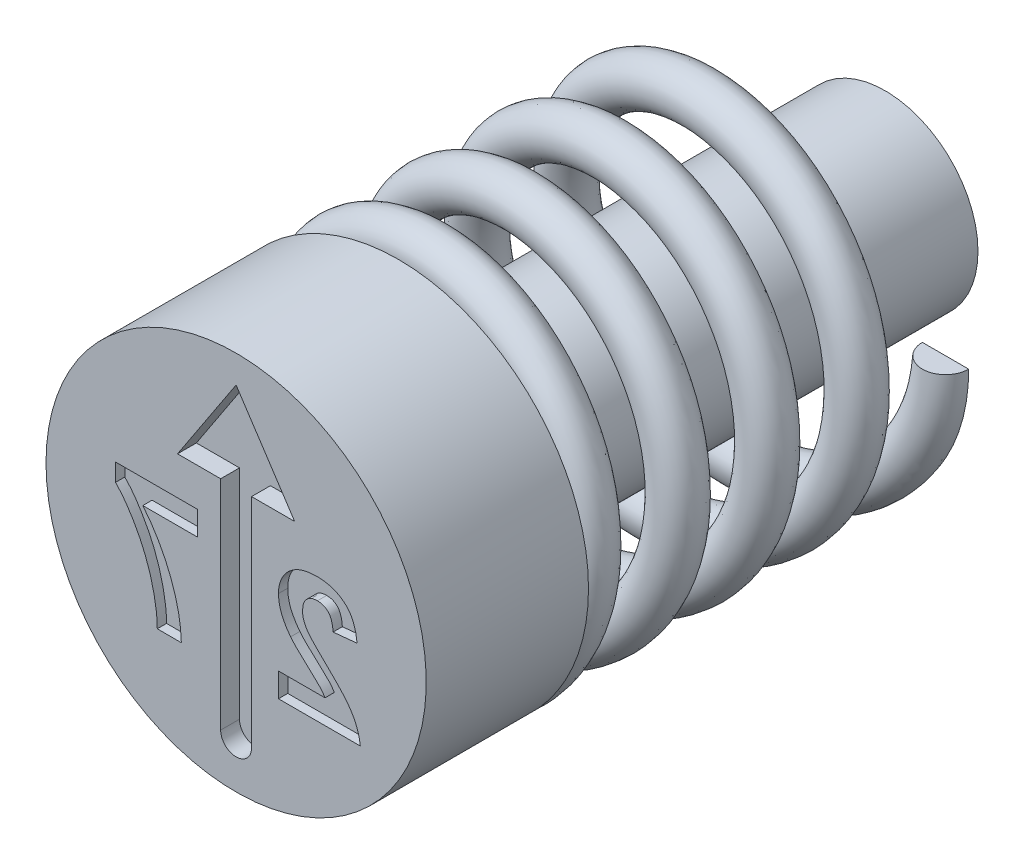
ISO-10303-21;
HEADER;
FILE_DESCRIPTION(('STEP AP214'),'2;1');
FILE_NAME('part.step','',(''),(''),'','','');
FILE_SCHEMA(('AUTOMOTIVE_DESIGN { 1 0 10303 214 1 1 1 1 }'));
ENDSEC;
DATA;
#1=APPLICATION_CONTEXT('core data for automotive mechanical design processes');
#2=APPLICATION_PROTOCOL_DEFINITION('international standard','automotive_design',2000,#1);
#3=PRODUCT_CONTEXT('',#1,'mechanical');
#4=PRODUCT('Part','Part','',(#3));
#5=PRODUCT_RELATED_PRODUCT_CATEGORY('part','',(#4));
#6=PRODUCT_DEFINITION_FORMATION('','',#4);
#7=PRODUCT_DEFINITION_CONTEXT('part definition',#1,'design');
#8=PRODUCT_DEFINITION('design','',#6,#7);
#9=PRODUCT_DEFINITION_SHAPE('','',#8);
#10=(LENGTH_UNIT() NAMED_UNIT(*) SI_UNIT(.MILLI.,.METRE.));
#11=(NAMED_UNIT(*) PLANE_ANGLE_UNIT() SI_UNIT($,.RADIAN.));
#12=(NAMED_UNIT(*) SI_UNIT($,.STERADIAN.) SOLID_ANGLE_UNIT());
#13=UNCERTAINTY_MEASURE_WITH_UNIT(LENGTH_MEASURE(1.E-05),#10,'distance_accuracy_value','');
#14=(GEOMETRIC_REPRESENTATION_CONTEXT(3) GLOBAL_UNCERTAINTY_ASSIGNED_CONTEXT((#13)) GLOBAL_UNIT_ASSIGNED_CONTEXT((#10,
#11,#12)) REPRESENTATION_CONTEXT('',''));
#15=CARTESIAN_POINT('',(0.,0.,0.));
#16=DIRECTION('',(0.,0.,1.));
#17=DIRECTION('',(1.,0.,0.));
#18=AXIS2_PLACEMENT_3D('',#15,#16,#17);
#19=CARTESIAN_POINT('',(3.6,0.,-12.2));
#20=DIRECTION('',(0.,-1.,0.));
#21=DIRECTION('',(0.,0.,-1.));
#22=AXIS2_PLACEMENT_3D('',#19,#20,#21);
#23=PLANE('',#22);
#24=CARTESIAN_POINT('',(3.6,0.,-11.7));
#25=DIRECTION('',(0.,1.,0.));
#26=DIRECTION('',(0.,0.,1.));
#27=AXIS2_PLACEMENT_3D('',#24,#25,#26);
#28=CIRCLE('',#27,0.5);
#29=CARTESIAN_POINT('',(3.1,0.,-11.7));
#30=VERTEX_POINT('',#29);
#31=CARTESIAN_POINT('',(4.1,0.,-11.7));
#32=VERTEX_POINT('',#31);
#33=EDGE_CURVE('E98',#30,#32,#28,.T.);
#34=ORIENTED_EDGE('',*,*,#33,.T.);
#35=DIRECTION('',(-1.,0.,0.));
#36=VECTOR('',#35,1.);
#37=CARTESIAN_POINT('',(3.6,0.,-11.7));
#38=LINE('',#37,#36);
#39=EDGE_CURVE('E78',#32,#30,#38,.T.);
#40=ORIENTED_EDGE('',*,*,#39,.T.);
#41=EDGE_LOOP('',(#34,#40));
#42=FACE_BOUND('',#41,.T.);
#43=ADVANCED_FACE('F51',(#42),#23,.F.);
#44=CARTESIAN_POINT('',(-2.78294577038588E-13,-3.6,-3.99999999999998));
#45=DIRECTION('',(-1.,0.,0.));
#46=DIRECTION('',(0.,-1.,0.));
#47=AXIS2_PLACEMENT_3D('',#44,#45,#46);
#48=PLANE('',#47);
#49=DIRECTION('',(0.,-1.,0.));
#50=VECTOR('',#49,1.);
#51=CARTESIAN_POINT('',(-2.78294577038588E-13,-3.6,-3.5));
#52=LINE('',#51,#50);
#53=CARTESIAN_POINT('',(-2.39645639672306E-13,-3.1,-3.5));
#54=VERTEX_POINT('',#53);
#55=CARTESIAN_POINT('',(-3.1694351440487E-13,-4.1,-3.5));
#56=VERTEX_POINT('',#55);
#57=EDGE_CURVE('E71',#54,#56,#52,.T.);
#58=ORIENTED_EDGE('',*,*,#57,.F.);
#59=CARTESIAN_POINT('',(-2.78294577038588E-13,-3.6,-3.49999999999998));
#60=DIRECTION('',(-1.,0.,0.));
#61=DIRECTION('',(0.,-1.,0.));
#62=AXIS2_PLACEMENT_3D('',#59,#60,#61);
#63=CIRCLE('',#62,0.500000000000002);
#64=EDGE_CURVE('E93',#54,#56,#63,.T.);
#65=ORIENTED_EDGE('',*,*,#64,.T.);
#66=EDGE_LOOP('',(#58,#65));
#67=FACE_BOUND('',#66,.T.);
#68=ADVANCED_FACE('F53',(#67),#48,.T.);
#69=CARTESIAN_POINT('',(3.6,0.,-11.2));
#70=CARTESIAN_POINT('',(3.6,-1.16971090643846,-11.1035294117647));
#71=CARTESIAN_POINT('',(2.91246117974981,-2.1160269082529,-11.0070588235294));
#72=CARTESIAN_POINT('',(2.22492235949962,-3.06234291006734,-10.9105882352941));
#73=CARTESIAN_POINT('',(1.11246117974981,-3.42380345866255,-10.8141176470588));
#74=CARTESIAN_POINT('',(0.,-3.78526400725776,-10.7176470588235));
#75=CARTESIAN_POINT('',(-1.11246117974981,-3.42380345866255,-10.6211764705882));
#76=CARTESIAN_POINT('',(-2.22492235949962,-3.06234291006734,-10.5247058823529));
#77=CARTESIAN_POINT('',(-2.91246117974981,-2.1160269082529,-10.4282352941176));
#78=CARTESIAN_POINT('',(-3.6,-1.16971090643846,-10.3317647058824));
#79=CARTESIAN_POINT('',(-3.6,0.,-10.2352941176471));
#80=CARTESIAN_POINT('',(-3.6,1.16971090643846,-10.1388235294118));
#81=CARTESIAN_POINT('',(-2.91246117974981,2.1160269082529,-10.0423529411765));
#82=CARTESIAN_POINT('',(-2.22492235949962,3.06234291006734,-9.94588235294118));
#83=CARTESIAN_POINT('',(-1.11246117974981,3.42380345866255,-9.84941176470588));
#84=CARTESIAN_POINT('',(0.,3.78526400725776,-9.75294117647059));
#85=CARTESIAN_POINT('',(1.11246117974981,3.42380345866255,-9.65647058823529));
#86=CARTESIAN_POINT('',(2.22492235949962,3.06234291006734,-9.56));
#87=CARTESIAN_POINT('',(2.91246117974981,2.1160269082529,-9.4635294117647));
#88=CARTESIAN_POINT('',(3.6,1.16971090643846,-9.36705882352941));
#89=CARTESIAN_POINT('',(3.6,0.,-9.27058823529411));
#90=CARTESIAN_POINT('',(3.6,-1.16971090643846,-9.17411764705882));
#91=CARTESIAN_POINT('',(2.91246117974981,-2.1160269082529,-9.07764705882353));
#92=CARTESIAN_POINT('',(2.22492235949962,-3.06234291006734,-8.98117647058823));
#93=CARTESIAN_POINT('',(1.11246117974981,-3.42380345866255,-8.88470588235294));
#94=CARTESIAN_POINT('',(0.,-3.78526400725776,-8.78823529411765));
#95=CARTESIAN_POINT('',(-1.11246117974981,-3.42380345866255,-8.69176470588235));
#96=CARTESIAN_POINT('',(-2.22492235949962,-3.06234291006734,-8.59529411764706));
#97=CARTESIAN_POINT('',(-2.91246117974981,-2.1160269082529,-8.49882352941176));
#98=CARTESIAN_POINT('',(-3.6,-1.16971090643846,-8.40235294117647));
#99=CARTESIAN_POINT('',(-3.6,0.,-8.30588235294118));
#100=CARTESIAN_POINT('',(-3.6,1.16971090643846,-8.20941176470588));
#101=CARTESIAN_POINT('',(-2.91246117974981,2.1160269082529,-8.11294117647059));
#102=CARTESIAN_POINT('',(-2.22492235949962,3.06234291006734,-8.01647058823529));
#103=CARTESIAN_POINT('',(-1.11246117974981,3.42380345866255,-7.92));
#104=CARTESIAN_POINT('',(0.,3.78526400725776,-7.8235294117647));
#105=CARTESIAN_POINT('',(1.11246117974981,3.42380345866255,-7.72705882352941));
#106=CARTESIAN_POINT('',(2.22492235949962,3.06234291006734,-7.63058823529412));
#107=CARTESIAN_POINT('',(2.91246117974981,2.1160269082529,-7.53411764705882));
#108=CARTESIAN_POINT('',(3.6,1.16971090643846,-7.43764705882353));
#109=CARTESIAN_POINT('',(3.6,0.,-7.34117647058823));
#110=CARTESIAN_POINT('',(3.6,-1.16971090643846,-7.24470588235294));
#111=CARTESIAN_POINT('',(2.91246117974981,-2.1160269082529,-7.14823529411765));
#112=CARTESIAN_POINT('',(2.22492235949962,-3.06234291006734,-7.05176470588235));
#113=CARTESIAN_POINT('',(1.11246117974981,-3.42380345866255,-6.95529411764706));
#114=CARTESIAN_POINT('',(0.,-3.78526400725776,-6.85882352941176));
#115=CARTESIAN_POINT('',(-1.11246117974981,-3.42380345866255,-6.76235294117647));
#116=CARTESIAN_POINT('',(-2.22492235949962,-3.06234291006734,-6.66588235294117));
#117=CARTESIAN_POINT('',(-2.91246117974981,-2.1160269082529,-6.56941176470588));
#118=CARTESIAN_POINT('',(-3.6,-1.16971090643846,-6.47294117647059));
#119=CARTESIAN_POINT('',(-3.6,0.,-6.37647058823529));
#120=CARTESIAN_POINT('',(-3.6,1.16971090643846,-6.28));
#121=CARTESIAN_POINT('',(-2.91246117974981,2.1160269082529,-6.1835294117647));
#122=CARTESIAN_POINT('',(-2.22492235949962,3.06234291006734,-6.08705882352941));
#123=CARTESIAN_POINT('',(-1.11246117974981,3.42380345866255,-5.99058823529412));
#124=CARTESIAN_POINT('',(0.,3.78526400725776,-5.89411764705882));
#125=CARTESIAN_POINT('',(1.11246117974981,3.42380345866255,-5.79764705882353));
#126=CARTESIAN_POINT('',(2.22492235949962,3.06234291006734,-5.70117647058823));
#127=CARTESIAN_POINT('',(2.91246117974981,2.1160269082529,-5.60470588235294));
#128=CARTESIAN_POINT('',(3.6,1.16971090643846,-5.50823529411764));
#129=CARTESIAN_POINT('',(3.6,0.,-5.41176470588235));
#130=CARTESIAN_POINT('',(3.6,-1.16971090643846,-5.31529411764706));
#131=CARTESIAN_POINT('',(2.91246117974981,-2.1160269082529,-5.21882352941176));
#132=CARTESIAN_POINT('',(2.22492235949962,-3.06234291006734,-5.12235294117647));
#133=CARTESIAN_POINT('',(1.11246117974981,-3.42380345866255,-5.02588235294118));
#134=CARTESIAN_POINT('',(0.,-3.78526400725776,-4.92941176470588));
#135=CARTESIAN_POINT('',(-1.11246117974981,-3.42380345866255,-4.83294117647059));
#136=CARTESIAN_POINT('',(-2.22492235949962,-3.06234291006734,-4.73647058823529));
#137=CARTESIAN_POINT('',(-2.91246117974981,-2.1160269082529,-4.64));
#138=CARTESIAN_POINT('',(-3.6,-1.16971090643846,-4.54352941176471));
#139=CARTESIAN_POINT('',(-3.6,0.,-4.44705882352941));
#140=CARTESIAN_POINT('',(-3.6,1.16971090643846,-4.35058823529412));
#141=CARTESIAN_POINT('',(-2.91246117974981,2.1160269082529,-4.25411764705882));
#142=CARTESIAN_POINT('',(-2.22492235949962,3.06234291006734,-4.15764705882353));
#143=CARTESIAN_POINT('',(-1.11246117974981,3.42380345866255,-4.06117647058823));
#144=CARTESIAN_POINT('',(0.,3.78526400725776,-3.96470588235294));
#145=CARTESIAN_POINT('',(1.11246117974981,3.42380345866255,-3.86823529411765));
#146=CARTESIAN_POINT('',(2.22492235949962,3.06234291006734,-3.77176470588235));
#147=CARTESIAN_POINT('',(2.91246117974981,2.1160269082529,-3.67529411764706));
#148=CARTESIAN_POINT('',(3.6,1.16971090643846,-3.57882352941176));
#149=CARTESIAN_POINT('',(3.6,0.,-3.48235294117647));
#150=CARTESIAN_POINT('',(3.6,-1.16971090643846,-3.38588235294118));
#151=CARTESIAN_POINT('',(2.91246117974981,-2.1160269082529,-3.28941176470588));
#152=CARTESIAN_POINT('',(2.22492235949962,-3.06234291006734,-3.19294117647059));
#153=CARTESIAN_POINT('',(1.11246117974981,-3.42380345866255,-3.09647058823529));
#154=CARTESIAN_POINT('',(0.570183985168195,-3.60000000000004,-3.049445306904));
#155=CARTESIAN_POINT('',(-2.78294577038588E-13,-3.6,-2.99999999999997));
#156=CARTESIAN_POINT('',(4.6,0.,-11.2));
#157=CARTESIAN_POINT('',(4.6,-1.49463060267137,-11.1035294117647));
#158=CARTESIAN_POINT('',(3.72147817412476,-2.70381216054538,-11.0070588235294));
#159=CARTESIAN_POINT('',(2.84295634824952,-3.91299371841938,-10.9105882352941));
#160=CARTESIAN_POINT('',(1.42147817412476,-4.37485997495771,-10.8141176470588));
#161=CARTESIAN_POINT('',(0.,-4.83672623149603,-10.7176470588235));
#162=CARTESIAN_POINT('',(-1.42147817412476,-4.37485997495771,-10.6211764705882));
#163=CARTESIAN_POINT('',(-2.84295634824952,-3.91299371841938,-10.5247058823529));
#164=CARTESIAN_POINT('',(-3.72147817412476,-2.70381216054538,-10.4282352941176));
#165=CARTESIAN_POINT('',(-4.6,-1.49463060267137,-10.3317647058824));
#166=CARTESIAN_POINT('',(-4.6,0.,-10.2352941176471));
#167=CARTESIAN_POINT('',(-4.6,1.49463060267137,-10.1388235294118));
#168=CARTESIAN_POINT('',(-3.72147817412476,2.70381216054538,-10.0423529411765));
#169=CARTESIAN_POINT('',(-2.84295634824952,3.91299371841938,-9.94588235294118));
#170=CARTESIAN_POINT('',(-1.42147817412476,4.37485997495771,-9.84941176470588));
#171=CARTESIAN_POINT('',(0.,4.83672623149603,-9.75294117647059));
#172=CARTESIAN_POINT('',(1.42147817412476,4.37485997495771,-9.65647058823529));
#173=CARTESIAN_POINT('',(2.84295634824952,3.91299371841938,-9.56));
#174=CARTESIAN_POINT('',(3.72147817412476,2.70381216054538,-9.4635294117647));
#175=CARTESIAN_POINT('',(4.6,1.49463060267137,-9.36705882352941));
#176=CARTESIAN_POINT('',(4.6,0.,-9.27058823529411));
#177=CARTESIAN_POINT('',(4.6,-1.49463060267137,-9.17411764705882));
#178=CARTESIAN_POINT('',(3.72147817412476,-2.70381216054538,-9.07764705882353));
#179=CARTESIAN_POINT('',(2.84295634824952,-3.91299371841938,-8.98117647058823));
#180=CARTESIAN_POINT('',(1.42147817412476,-4.37485997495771,-8.88470588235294));
#181=CARTESIAN_POINT('',(0.,-4.83672623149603,-8.78823529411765));
#182=CARTESIAN_POINT('',(-1.42147817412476,-4.37485997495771,-8.69176470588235));
#183=CARTESIAN_POINT('',(-2.84295634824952,-3.91299371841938,-8.59529411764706));
#184=CARTESIAN_POINT('',(-3.72147817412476,-2.70381216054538,-8.49882352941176));
#185=CARTESIAN_POINT('',(-4.6,-1.49463060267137,-8.40235294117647));
#186=CARTESIAN_POINT('',(-4.6,0.,-8.30588235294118));
#187=CARTESIAN_POINT('',(-4.6,1.49463060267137,-8.20941176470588));
#188=CARTESIAN_POINT('',(-3.72147817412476,2.70381216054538,-8.11294117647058));
#189=CARTESIAN_POINT('',(-2.84295634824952,3.91299371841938,-8.01647058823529));
#190=CARTESIAN_POINT('',(-1.42147817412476,4.37485997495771,-7.92));
#191=CARTESIAN_POINT('',(0.,4.83672623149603,-7.8235294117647));
#192=CARTESIAN_POINT('',(1.42147817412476,4.37485997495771,-7.72705882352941));
#193=CARTESIAN_POINT('',(2.84295634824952,3.91299371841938,-7.63058823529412));
#194=CARTESIAN_POINT('',(3.72147817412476,2.70381216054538,-7.53411764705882));
#195=CARTESIAN_POINT('',(4.6,1.49463060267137,-7.43764705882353));
#196=CARTESIAN_POINT('',(4.6,0.,-7.34117647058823));
#197=CARTESIAN_POINT('',(4.6,-1.49463060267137,-7.24470588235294));
#198=CARTESIAN_POINT('',(3.72147817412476,-2.70381216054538,-7.14823529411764));
#199=CARTESIAN_POINT('',(2.84295634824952,-3.91299371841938,-7.05176470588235));
#200=CARTESIAN_POINT('',(1.42147817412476,-4.37485997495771,-6.95529411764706));
#201=CARTESIAN_POINT('',(0.,-4.83672623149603,-6.85882352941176));
#202=CARTESIAN_POINT('',(-1.42147817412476,-4.37485997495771,-6.76235294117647));
#203=CARTESIAN_POINT('',(-2.84295634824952,-3.91299371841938,-6.66588235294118));
#204=CARTESIAN_POINT('',(-3.72147817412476,-2.70381216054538,-6.56941176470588));
#205=CARTESIAN_POINT('',(-4.6,-1.49463060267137,-6.47294117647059));
#206=CARTESIAN_POINT('',(-4.6,0.,-6.37647058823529));
#207=CARTESIAN_POINT('',(-4.6,1.49463060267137,-6.28));
#208=CARTESIAN_POINT('',(-3.72147817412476,2.70381216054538,-6.1835294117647));
#209=CARTESIAN_POINT('',(-2.84295634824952,3.91299371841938,-6.08705882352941));
#210=CARTESIAN_POINT('',(-1.42147817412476,4.37485997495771,-5.99058823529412));
#211=CARTESIAN_POINT('',(0.,4.83672623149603,-5.89411764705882));
#212=CARTESIAN_POINT('',(1.42147817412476,4.37485997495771,-5.79764705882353));
#213=CARTESIAN_POINT('',(2.84295634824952,3.91299371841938,-5.70117647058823));
#214=CARTESIAN_POINT('',(3.72147817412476,2.70381216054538,-5.60470588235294));
#215=CARTESIAN_POINT('',(4.6,1.49463060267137,-5.50823529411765));
#216=CARTESIAN_POINT('',(4.6,0.,-5.41176470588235));
#217=CARTESIAN_POINT('',(4.6,-1.49463060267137,-5.31529411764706));
#218=CARTESIAN_POINT('',(3.72147817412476,-2.70381216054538,-5.21882352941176));
#219=CARTESIAN_POINT('',(2.84295634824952,-3.91299371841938,-5.12235294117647));
#220=CARTESIAN_POINT('',(1.42147817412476,-4.37485997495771,-5.02588235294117));
#221=CARTESIAN_POINT('',(0.,-4.83672623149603,-4.92941176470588));
#222=CARTESIAN_POINT('',(-1.42147817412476,-4.37485997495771,-4.83294117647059));
#223=CARTESIAN_POINT('',(-2.84295634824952,-3.91299371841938,-4.73647058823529));
#224=CARTESIAN_POINT('',(-3.72147817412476,-2.70381216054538,-4.64));
#225=CARTESIAN_POINT('',(-4.6,-1.49463060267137,-4.54352941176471));
#226=CARTESIAN_POINT('',(-4.6,0.,-4.44705882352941));
#227=CARTESIAN_POINT('',(-4.6,1.49463060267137,-4.35058823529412));
#228=CARTESIAN_POINT('',(-3.72147817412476,2.70381216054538,-4.25411764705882));
#229=CARTESIAN_POINT('',(-2.84295634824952,3.91299371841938,-4.15764705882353));
#230=CARTESIAN_POINT('',(-1.42147817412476,4.37485997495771,-4.06117647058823));
#231=CARTESIAN_POINT('',(0.,4.83672623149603,-3.96470588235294));
#232=CARTESIAN_POINT('',(1.42147817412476,4.37485997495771,-3.86823529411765));
#233=CARTESIAN_POINT('',(2.84295634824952,3.91299371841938,-3.77176470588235));
#234=CARTESIAN_POINT('',(3.72147817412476,2.70381216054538,-3.67529411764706));
#235=CARTESIAN_POINT('',(4.6,1.49463060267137,-3.57882352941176));
#236=CARTESIAN_POINT('',(4.6,0.,-3.48235294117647));
#237=CARTESIAN_POINT('',(4.6,-1.49463060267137,-3.38588235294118));
#238=CARTESIAN_POINT('',(3.72147817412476,-2.70381216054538,-3.28941176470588));
#239=CARTESIAN_POINT('',(2.84295634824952,-3.91299371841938,-3.19294117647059));
#240=CARTESIAN_POINT('',(1.42147817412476,-4.37485997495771,-3.09647058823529));
#241=CARTESIAN_POINT('',(0.728568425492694,-4.60000000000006,-3.049445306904));
#242=CARTESIAN_POINT('',(-3.55592451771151E-13,-4.6,-2.99999999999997));
#243=CARTESIAN_POINT('',(4.6,0.,-12.2));
#244=CARTESIAN_POINT('',(4.6,-1.49463060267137,-12.1035294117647));
#245=CARTESIAN_POINT('',(3.72147817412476,-2.70381216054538,-12.0070588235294));
#246=CARTESIAN_POINT('',(2.84295634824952,-3.91299371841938,-11.9105882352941));
#247=CARTESIAN_POINT('',(1.42147817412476,-4.37485997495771,-11.8141176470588));
#248=CARTESIAN_POINT('',(0.,-4.83672623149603,-11.7176470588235));
#249=CARTESIAN_POINT('',(-1.42147817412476,-4.37485997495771,-11.6211764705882));
#250=CARTESIAN_POINT('',(-2.84295634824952,-3.91299371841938,-11.5247058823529));
#251=CARTESIAN_POINT('',(-3.72147817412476,-2.70381216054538,-11.4282352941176));
#252=CARTESIAN_POINT('',(-4.6,-1.49463060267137,-11.3317647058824));
#253=CARTESIAN_POINT('',(-4.6,0.,-11.2352941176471));
#254=CARTESIAN_POINT('',(-4.6,1.49463060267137,-11.1388235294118));
#255=CARTESIAN_POINT('',(-3.72147817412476,2.70381216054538,-11.0423529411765));
#256=CARTESIAN_POINT('',(-2.84295634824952,3.91299371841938,-10.9458823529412));
#257=CARTESIAN_POINT('',(-1.42147817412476,4.37485997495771,-10.8494117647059));
#258=CARTESIAN_POINT('',(0.,4.83672623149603,-10.7529411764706));
#259=CARTESIAN_POINT('',(1.42147817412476,4.37485997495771,-10.6564705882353));
#260=CARTESIAN_POINT('',(2.84295634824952,3.91299371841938,-10.56));
#261=CARTESIAN_POINT('',(3.72147817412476,2.70381216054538,-10.4635294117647));
#262=CARTESIAN_POINT('',(4.6,1.49463060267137,-10.3670588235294));
#263=CARTESIAN_POINT('',(4.6,0.,-10.2705882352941));
#264=CARTESIAN_POINT('',(4.6,-1.49463060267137,-10.1741176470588));
#265=CARTESIAN_POINT('',(3.72147817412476,-2.70381216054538,-10.0776470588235));
#266=CARTESIAN_POINT('',(2.84295634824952,-3.91299371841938,-9.98117647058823));
#267=CARTESIAN_POINT('',(1.42147817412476,-4.37485997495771,-9.88470588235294));
#268=CARTESIAN_POINT('',(0.,-4.83672623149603,-9.78823529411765));
#269=CARTESIAN_POINT('',(-1.42147817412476,-4.37485997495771,-9.69176470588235));
#270=CARTESIAN_POINT('',(-2.84295634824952,-3.91299371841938,-9.59529411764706));
#271=CARTESIAN_POINT('',(-3.72147817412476,-2.70381216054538,-9.49882352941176));
#272=CARTESIAN_POINT('',(-4.6,-1.49463060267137,-9.40235294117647));
#273=CARTESIAN_POINT('',(-4.6,0.,-9.30588235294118));
#274=CARTESIAN_POINT('',(-4.6,1.49463060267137,-9.20941176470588));
#275=CARTESIAN_POINT('',(-3.72147817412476,2.70381216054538,-9.11294117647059));
#276=CARTESIAN_POINT('',(-2.84295634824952,3.91299371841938,-9.01647058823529));
#277=CARTESIAN_POINT('',(-1.42147817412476,4.37485997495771,-8.92));
#278=CARTESIAN_POINT('',(0.,4.83672623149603,-8.82352941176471));
#279=CARTESIAN_POINT('',(1.42147817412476,4.37485997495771,-8.72705882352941));
#280=CARTESIAN_POINT('',(2.84295634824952,3.91299371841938,-8.63058823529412));
#281=CARTESIAN_POINT('',(3.72147817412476,2.70381216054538,-8.53411764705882));
#282=CARTESIAN_POINT('',(4.6,1.49463060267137,-8.43764705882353));
#283=CARTESIAN_POINT('',(4.6,0.,-8.34117647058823));
#284=CARTESIAN_POINT('',(4.6,-1.49463060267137,-8.24470588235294));
#285=CARTESIAN_POINT('',(3.72147817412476,-2.70381216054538,-8.14823529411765));
#286=CARTESIAN_POINT('',(2.84295634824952,-3.91299371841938,-8.05176470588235));
#287=CARTESIAN_POINT('',(1.42147817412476,-4.37485997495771,-7.95529411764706));
#288=CARTESIAN_POINT('',(0.,-4.83672623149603,-7.85882352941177));
#289=CARTESIAN_POINT('',(-1.42147817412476,-4.37485997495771,-7.76235294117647));
#290=CARTESIAN_POINT('',(-2.84295634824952,-3.91299371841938,-7.66588235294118));
#291=CARTESIAN_POINT('',(-3.72147817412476,-2.70381216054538,-7.56941176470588));
#292=CARTESIAN_POINT('',(-4.6,-1.49463060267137,-7.47294117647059));
#293=CARTESIAN_POINT('',(-4.6,0.,-7.37647058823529));
#294=CARTESIAN_POINT('',(-4.6,1.49463060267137,-7.28));
#295=CARTESIAN_POINT('',(-3.72147817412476,2.70381216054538,-7.18352941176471));
#296=CARTESIAN_POINT('',(-2.84295634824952,3.91299371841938,-7.08705882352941));
#297=CARTESIAN_POINT('',(-1.42147817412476,4.37485997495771,-6.99058823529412));
#298=CARTESIAN_POINT('',(0.,4.83672623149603,-6.89411764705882));
#299=CARTESIAN_POINT('',(1.42147817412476,4.37485997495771,-6.79764705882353));
#300=CARTESIAN_POINT('',(2.84295634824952,3.91299371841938,-6.70117647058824));
#301=CARTESIAN_POINT('',(3.72147817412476,2.70381216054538,-6.60470588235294));
#302=CARTESIAN_POINT('',(4.6,1.49463060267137,-6.50823529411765));
#303=CARTESIAN_POINT('',(4.6,0.,-6.41176470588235));
#304=CARTESIAN_POINT('',(4.6,-1.49463060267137,-6.31529411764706));
#305=CARTESIAN_POINT('',(3.72147817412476,-2.70381216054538,-6.21882352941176));
#306=CARTESIAN_POINT('',(2.84295634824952,-3.91299371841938,-6.12235294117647));
#307=CARTESIAN_POINT('',(1.42147817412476,-4.37485997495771,-6.02588235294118));
#308=CARTESIAN_POINT('',(0.,-4.83672623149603,-5.92941176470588));
#309=CARTESIAN_POINT('',(-1.42147817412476,-4.37485997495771,-5.83294117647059));
#310=CARTESIAN_POINT('',(-2.84295634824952,-3.91299371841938,-5.73647058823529));
#311=CARTESIAN_POINT('',(-3.72147817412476,-2.70381216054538,-5.64));
#312=CARTESIAN_POINT('',(-4.6,-1.49463060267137,-5.54352941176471));
#313=CARTESIAN_POINT('',(-4.6,0.,-5.44705882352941));
#314=CARTESIAN_POINT('',(-4.6,1.49463060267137,-5.35058823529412));
#315=CARTESIAN_POINT('',(-3.72147817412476,2.70381216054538,-5.25411764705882));
#316=CARTESIAN_POINT('',(-2.84295634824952,3.91299371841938,-5.15764705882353));
#317=CARTESIAN_POINT('',(-1.42147817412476,4.37485997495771,-5.06117647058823));
#318=CARTESIAN_POINT('',(0.,4.83672623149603,-4.96470588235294));
#319=CARTESIAN_POINT('',(1.42147817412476,4.37485997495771,-4.86823529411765));
#320=CARTESIAN_POINT('',(2.84295634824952,3.91299371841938,-4.77176470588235));
#321=CARTESIAN_POINT('',(3.72147817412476,2.70381216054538,-4.67529411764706));
#322=CARTESIAN_POINT('',(4.6,1.49463060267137,-4.57882352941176));
#323=CARTESIAN_POINT('',(4.6,0.,-4.48235294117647));
#324=CARTESIAN_POINT('',(4.6,-1.49463060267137,-4.38588235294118));
#325=CARTESIAN_POINT('',(3.72147817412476,-2.70381216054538,-4.28941176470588));
#326=CARTESIAN_POINT('',(2.84295634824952,-3.91299371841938,-4.19294117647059));
#327=CARTESIAN_POINT('',(1.42147817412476,-4.37485997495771,-4.09647058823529));
#328=CARTESIAN_POINT('',(0.728568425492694,-4.60000000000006,-4.049445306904));
#329=CARTESIAN_POINT('',(-3.55592451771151E-13,-4.6,-3.99999999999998));
#330=CARTESIAN_POINT('',(3.6,0.,-12.2));
#331=CARTESIAN_POINT('',(3.6,-1.16971090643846,-12.1035294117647));
#332=CARTESIAN_POINT('',(2.91246117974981,-2.1160269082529,-12.0070588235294));
#333=CARTESIAN_POINT('',(2.22492235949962,-3.06234291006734,-11.9105882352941));
#334=CARTESIAN_POINT('',(1.11246117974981,-3.42380345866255,-11.8141176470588));
#335=CARTESIAN_POINT('',(0.,-3.78526400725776,-11.7176470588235));
#336=CARTESIAN_POINT('',(-1.11246117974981,-3.42380345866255,-11.6211764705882));
#337=CARTESIAN_POINT('',(-2.22492235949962,-3.06234291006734,-11.5247058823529));
#338=CARTESIAN_POINT('',(-2.91246117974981,-2.1160269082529,-11.4282352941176));
#339=CARTESIAN_POINT('',(-3.6,-1.16971090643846,-11.3317647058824));
#340=CARTESIAN_POINT('',(-3.6,0.,-11.2352941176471));
#341=CARTESIAN_POINT('',(-3.6,1.16971090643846,-11.1388235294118));
#342=CARTESIAN_POINT('',(-2.91246117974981,2.1160269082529,-11.0423529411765));
#343=CARTESIAN_POINT('',(-2.22492235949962,3.06234291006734,-10.9458823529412));
#344=CARTESIAN_POINT('',(-1.11246117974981,3.42380345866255,-10.8494117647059));
#345=CARTESIAN_POINT('',(0.,3.78526400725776,-10.7529411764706));
#346=CARTESIAN_POINT('',(1.11246117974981,3.42380345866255,-10.6564705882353));
#347=CARTESIAN_POINT('',(2.22492235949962,3.06234291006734,-10.56));
#348=CARTESIAN_POINT('',(2.91246117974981,2.1160269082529,-10.4635294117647));
#349=CARTESIAN_POINT('',(3.6,1.16971090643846,-10.3670588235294));
#350=CARTESIAN_POINT('',(3.6,0.,-10.2705882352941));
#351=CARTESIAN_POINT('',(3.6,-1.16971090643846,-10.1741176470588));
#352=CARTESIAN_POINT('',(2.91246117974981,-2.1160269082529,-10.0776470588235));
#353=CARTESIAN_POINT('',(2.22492235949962,-3.06234291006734,-9.98117647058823));
#354=CARTESIAN_POINT('',(1.11246117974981,-3.42380345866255,-9.88470588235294));
#355=CARTESIAN_POINT('',(0.,-3.78526400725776,-9.78823529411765));
#356=CARTESIAN_POINT('',(-1.11246117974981,-3.42380345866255,-9.69176470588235));
#357=CARTESIAN_POINT('',(-2.22492235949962,-3.06234291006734,-9.59529411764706));
#358=CARTESIAN_POINT('',(-2.91246117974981,-2.1160269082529,-9.49882352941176));
#359=CARTESIAN_POINT('',(-3.6,-1.16971090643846,-9.40235294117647));
#360=CARTESIAN_POINT('',(-3.6,0.,-9.30588235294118));
#361=CARTESIAN_POINT('',(-3.6,1.16971090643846,-9.20941176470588));
#362=CARTESIAN_POINT('',(-2.91246117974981,2.1160269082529,-9.11294117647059));
#363=CARTESIAN_POINT('',(-2.22492235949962,3.06234291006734,-9.01647058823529));
#364=CARTESIAN_POINT('',(-1.11246117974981,3.42380345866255,-8.92));
#365=CARTESIAN_POINT('',(0.,3.78526400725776,-8.82352941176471));
#366=CARTESIAN_POINT('',(1.11246117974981,3.42380345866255,-8.72705882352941));
#367=CARTESIAN_POINT('',(2.22492235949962,3.06234291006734,-8.63058823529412));
#368=CARTESIAN_POINT('',(2.91246117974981,2.1160269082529,-8.53411764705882));
#369=CARTESIAN_POINT('',(3.6,1.16971090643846,-8.43764705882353));
#370=CARTESIAN_POINT('',(3.6,0.,-8.34117647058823));
#371=CARTESIAN_POINT('',(3.6,-1.16971090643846,-8.24470588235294));
#372=CARTESIAN_POINT('',(2.91246117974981,-2.1160269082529,-8.14823529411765));
#373=CARTESIAN_POINT('',(2.22492235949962,-3.06234291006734,-8.05176470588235));
#374=CARTESIAN_POINT('',(1.11246117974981,-3.42380345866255,-7.95529411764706));
#375=CARTESIAN_POINT('',(0.,-3.78526400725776,-7.85882352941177));
#376=CARTESIAN_POINT('',(-1.11246117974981,-3.42380345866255,-7.76235294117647));
#377=CARTESIAN_POINT('',(-2.22492235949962,-3.06234291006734,-7.66588235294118));
#378=CARTESIAN_POINT('',(-2.91246117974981,-2.1160269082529,-7.56941176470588));
#379=CARTESIAN_POINT('',(-3.6,-1.16971090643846,-7.47294117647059));
#380=CARTESIAN_POINT('',(-3.6,0.,-7.37647058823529));
#381=CARTESIAN_POINT('',(-3.6,1.16971090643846,-7.28));
#382=CARTESIAN_POINT('',(-2.91246117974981,2.1160269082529,-7.18352941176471));
#383=CARTESIAN_POINT('',(-2.22492235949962,3.06234291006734,-7.08705882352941));
#384=CARTESIAN_POINT('',(-1.11246117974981,3.42380345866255,-6.99058823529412));
#385=CARTESIAN_POINT('',(0.,3.78526400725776,-6.89411764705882));
#386=CARTESIAN_POINT('',(1.11246117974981,3.42380345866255,-6.79764705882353));
#387=CARTESIAN_POINT('',(2.22492235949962,3.06234291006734,-6.70117647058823));
#388=CARTESIAN_POINT('',(2.91246117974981,2.1160269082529,-6.60470588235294));
#389=CARTESIAN_POINT('',(3.6,1.16971090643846,-6.50823529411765));
#390=CARTESIAN_POINT('',(3.6,0.,-6.41176470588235));
#391=CARTESIAN_POINT('',(3.6,-1.16971090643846,-6.31529411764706));
#392=CARTESIAN_POINT('',(2.91246117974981,-2.1160269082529,-6.21882352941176));
#393=CARTESIAN_POINT('',(2.22492235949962,-3.06234291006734,-6.12235294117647));
#394=CARTESIAN_POINT('',(1.11246117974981,-3.42380345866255,-6.02588235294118));
#395=CARTESIAN_POINT('',(0.,-3.78526400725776,-5.92941176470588));
#396=CARTESIAN_POINT('',(-1.11246117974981,-3.42380345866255,-5.83294117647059));
#397=CARTESIAN_POINT('',(-2.22492235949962,-3.06234291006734,-5.73647058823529));
#398=CARTESIAN_POINT('',(-2.91246117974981,-2.1160269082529,-5.64));
#399=CARTESIAN_POINT('',(-3.6,-1.16971090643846,-5.54352941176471));
#400=CARTESIAN_POINT('',(-3.6,0.,-5.44705882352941));
#401=CARTESIAN_POINT('',(-3.6,1.16971090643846,-5.35058823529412));
#402=CARTESIAN_POINT('',(-2.91246117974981,2.1160269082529,-5.25411764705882));
#403=CARTESIAN_POINT('',(-2.22492235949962,3.06234291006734,-5.15764705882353));
#404=CARTESIAN_POINT('',(-1.11246117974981,3.42380345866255,-5.06117647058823));
#405=CARTESIAN_POINT('',(0.,3.78526400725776,-4.96470588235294));
#406=CARTESIAN_POINT('',(1.11246117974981,3.42380345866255,-4.86823529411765));
#407=CARTESIAN_POINT('',(2.22492235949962,3.06234291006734,-4.77176470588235));
#408=CARTESIAN_POINT('',(2.91246117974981,2.1160269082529,-4.67529411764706));
#409=CARTESIAN_POINT('',(3.6,1.16971090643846,-4.57882352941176));
#410=CARTESIAN_POINT('',(3.6,0.,-4.48235294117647));
#411=CARTESIAN_POINT('',(3.6,-1.16971090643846,-4.38588235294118));
#412=CARTESIAN_POINT('',(2.91246117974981,-2.1160269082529,-4.28941176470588));
#413=CARTESIAN_POINT('',(2.22492235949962,-3.06234291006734,-4.19294117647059));
#414=CARTESIAN_POINT('',(1.11246117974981,-3.42380345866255,-4.09647058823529));
#415=CARTESIAN_POINT('',(0.570183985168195,-3.60000000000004,-4.049445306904));
#416=CARTESIAN_POINT('',(-2.78294577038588E-13,-3.6,-3.99999999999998));
#417=CARTESIAN_POINT('',(2.6,0.,-12.2));
#418=CARTESIAN_POINT('',(2.6,-0.844791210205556,-12.1035294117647));
#419=CARTESIAN_POINT('',(2.10344418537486,-1.52824165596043,-12.0070588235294));
#420=CARTESIAN_POINT('',(1.60688837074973,-2.2116921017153,-11.9105882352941));
#421=CARTESIAN_POINT('',(0.803444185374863,-2.4727469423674,-11.8141176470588));
#422=CARTESIAN_POINT('',(0.,-2.73380178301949,-11.7176470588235));
#423=CARTESIAN_POINT('',(-0.803444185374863,-2.4727469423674,-11.6211764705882));
#424=CARTESIAN_POINT('',(-1.60688837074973,-2.2116921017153,-11.5247058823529));
#425=CARTESIAN_POINT('',(-2.10344418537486,-1.52824165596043,-11.4282352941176));
#426=CARTESIAN_POINT('',(-2.6,-0.844791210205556,-11.3317647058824));
#427=CARTESIAN_POINT('',(-2.6,0.,-11.2352941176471));
#428=CARTESIAN_POINT('',(-2.6,0.844791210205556,-11.1388235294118));
#429=CARTESIAN_POINT('',(-2.10344418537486,1.52824165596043,-11.0423529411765));
#430=CARTESIAN_POINT('',(-1.60688837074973,2.2116921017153,-10.9458823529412));
#431=CARTESIAN_POINT('',(-0.803444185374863,2.4727469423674,-10.8494117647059));
#432=CARTESIAN_POINT('',(0.,2.73380178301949,-10.7529411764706));
#433=CARTESIAN_POINT('',(0.803444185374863,2.4727469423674,-10.6564705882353));
#434=CARTESIAN_POINT('',(1.60688837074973,2.2116921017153,-10.56));
#435=CARTESIAN_POINT('',(2.10344418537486,1.52824165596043,-10.4635294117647));
#436=CARTESIAN_POINT('',(2.6,0.844791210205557,-10.3670588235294));
#437=CARTESIAN_POINT('',(2.6,0.,-10.2705882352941));
#438=CARTESIAN_POINT('',(2.6,-0.844791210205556,-10.1741176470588));
#439=CARTESIAN_POINT('',(2.10344418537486,-1.52824165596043,-10.0776470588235));
#440=CARTESIAN_POINT('',(1.60688837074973,-2.2116921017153,-9.98117647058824));
#441=CARTESIAN_POINT('',(0.803444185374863,-2.4727469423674,-9.88470588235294));
#442=CARTESIAN_POINT('',(0.,-2.73380178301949,-9.78823529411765));
#443=CARTESIAN_POINT('',(-0.803444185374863,-2.4727469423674,-9.69176470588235));
#444=CARTESIAN_POINT('',(-1.60688837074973,-2.2116921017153,-9.59529411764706));
#445=CARTESIAN_POINT('',(-2.10344418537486,-1.52824165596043,-9.49882352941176));
#446=CARTESIAN_POINT('',(-2.6,-0.844791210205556,-9.40235294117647));
#447=CARTESIAN_POINT('',(-2.6,0.,-9.30588235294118));
#448=CARTESIAN_POINT('',(-2.6,0.844791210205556,-9.20941176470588));
#449=CARTESIAN_POINT('',(-2.10344418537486,1.52824165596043,-9.11294117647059));
#450=CARTESIAN_POINT('',(-1.60688837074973,2.2116921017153,-9.01647058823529));
#451=CARTESIAN_POINT('',(-0.803444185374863,2.4727469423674,-8.92));
#452=CARTESIAN_POINT('',(0.,2.73380178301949,-8.82352941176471));
#453=CARTESIAN_POINT('',(0.803444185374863,2.4727469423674,-8.72705882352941));
#454=CARTESIAN_POINT('',(1.60688837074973,2.2116921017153,-8.63058823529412));
#455=CARTESIAN_POINT('',(2.10344418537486,1.52824165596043,-8.53411764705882));
#456=CARTESIAN_POINT('',(2.6,0.844791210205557,-8.43764705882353));
#457=CARTESIAN_POINT('',(2.6,0.,-8.34117647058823));
#458=CARTESIAN_POINT('',(2.6,-0.844791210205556,-8.24470588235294));
#459=CARTESIAN_POINT('',(2.10344418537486,-1.52824165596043,-8.14823529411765));
#460=CARTESIAN_POINT('',(1.60688837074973,-2.2116921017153,-8.05176470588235));
#461=CARTESIAN_POINT('',(0.803444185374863,-2.4727469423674,-7.95529411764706));
#462=CARTESIAN_POINT('',(0.,-2.73380178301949,-7.85882352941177));
#463=CARTESIAN_POINT('',(-0.803444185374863,-2.4727469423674,-7.76235294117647));
#464=CARTESIAN_POINT('',(-1.60688837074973,-2.2116921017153,-7.66588235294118));
#465=CARTESIAN_POINT('',(-2.10344418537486,-1.52824165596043,-7.56941176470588));
#466=CARTESIAN_POINT('',(-2.6,-0.844791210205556,-7.47294117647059));
#467=CARTESIAN_POINT('',(-2.6,0.,-7.37647058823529));
#468=CARTESIAN_POINT('',(-2.6,0.844791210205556,-7.28));
#469=CARTESIAN_POINT('',(-2.10344418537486,1.52824165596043,-7.18352941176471));
#470=CARTESIAN_POINT('',(-1.60688837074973,2.2116921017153,-7.08705882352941));
#471=CARTESIAN_POINT('',(-0.803444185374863,2.4727469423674,-6.99058823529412));
#472=CARTESIAN_POINT('',(0.,2.73380178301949,-6.89411764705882));
#473=CARTESIAN_POINT('',(0.803444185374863,2.4727469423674,-6.79764705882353));
#474=CARTESIAN_POINT('',(1.60688837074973,2.2116921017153,-6.70117647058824));
#475=CARTESIAN_POINT('',(2.10344418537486,1.52824165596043,-6.60470588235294));
#476=CARTESIAN_POINT('',(2.6,0.844791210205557,-6.50823529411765));
#477=CARTESIAN_POINT('',(2.6,0.,-6.41176470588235));
#478=CARTESIAN_POINT('',(2.6,-0.844791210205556,-6.31529411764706));
#479=CARTESIAN_POINT('',(2.10344418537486,-1.52824165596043,-6.21882352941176));
#480=CARTESIAN_POINT('',(1.60688837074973,-2.2116921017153,-6.12235294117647));
#481=CARTESIAN_POINT('',(0.803444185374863,-2.4727469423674,-6.02588235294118));
#482=CARTESIAN_POINT('',(0.,-2.73380178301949,-5.92941176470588));
#483=CARTESIAN_POINT('',(-0.803444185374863,-2.4727469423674,-5.83294117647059));
#484=CARTESIAN_POINT('',(-1.60688837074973,-2.2116921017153,-5.73647058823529));
#485=CARTESIAN_POINT('',(-2.10344418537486,-1.52824165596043,-5.64));
#486=CARTESIAN_POINT('',(-2.6,-0.844791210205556,-5.54352941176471));
#487=CARTESIAN_POINT('',(-2.6,0.,-5.44705882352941));
#488=CARTESIAN_POINT('',(-2.6,0.844791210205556,-5.35058823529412));
#489=CARTESIAN_POINT('',(-2.10344418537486,1.52824165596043,-5.25411764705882));
#490=CARTESIAN_POINT('',(-1.60688837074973,2.2116921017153,-5.15764705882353));
#491=CARTESIAN_POINT('',(-0.803444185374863,2.4727469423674,-5.06117647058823));
#492=CARTESIAN_POINT('',(0.,2.73380178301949,-4.96470588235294));
#493=CARTESIAN_POINT('',(0.803444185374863,2.4727469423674,-4.86823529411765));
#494=CARTESIAN_POINT('',(1.60688837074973,2.2116921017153,-4.77176470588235));
#495=CARTESIAN_POINT('',(2.10344418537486,1.52824165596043,-4.67529411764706));
#496=CARTESIAN_POINT('',(2.6,0.844791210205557,-4.57882352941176));
#497=CARTESIAN_POINT('',(2.6,0.,-4.48235294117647));
#498=CARTESIAN_POINT('',(2.6,-0.844791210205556,-4.38588235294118));
#499=CARTESIAN_POINT('',(2.10344418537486,-1.52824165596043,-4.28941176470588));
#500=CARTESIAN_POINT('',(1.60688837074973,-2.2116921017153,-4.19294117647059));
#501=CARTESIAN_POINT('',(0.803444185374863,-2.4727469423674,-4.09647058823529));
#502=CARTESIAN_POINT('',(0.411799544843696,-2.60000000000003,-4.049445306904));
#503=CARTESIAN_POINT('',(-2.01052272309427E-13,-2.6,-3.99999999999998));
#504=CARTESIAN_POINT('',(2.6,0.,-11.2));
#505=CARTESIAN_POINT('',(2.6,-0.844791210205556,-11.1035294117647));
#506=CARTESIAN_POINT('',(2.10344418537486,-1.52824165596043,-11.0070588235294));
#507=CARTESIAN_POINT('',(1.60688837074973,-2.2116921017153,-10.9105882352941));
#508=CARTESIAN_POINT('',(0.803444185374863,-2.4727469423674,-10.8141176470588));
#509=CARTESIAN_POINT('',(0.,-2.73380178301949,-10.7176470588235));
#510=CARTESIAN_POINT('',(-0.803444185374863,-2.4727469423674,-10.6211764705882));
#511=CARTESIAN_POINT('',(-1.60688837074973,-2.2116921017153,-10.5247058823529));
#512=CARTESIAN_POINT('',(-2.10344418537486,-1.52824165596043,-10.4282352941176));
#513=CARTESIAN_POINT('',(-2.6,-0.844791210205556,-10.3317647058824));
#514=CARTESIAN_POINT('',(-2.6,0.,-10.2352941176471));
#515=CARTESIAN_POINT('',(-2.6,0.844791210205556,-10.1388235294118));
#516=CARTESIAN_POINT('',(-2.10344418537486,1.52824165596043,-10.0423529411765));
#517=CARTESIAN_POINT('',(-1.60688837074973,2.2116921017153,-9.94588235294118));
#518=CARTESIAN_POINT('',(-0.803444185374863,2.4727469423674,-9.84941176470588));
#519=CARTESIAN_POINT('',(0.,2.73380178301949,-9.75294117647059));
#520=CARTESIAN_POINT('',(0.803444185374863,2.4727469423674,-9.65647058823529));
#521=CARTESIAN_POINT('',(1.60688837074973,2.2116921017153,-9.56));
#522=CARTESIAN_POINT('',(2.10344418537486,1.52824165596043,-9.4635294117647));
#523=CARTESIAN_POINT('',(2.6,0.844791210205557,-9.36705882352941));
#524=CARTESIAN_POINT('',(2.6,0.,-9.27058823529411));
#525=CARTESIAN_POINT('',(2.6,-0.844791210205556,-9.17411764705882));
#526=CARTESIAN_POINT('',(2.10344418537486,-1.52824165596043,-9.07764705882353));
#527=CARTESIAN_POINT('',(1.60688837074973,-2.2116921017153,-8.98117647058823));
#528=CARTESIAN_POINT('',(0.803444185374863,-2.4727469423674,-8.88470588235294));
#529=CARTESIAN_POINT('',(0.,-2.73380178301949,-8.78823529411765));
#530=CARTESIAN_POINT('',(-0.803444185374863,-2.4727469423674,-8.69176470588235));
#531=CARTESIAN_POINT('',(-1.60688837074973,-2.2116921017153,-8.59529411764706));
#532=CARTESIAN_POINT('',(-2.10344418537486,-1.52824165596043,-8.49882352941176));
#533=CARTESIAN_POINT('',(-2.6,-0.844791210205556,-8.40235294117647));
#534=CARTESIAN_POINT('',(-2.6,0.,-8.30588235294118));
#535=CARTESIAN_POINT('',(-2.6,0.844791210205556,-8.20941176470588));
#536=CARTESIAN_POINT('',(-2.10344418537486,1.52824165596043,-8.11294117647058));
#537=CARTESIAN_POINT('',(-1.60688837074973,2.2116921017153,-8.01647058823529));
#538=CARTESIAN_POINT('',(-0.803444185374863,2.4727469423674,-7.92));
#539=CARTESIAN_POINT('',(0.,2.73380178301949,-7.8235294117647));
#540=CARTESIAN_POINT('',(0.803444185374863,2.4727469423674,-7.72705882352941));
#541=CARTESIAN_POINT('',(1.60688837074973,2.2116921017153,-7.63058823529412));
#542=CARTESIAN_POINT('',(2.10344418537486,1.52824165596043,-7.53411764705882));
#543=CARTESIAN_POINT('',(2.6,0.844791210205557,-7.43764705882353));
#544=CARTESIAN_POINT('',(2.6,0.,-7.34117647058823));
#545=CARTESIAN_POINT('',(2.6,-0.844791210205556,-7.24470588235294));
#546=CARTESIAN_POINT('',(2.10344418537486,-1.52824165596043,-7.14823529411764));
#547=CARTESIAN_POINT('',(1.60688837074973,-2.2116921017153,-7.05176470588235));
#548=CARTESIAN_POINT('',(0.803444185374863,-2.4727469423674,-6.95529411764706));
#549=CARTESIAN_POINT('',(0.,-2.73380178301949,-6.85882352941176));
#550=CARTESIAN_POINT('',(-0.803444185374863,-2.4727469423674,-6.76235294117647));
#551=CARTESIAN_POINT('',(-1.60688837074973,-2.2116921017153,-6.66588235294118));
#552=CARTESIAN_POINT('',(-2.10344418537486,-1.52824165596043,-6.56941176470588));
#553=CARTESIAN_POINT('',(-2.6,-0.844791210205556,-6.47294117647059));
#554=CARTESIAN_POINT('',(-2.6,0.,-6.37647058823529));
#555=CARTESIAN_POINT('',(-2.6,0.844791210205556,-6.28));
#556=CARTESIAN_POINT('',(-2.10344418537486,1.52824165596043,-6.1835294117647));
#557=CARTESIAN_POINT('',(-1.60688837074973,2.2116921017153,-6.08705882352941));
#558=CARTESIAN_POINT('',(-0.803444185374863,2.4727469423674,-5.99058823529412));
#559=CARTESIAN_POINT('',(0.,2.73380178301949,-5.89411764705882));
#560=CARTESIAN_POINT('',(0.803444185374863,2.4727469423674,-5.79764705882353));
#561=CARTESIAN_POINT('',(1.60688837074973,2.2116921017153,-5.70117647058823));
#562=CARTESIAN_POINT('',(2.10344418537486,1.52824165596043,-5.60470588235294));
#563=CARTESIAN_POINT('',(2.6,0.844791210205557,-5.50823529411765));
#564=CARTESIAN_POINT('',(2.6,0.,-5.41176470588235));
#565=CARTESIAN_POINT('',(2.6,-0.844791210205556,-5.31529411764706));
#566=CARTESIAN_POINT('',(2.10344418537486,-1.52824165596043,-5.21882352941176));
#567=CARTESIAN_POINT('',(1.60688837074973,-2.2116921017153,-5.12235294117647));
#568=CARTESIAN_POINT('',(0.803444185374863,-2.4727469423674,-5.02588235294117));
#569=CARTESIAN_POINT('',(0.,-2.73380178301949,-4.92941176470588));
#570=CARTESIAN_POINT('',(-0.803444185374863,-2.4727469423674,-4.83294117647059));
#571=CARTESIAN_POINT('',(-1.60688837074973,-2.2116921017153,-4.73647058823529));
#572=CARTESIAN_POINT('',(-2.10344418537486,-1.52824165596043,-4.64));
#573=CARTESIAN_POINT('',(-2.6,-0.844791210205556,-4.54352941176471));
#574=CARTESIAN_POINT('',(-2.6,0.,-4.44705882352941));
#575=CARTESIAN_POINT('',(-2.6,0.844791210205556,-4.35058823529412));
#576=CARTESIAN_POINT('',(-2.10344418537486,1.52824165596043,-4.25411764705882));
#577=CARTESIAN_POINT('',(-1.60688837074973,2.2116921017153,-4.15764705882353));
#578=CARTESIAN_POINT('',(-0.803444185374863,2.4727469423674,-4.06117647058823));
#579=CARTESIAN_POINT('',(0.,2.73380178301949,-3.96470588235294));
#580=CARTESIAN_POINT('',(0.803444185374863,2.4727469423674,-3.86823529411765));
#581=CARTESIAN_POINT('',(1.60688837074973,2.2116921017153,-3.77176470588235));
#582=CARTESIAN_POINT('',(2.10344418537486,1.52824165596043,-3.67529411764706));
#583=CARTESIAN_POINT('',(2.6,0.844791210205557,-3.57882352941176));
#584=CARTESIAN_POINT('',(2.6,0.,-3.48235294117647));
#585=CARTESIAN_POINT('',(2.6,-0.844791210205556,-3.38588235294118));
#586=CARTESIAN_POINT('',(2.10344418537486,-1.52824165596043,-3.28941176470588));
#587=CARTESIAN_POINT('',(1.60688837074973,-2.2116921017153,-3.19294117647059));
#588=CARTESIAN_POINT('',(0.803444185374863,-2.4727469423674,-3.09647058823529));
#589=CARTESIAN_POINT('',(0.411799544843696,-2.60000000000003,-3.049445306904));
#590=CARTESIAN_POINT('',(-2.01052272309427E-13,-2.6,-2.99999999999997));
#591=CARTESIAN_POINT('',(3.6,0.,-11.2));
#592=CARTESIAN_POINT('',(3.6,-1.16971090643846,-11.1035294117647));
#593=CARTESIAN_POINT('',(2.91246117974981,-2.1160269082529,-11.0070588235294));
#594=CARTESIAN_POINT('',(2.22492235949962,-3.06234291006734,-10.9105882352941));
#595=CARTESIAN_POINT('',(1.11246117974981,-3.42380345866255,-10.8141176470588));
#596=CARTESIAN_POINT('',(0.,-3.78526400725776,-10.7176470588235));
#597=CARTESIAN_POINT('',(-1.11246117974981,-3.42380345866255,-10.6211764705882));
#598=CARTESIAN_POINT('',(-2.22492235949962,-3.06234291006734,-10.5247058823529));
#599=CARTESIAN_POINT('',(-2.91246117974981,-2.1160269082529,-10.4282352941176));
#600=CARTESIAN_POINT('',(-3.6,-1.16971090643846,-10.3317647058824));
#601=CARTESIAN_POINT('',(-3.6,0.,-10.2352941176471));
#602=CARTESIAN_POINT('',(-3.6,1.16971090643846,-10.1388235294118));
#603=CARTESIAN_POINT('',(-2.91246117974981,2.1160269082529,-10.0423529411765));
#604=CARTESIAN_POINT('',(-2.22492235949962,3.06234291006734,-9.94588235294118));
#605=CARTESIAN_POINT('',(-1.11246117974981,3.42380345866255,-9.84941176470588));
#606=CARTESIAN_POINT('',(0.,3.78526400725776,-9.75294117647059));
#607=CARTESIAN_POINT('',(1.11246117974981,3.42380345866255,-9.65647058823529));
#608=CARTESIAN_POINT('',(2.22492235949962,3.06234291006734,-9.56));
#609=CARTESIAN_POINT('',(2.91246117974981,2.1160269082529,-9.4635294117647));
#610=CARTESIAN_POINT('',(3.6,1.16971090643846,-9.36705882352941));
#611=CARTESIAN_POINT('',(3.6,0.,-9.27058823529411));
#612=CARTESIAN_POINT('',(3.6,-1.16971090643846,-9.17411764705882));
#613=CARTESIAN_POINT('',(2.91246117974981,-2.1160269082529,-9.07764705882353));
#614=CARTESIAN_POINT('',(2.22492235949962,-3.06234291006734,-8.98117647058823));
#615=CARTESIAN_POINT('',(1.11246117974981,-3.42380345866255,-8.88470588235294));
#616=CARTESIAN_POINT('',(0.,-3.78526400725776,-8.78823529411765));
#617=CARTESIAN_POINT('',(-1.11246117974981,-3.42380345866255,-8.69176470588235));
#618=CARTESIAN_POINT('',(-2.22492235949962,-3.06234291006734,-8.59529411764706));
#619=CARTESIAN_POINT('',(-2.91246117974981,-2.1160269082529,-8.49882352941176));
#620=CARTESIAN_POINT('',(-3.6,-1.16971090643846,-8.40235294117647));
#621=CARTESIAN_POINT('',(-3.6,0.,-8.30588235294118));
#622=CARTESIAN_POINT('',(-3.6,1.16971090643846,-8.20941176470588));
#623=CARTESIAN_POINT('',(-2.91246117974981,2.1160269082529,-8.11294117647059));
#624=CARTESIAN_POINT('',(-2.22492235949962,3.06234291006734,-8.01647058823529));
#625=CARTESIAN_POINT('',(-1.11246117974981,3.42380345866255,-7.92));
#626=CARTESIAN_POINT('',(0.,3.78526400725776,-7.8235294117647));
#627=CARTESIAN_POINT('',(1.11246117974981,3.42380345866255,-7.72705882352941));
#628=CARTESIAN_POINT('',(2.22492235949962,3.06234291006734,-7.63058823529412));
#629=CARTESIAN_POINT('',(2.91246117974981,2.1160269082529,-7.53411764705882));
#630=CARTESIAN_POINT('',(3.6,1.16971090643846,-7.43764705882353));
#631=CARTESIAN_POINT('',(3.6,0.,-7.34117647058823));
#632=CARTESIAN_POINT('',(3.6,-1.16971090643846,-7.24470588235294));
#633=CARTESIAN_POINT('',(2.91246117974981,-2.1160269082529,-7.14823529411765));
#634=CARTESIAN_POINT('',(2.22492235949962,-3.06234291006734,-7.05176470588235));
#635=CARTESIAN_POINT('',(1.11246117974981,-3.42380345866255,-6.95529411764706));
#636=CARTESIAN_POINT('',(0.,-3.78526400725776,-6.85882352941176));
#637=CARTESIAN_POINT('',(-1.11246117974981,-3.42380345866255,-6.76235294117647));
#638=CARTESIAN_POINT('',(-2.22492235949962,-3.06234291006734,-6.66588235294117));
#639=CARTESIAN_POINT('',(-2.91246117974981,-2.1160269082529,-6.56941176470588));
#640=CARTESIAN_POINT('',(-3.6,-1.16971090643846,-6.47294117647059));
#641=CARTESIAN_POINT('',(-3.6,0.,-6.37647058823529));
#642=CARTESIAN_POINT('',(-3.6,1.16971090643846,-6.28));
#643=CARTESIAN_POINT('',(-2.91246117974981,2.1160269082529,-6.1835294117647));
#644=CARTESIAN_POINT('',(-2.22492235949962,3.06234291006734,-6.08705882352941));
#645=CARTESIAN_POINT('',(-1.11246117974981,3.42380345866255,-5.99058823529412));
#646=CARTESIAN_POINT('',(0.,3.78526400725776,-5.89411764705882));
#647=CARTESIAN_POINT('',(1.11246117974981,3.42380345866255,-5.79764705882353));
#648=CARTESIAN_POINT('',(2.22492235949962,3.06234291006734,-5.70117647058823));
#649=CARTESIAN_POINT('',(2.91246117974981,2.1160269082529,-5.60470588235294));
#650=CARTESIAN_POINT('',(3.6,1.16971090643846,-5.50823529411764));
#651=CARTESIAN_POINT('',(3.6,0.,-5.41176470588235));
#652=CARTESIAN_POINT('',(3.6,-1.16971090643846,-5.31529411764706));
#653=CARTESIAN_POINT('',(2.91246117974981,-2.1160269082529,-5.21882352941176));
#654=CARTESIAN_POINT('',(2.22492235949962,-3.06234291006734,-5.12235294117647));
#655=CARTESIAN_POINT('',(1.11246117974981,-3.42380345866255,-5.02588235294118));
#656=CARTESIAN_POINT('',(0.,-3.78526400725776,-4.92941176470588));
#657=CARTESIAN_POINT('',(-1.11246117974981,-3.42380345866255,-4.83294117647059));
#658=CARTESIAN_POINT('',(-2.22492235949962,-3.06234291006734,-4.73647058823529));
#659=CARTESIAN_POINT('',(-2.91246117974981,-2.1160269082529,-4.64));
#660=CARTESIAN_POINT('',(-3.6,-1.16971090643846,-4.54352941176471));
#661=CARTESIAN_POINT('',(-3.6,0.,-4.44705882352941));
#662=CARTESIAN_POINT('',(-3.6,1.16971090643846,-4.35058823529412));
#663=CARTESIAN_POINT('',(-2.91246117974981,2.1160269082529,-4.25411764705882));
#664=CARTESIAN_POINT('',(-2.22492235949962,3.06234291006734,-4.15764705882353));
#665=CARTESIAN_POINT('',(-1.11246117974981,3.42380345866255,-4.06117647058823));
#666=CARTESIAN_POINT('',(0.,3.78526400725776,-3.96470588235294));
#667=CARTESIAN_POINT('',(1.11246117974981,3.42380345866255,-3.86823529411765));
#668=CARTESIAN_POINT('',(2.22492235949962,3.06234291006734,-3.77176470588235));
#669=CARTESIAN_POINT('',(2.91246117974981,2.1160269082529,-3.67529411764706));
#670=CARTESIAN_POINT('',(3.6,1.16971090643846,-3.57882352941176));
#671=CARTESIAN_POINT('',(3.6,0.,-3.48235294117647));
#672=CARTESIAN_POINT('',(3.6,-1.16971090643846,-3.38588235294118));
#673=CARTESIAN_POINT('',(2.91246117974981,-2.1160269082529,-3.28941176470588));
#674=CARTESIAN_POINT('',(2.22492235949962,-3.06234291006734,-3.19294117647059));
#675=CARTESIAN_POINT('',(1.11246117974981,-3.42380345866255,-3.09647058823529));
#676=CARTESIAN_POINT('',(0.570183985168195,-3.60000000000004,-3.049445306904));
#677=CARTESIAN_POINT('',(-2.78294577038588E-13,-3.6,-2.99999999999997));
#678=(BOUNDED_SURFACE() B_SPLINE_SURFACE(3,2,((#69,#70,#71,#72,#73,#74,#75,#76,#77,#78,#79,#80,
#81,#82,#83,#84,#85,#86,#87,#88,#89,#90,#91,#92,#93,#94,#95,#96,#97,#98,#99,#100,#101,#102,#103,
#104,#105,#106,#107,#108,#109,#110,#111,#112,#113,#114,#115,#116,#117,#118,#119,#120,#121,#122,
#123,#124,#125,#126,#127,#128,#129,#130,#131,#132,#133,#134,#135,#136,#137,#138,#139,#140,#141,
#142,#143,#144,#145,#146,#147,#148,#149,#150,#151,#152,#153,#154,#155),(#156,#157,#158,#159,
#160,#161,#162,#163,#164,#165,#166,#167,#168,#169,#170,#171,#172,#173,#174,#175,#176,#177,#178,
#179,#180,#181,#182,#183,#184,#185,#186,#187,#188,#189,#190,#191,#192,#193,#194,#195,#196,#197,
#198,#199,#200,#201,#202,#203,#204,#205,#206,#207,#208,#209,#210,#211,#212,#213,#214,#215,#216,
#217,#218,#219,#220,#221,#222,#223,#224,#225,#226,#227,#228,#229,#230,#231,#232,#233,#234,#235,
#236,#237,#238,#239,#240,#241,#242),(#243,#244,#245,#246,#247,#248,#249,#250,#251,#252,#253,
#254,#255,#256,#257,#258,#259,#260,#261,#262,#263,#264,#265,#266,#267,#268,#269,#270,#271,#272,
#273,#274,#275,#276,#277,#278,#279,#280,#281,#282,#283,#284,#285,#286,#287,#288,#289,#290,#291,
#292,#293,#294,#295,#296,#297,#298,#299,#300,#301,#302,#303,#304,#305,#306,#307,#308,#309,#310,
#311,#312,#313,#314,#315,#316,#317,#318,#319,#320,#321,#322,#323,#324,#325,#326,#327,#328,#329),
(#330,#331,#332,#333,#334,#335,#336,#337,#338,#339,#340,#341,#342,#343,#344,#345,#346,#347,#348,
#349,#350,#351,#352,#353,#354,#355,#356,#357,#358,#359,#360,#361,#362,#363,#364,#365,#366,#367,
#368,#369,#370,#371,#372,#373,#374,#375,#376,#377,#378,#379,#380,#381,#382,#383,#384,#385,#386,
#387,#388,#389,#390,#391,#392,#393,#394,#395,#396,#397,#398,#399,#400,#401,#402,#403,#404,#405,
#406,#407,#408,#409,#410,#411,#412,#413,#414,#415,#416),(#417,#418,#419,#420,#421,#422,#423,
#424,#425,#426,#427,#428,#429,#430,#431,#432,#433,#434,#435,#436,#437,#438,#439,#440,#441,#442,
#443,#444,#445,#446,#447,#448,#449,#450,#451,#452,#453,#454,#455,#456,#457,#458,#459,#460,#461,
#462,#463,#464,#465,#466,#467,#468,#469,#470,#471,#472,#473,#474,#475,#476,#477,#478,#479,#480,
#481,#482,#483,#484,#485,#486,#487,#488,#489,#490,#491,#492,#493,#494,#495,#496,#497,#498,#499,
#500,#501,#502,#503),(#504,#505,#506,#507,#508,#509,#510,#511,#512,#513,#514,#515,#516,#517,
#518,#519,#520,#521,#522,#523,#524,#525,#526,#527,#528,#529,#530,#531,#532,#533,#534,#535,#536,
#537,#538,#539,#540,#541,#542,#543,#544,#545,#546,#547,#548,#549,#550,#551,#552,#553,#554,#555,
#556,#557,#558,#559,#560,#561,#562,#563,#564,#565,#566,#567,#568,#569,#570,#571,#572,#573,#574,
#575,#576,#577,#578,#579,#580,#581,#582,#583,#584,#585,#586,#587,#588,#589,#590),(#591,#592,
#593,#594,#595,#596,#597,#598,#599,#600,#601,#602,#603,#604,#605,#606,#607,#608,#609,#610,#611,
#612,#613,#614,#615,#616,#617,#618,#619,#620,#621,#622,#623,#624,#625,#626,#627,#628,#629,#630,
#631,#632,#633,#634,#635,#636,#637,#638,#639,#640,#641,#642,#643,#644,#645,#646,#647,#648,#649,
#650,#651,#652,#653,#654,#655,#656,#657,#658,#659,#660,#661,#662,#663,#664,#665,#666,#667,#668,
#669,#670,#671,#672,#673,#674,#675,#676,#677)),.UNSPECIFIED.,.T.,.F.,
.F.) B_SPLINE_SURFACE_WITH_KNOTS((4,3,4),(3,2,2,2,2,2,2,2,2,2,2,2,2,2,2,2,2,2,2,2,2,2,2,2,2,2,2,
2,2,2,2,2,2,2,2,2,2,2,2,2,2,2,2,3),(0.,0.5,1.),(0.,0.02,0.04,0.06,0.08,0.1,0.12,0.14,0.16,0.18,
0.2,0.22,0.24,0.26,0.28,0.3,0.32,0.34,0.36,0.38,0.4,0.42,0.44,0.46,0.48,0.5,0.52,0.54,0.56,0.58,
0.6,0.62,0.64,0.66,0.68,0.7,0.72,0.74,0.76,0.78,0.8,0.82,0.84,0.850000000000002),
.UNSPECIFIED.) GEOMETRIC_REPRESENTATION_ITEM() RATIONAL_B_SPLINE_SURFACE(((1.,0.951056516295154,
1.,0.951056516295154,1.,0.951056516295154,1.,0.951056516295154,1.,0.951056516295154,1.,
0.951056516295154,1.,0.951056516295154,1.,0.951056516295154,1.,0.951056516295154,1.,
0.951056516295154,1.,0.951056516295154,1.,0.951056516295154,1.,0.951056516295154,1.,
0.951056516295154,1.,0.951056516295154,1.,0.951056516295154,1.,0.951056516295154,1.,
0.951056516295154,1.,0.951056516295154,1.,0.951056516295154,1.,0.951056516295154,1.,
0.951056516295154,1.,0.951056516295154,1.,0.951056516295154,1.,0.951056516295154,1.,
0.951056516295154,1.,0.951056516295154,1.,0.951056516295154,1.,0.951056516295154,1.,
0.951056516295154,1.,0.951056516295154,1.,0.951056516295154,1.,0.951056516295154,1.,
0.951056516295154,1.,0.951056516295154,1.,0.951056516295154,1.,0.951056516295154,1.,
0.951056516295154,1.,0.951056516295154,1.,0.951056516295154,1.,0.951056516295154,1.,
0.951056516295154,1.,0.975528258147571,0.975528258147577),(0.333333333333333,0.317018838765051,
0.333333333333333,0.317018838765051,0.333333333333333,0.317018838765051,0.333333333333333,
0.317018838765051,0.333333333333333,0.317018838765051,0.333333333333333,0.317018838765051,
0.333333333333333,0.317018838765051,0.333333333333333,0.317018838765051,0.333333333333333,
0.317018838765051,0.333333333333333,0.317018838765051,0.333333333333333,0.317018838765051,
0.333333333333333,0.317018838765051,0.333333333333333,0.317018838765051,0.333333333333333,
0.317018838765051,0.333333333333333,0.317018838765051,0.333333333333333,0.317018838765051,
0.333333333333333,0.317018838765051,0.333333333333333,0.317018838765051,0.333333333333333,
0.317018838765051,0.333333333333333,0.317018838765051,0.333333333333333,0.317018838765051,
0.333333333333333,0.317018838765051,0.333333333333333,0.317018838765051,0.333333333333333,
0.317018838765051,0.333333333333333,0.317018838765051,0.333333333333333,0.317018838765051,
0.333333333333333,0.317018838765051,0.333333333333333,0.317018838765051,0.333333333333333,
0.317018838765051,0.333333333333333,0.317018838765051,0.333333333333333,0.317018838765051,
0.333333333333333,0.317018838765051,0.333333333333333,0.317018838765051,0.333333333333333,
0.317018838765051,0.333333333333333,0.317018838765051,0.333333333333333,0.317018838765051,
0.333333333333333,0.317018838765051,0.333333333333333,0.317018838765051,0.333333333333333,
0.317018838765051,0.333333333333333,0.317018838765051,0.333333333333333,0.317018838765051,
0.333333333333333,0.317018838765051,0.333333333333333,0.32517608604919,0.325176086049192),
(0.333333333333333,0.317018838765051,0.333333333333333,0.317018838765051,0.333333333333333,
0.317018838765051,0.333333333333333,0.317018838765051,0.333333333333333,0.317018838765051,
0.333333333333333,0.317018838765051,0.333333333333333,0.317018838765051,0.333333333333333,
0.317018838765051,0.333333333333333,0.317018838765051,0.333333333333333,0.317018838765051,
0.333333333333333,0.317018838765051,0.333333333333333,0.317018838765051,0.333333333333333,
0.317018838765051,0.333333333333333,0.317018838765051,0.333333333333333,0.317018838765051,
0.333333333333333,0.317018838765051,0.333333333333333,0.317018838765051,0.333333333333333,
0.317018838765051,0.333333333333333,0.317018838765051,0.333333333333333,0.317018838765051,
0.333333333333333,0.317018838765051,0.333333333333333,0.317018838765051,0.333333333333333,
0.317018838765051,0.333333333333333,0.317018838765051,0.333333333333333,0.317018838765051,
0.333333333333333,0.317018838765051,0.333333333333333,0.317018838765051,0.333333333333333,
0.317018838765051,0.333333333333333,0.317018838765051,0.333333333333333,0.317018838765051,
0.333333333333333,0.317018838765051,0.333333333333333,0.317018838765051,0.333333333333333,
0.317018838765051,0.333333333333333,0.317018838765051,0.333333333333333,0.317018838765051,
0.333333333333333,0.317018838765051,0.333333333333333,0.317018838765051,0.333333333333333,
0.317018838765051,0.333333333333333,0.317018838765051,0.333333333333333,0.317018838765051,
0.333333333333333,0.317018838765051,0.333333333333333,0.317018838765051,0.333333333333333,
0.32517608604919,0.325176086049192),(1.,0.951056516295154,1.,0.951056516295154,1.,
0.951056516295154,1.,0.951056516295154,1.,0.951056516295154,1.,0.951056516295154,1.,
0.951056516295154,1.,0.951056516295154,1.,0.951056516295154,1.,0.951056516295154,1.,
0.951056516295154,1.,0.951056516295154,1.,0.951056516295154,1.,0.951056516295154,1.,
0.951056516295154,1.,0.951056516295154,1.,0.951056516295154,1.,0.951056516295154,1.,
0.951056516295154,1.,0.951056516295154,1.,0.951056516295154,1.,0.951056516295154,1.,
0.951056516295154,1.,0.951056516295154,1.,0.951056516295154,1.,0.951056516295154,1.,
0.951056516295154,1.,0.951056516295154,1.,0.951056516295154,1.,0.951056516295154,1.,
0.951056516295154,1.,0.951056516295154,1.,0.951056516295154,1.,0.951056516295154,1.,
0.951056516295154,1.,0.951056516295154,1.,0.951056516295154,1.,0.951056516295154,1.,
0.951056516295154,1.,0.951056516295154,1.,0.951056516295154,1.,0.951056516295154,1.,
0.975528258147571,0.975528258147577),(0.333333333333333,0.317018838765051,0.333333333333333,
0.317018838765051,0.333333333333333,0.317018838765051,0.333333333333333,0.317018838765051,
0.333333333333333,0.317018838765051,0.333333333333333,0.317018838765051,0.333333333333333,
0.317018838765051,0.333333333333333,0.317018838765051,0.333333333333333,0.317018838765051,
0.333333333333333,0.317018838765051,0.333333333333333,0.317018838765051,0.333333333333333,
0.317018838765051,0.333333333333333,0.317018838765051,0.333333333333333,0.317018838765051,
0.333333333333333,0.317018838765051,0.333333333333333,0.317018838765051,0.333333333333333,
0.317018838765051,0.333333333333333,0.317018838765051,0.333333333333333,0.317018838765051,
0.333333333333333,0.317018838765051,0.333333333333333,0.317018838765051,0.333333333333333,
0.317018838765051,0.333333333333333,0.317018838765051,0.333333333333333,0.317018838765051,
0.333333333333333,0.317018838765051,0.333333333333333,0.317018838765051,0.333333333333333,
0.317018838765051,0.333333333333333,0.317018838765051,0.333333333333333,0.317018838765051,
0.333333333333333,0.317018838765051,0.333333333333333,0.317018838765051,0.333333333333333,
0.317018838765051,0.333333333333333,0.317018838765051,0.333333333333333,0.317018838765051,
0.333333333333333,0.317018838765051,0.333333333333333,0.317018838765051,0.333333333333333,
0.317018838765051,0.333333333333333,0.317018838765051,0.333333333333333,0.317018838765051,
0.333333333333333,0.317018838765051,0.333333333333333,0.317018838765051,0.333333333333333,
0.317018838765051,0.333333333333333,0.32517608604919,0.325176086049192),(0.333333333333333,
0.317018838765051,0.333333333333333,0.317018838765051,0.333333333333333,0.317018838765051,
0.333333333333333,0.317018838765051,0.333333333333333,0.317018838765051,0.333333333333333,
0.317018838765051,0.333333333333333,0.317018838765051,0.333333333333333,0.317018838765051,
0.333333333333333,0.317018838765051,0.333333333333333,0.317018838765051,0.333333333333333,
0.317018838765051,0.333333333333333,0.317018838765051,0.333333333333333,0.317018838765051,
0.333333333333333,0.317018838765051,0.333333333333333,0.317018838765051,0.333333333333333,
0.317018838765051,0.333333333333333,0.317018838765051,0.333333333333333,0.317018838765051,
0.333333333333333,0.317018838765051,0.333333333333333,0.317018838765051,0.333333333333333,
0.317018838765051,0.333333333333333,0.317018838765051,0.333333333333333,0.317018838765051,
0.333333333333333,0.317018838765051,0.333333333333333,0.317018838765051,0.333333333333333,
0.317018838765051,0.333333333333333,0.317018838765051,0.333333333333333,0.317018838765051,
0.333333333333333,0.317018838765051,0.333333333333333,0.317018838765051,0.333333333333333,
0.317018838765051,0.333333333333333,0.317018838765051,0.333333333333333,0.317018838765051,
0.333333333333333,0.317018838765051,0.333333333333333,0.317018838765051,0.333333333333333,
0.317018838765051,0.333333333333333,0.317018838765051,0.333333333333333,0.317018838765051,
0.333333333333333,0.317018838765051,0.333333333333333,0.317018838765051,0.333333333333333,
0.317018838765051,0.333333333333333,0.317018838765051,0.333333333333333,0.32517608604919,
0.325176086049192),(1.,0.951056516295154,1.,0.951056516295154,1.,0.951056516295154,1.,
0.951056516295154,1.,0.951056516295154,1.,0.951056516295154,1.,0.951056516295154,1.,
0.951056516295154,1.,0.951056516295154,1.,0.951056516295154,1.,0.951056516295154,1.,
0.951056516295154,1.,0.951056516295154,1.,0.951056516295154,1.,0.951056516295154,1.,
0.951056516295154,1.,0.951056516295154,1.,0.951056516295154,1.,0.951056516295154,1.,
0.951056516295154,1.,0.951056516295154,1.,0.951056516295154,1.,0.951056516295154,1.,
0.951056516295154,1.,0.951056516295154,1.,0.951056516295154,1.,0.951056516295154,1.,
0.951056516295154,1.,0.951056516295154,1.,0.951056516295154,1.,0.951056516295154,1.,
0.951056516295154,1.,0.951056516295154,1.,0.951056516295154,1.,0.951056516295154,1.,
0.951056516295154,1.,0.951056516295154,1.,0.951056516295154,1.,0.951056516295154,1.,
0.951056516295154,1.,0.951056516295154,1.,0.951056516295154,1.,0.975528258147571,0.975528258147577))) REPRESENTATION_ITEM('') SURFACE());
#679=CARTESIAN_POINT('',(3.1,0.,-11.7));
#680=CARTESIAN_POINT('',(3.10000472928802,-0.0840369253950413,-11.7));
#681=CARTESIAN_POINT('',(3.09677706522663,-0.168068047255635,-11.7));
#682=CARTESIAN_POINT('',(3.08392718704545,-0.335631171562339,-11.7));
#683=CARTESIAN_POINT('',(3.07430566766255,-0.419163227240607,-11.7));
#684=CARTESIAN_POINT('',(3.04875463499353,-0.585152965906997,-11.7));
#685=CARTESIAN_POINT('',(3.03283320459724,-0.667611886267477,-11.7));
#686=CARTESIAN_POINT('',(2.99480853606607,-0.831068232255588,-11.7));
#687=CARTESIAN_POINT('',(2.97270512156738,-0.912065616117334,-11.7));
#688=CARTESIAN_POINT('',(2.89726616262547,-1.15225882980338,-11.7));
#689=CARTESIAN_POINT('',(2.83479007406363,-1.30873216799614,-11.7));
#690=CARTESIAN_POINT('',(2.72408296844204,-1.53489352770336,-11.7));
#691=CARTESIAN_POINT('',(2.68432623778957,-1.60888793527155,-11.7));
#692=CARTESIAN_POINT('',(2.5993038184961,-1.75367479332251,-11.7));
#693=CARTESIAN_POINT('',(2.55403768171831,-1.82446698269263,-11.7));
#694=CARTESIAN_POINT('',(2.4528712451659,-1.97051904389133,-11.7));
#695=CARTESIAN_POINT('',(2.39634649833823,-2.04534586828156,-11.7));
#696=CARTESIAN_POINT('',(2.27743849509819,-2.19019436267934,-11.7));
#697=CARTESIAN_POINT('',(2.21505485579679,-2.26021571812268,-11.7));
#698=CARTESIAN_POINT('',(2.08487074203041,-2.39507593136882,-11.7));
#699=CARTESIAN_POINT('',(2.01706821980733,-2.45991281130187,-11.7));
#700=CARTESIAN_POINT('',(1.87656605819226,-2.58404442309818,-11.7));
#701=CARTESIAN_POINT('',(1.80386620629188,-2.64333891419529,-11.7));
#702=CARTESIAN_POINT('',(1.65012148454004,-2.75910015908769,-11.7));
#703=CARTESIAN_POINT('',(1.5688385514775,-2.81525061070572,-11.7));
#704=CARTESIAN_POINT('',(1.40204311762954,-2.92086162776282,-11.7));
#705=CARTESIAN_POINT('',(1.31653099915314,-2.97032279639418,-11.7));
#706=CARTESIAN_POINT('',(1.18564248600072,-3.03939169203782,-11.7));
#707=CARTESIAN_POINT('',(1.1415946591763,-3.06155289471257,-11.7));
#708=CARTESIAN_POINT('',(1.05267511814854,-3.10415698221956,-11.7));
#709=CARTESIAN_POINT('',(1.00780338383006,-3.12459982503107,-11.7));
#710=CARTESIAN_POINT('',(0.872189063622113,-3.18361346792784,-11.7));
#711=CARTESIAN_POINT('',(0.780433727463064,-3.21987645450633,-11.7));
#712=CARTESIAN_POINT('',(0.642330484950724,-3.26984429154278,-11.7));
#713=CARTESIAN_POINT('',(0.596709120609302,-3.28561616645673,-11.7));
#714=CARTESIAN_POINT('',(0.505090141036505,-3.31602982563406,-11.7));
#715=CARTESIAN_POINT('',(0.459092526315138,-3.330671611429,-11.7));
#716=CARTESIAN_POINT('',(0.366846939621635,-3.35907715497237,-11.7));
#717=CARTESIAN_POINT('',(0.320599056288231,-3.37284120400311,-11.7));
#718=CARTESIAN_POINT('',(0.227975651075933,-3.39993832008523,-11.7));
#719=CARTESIAN_POINT('',(0.181600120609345,-3.41327135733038,-11.7));
#720=CARTESIAN_POINT('',(0.112660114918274,-3.43348078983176,-11.7));
#721=CARTESIAN_POINT('',(0.0900430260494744,-3.44017340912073,-11.7));
#722=CARTESIAN_POINT('',(0.0449191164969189,-3.45392092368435,-11.7));
#723=CARTESIAN_POINT('',(0.0224122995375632,-3.46097583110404,-11.7));
#724=CARTESIAN_POINT('',(0.,-3.4683351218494,-11.7));
#725=B_SPLINE_CURVE_WITH_KNOTS('',3,(#679,#680,#681,#682,#683,#684,#685,#686,#687,#688,#689,
#690,#691,#692,#693,#694,#695,#696,#697,#698,#699,#700,#701,#702,#703,#704,#705,#706,#707,#708,
#709,#710,#711,#712,#713,#714,#715,#716,#717,#718,#719,#720,#721,#722,#723,#724),.UNSPECIFIED.,
.F.,.F.,(4,2,2,2,2,2,2,2,2,2,2,2,2,2,2,2,2,2,2,2,2,2,4),(0.,0.252038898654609,0.504050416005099,
0.755739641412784,1.00743604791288,1.51059903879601,1.76241227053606,2.01424599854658,
2.29526543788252,2.57630325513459,2.85744778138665,3.13860451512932,3.43465866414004,
3.73068609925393,3.87857986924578,4.0264772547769,4.3222260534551,4.46702784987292,
4.61182945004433,4.75658274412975,4.90134602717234,4.97210330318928,5.04286295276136),.UNSPECIFIED.);
#726=CARTESIAN_POINT('',(0.,-3.46833512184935,-11.7));
#727=VERTEX_POINT('',#726);
#728=EDGE_CURVE('E65',#30,#727,#725,.T.);
#729=CARTESIAN_POINT('',(0.,-3.46833512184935,-11.7));
#730=CARTESIAN_POINT('',(0.,-3.49574314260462,-11.7075122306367));
#731=CARTESIAN_POINT('',(0.,-3.52381438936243,-11.7126341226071));
#732=CARTESIAN_POINT('',(0.,-3.57979801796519,-11.7180042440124));
#733=CARTESIAN_POINT('',(0.,-3.60770039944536,-11.7183568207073));
#734=CARTESIAN_POINT('',(0.,-3.65157483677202,-11.7152451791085));
#735=CARTESIAN_POINT('',(0.,-3.66766840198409,-11.7133117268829));
#736=CARTESIAN_POINT('',(0.,-3.69980072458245,-11.7078597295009));
#737=CARTESIAN_POINT('',(0.,-3.71583603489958,-11.7043208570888));
#738=CARTESIAN_POINT('',(0.,-3.73166487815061,-11.7));
#739=B_SPLINE_CURVE_WITH_KNOTS('',3,(#729,#730,#731,#732,#733,#734,#735,#736,#737,#738),
.UNSPECIFIED.,.F.,.F.,(4,2,2,2,4),(0.,0.0851755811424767,0.16848452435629,0.217042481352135,
0.266233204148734),.UNSPECIFIED.);
#740=CARTESIAN_POINT('',(0.,-3.73166487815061,-11.7));
#741=VERTEX_POINT('',#740);
#742=EDGE_CURVE('E100',#727,#741,#739,.T.);
#743=CARTESIAN_POINT('',(0.,-3.73166487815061,-11.7));
#744=CARTESIAN_POINT('',(0.0201949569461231,-3.7378341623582,-11.7));
#745=CARTESIAN_POINT('',(0.0405538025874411,-3.74343321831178,-11.7));
#746=CARTESIAN_POINT('',(0.0815048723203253,-3.7536498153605,-11.7));
#747=CARTESIAN_POINT('',(0.102096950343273,-3.75826793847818,-11.7));
#748=CARTESIAN_POINT('',(0.143403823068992,-3.7666803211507,-11.7));
#749=CARTESIAN_POINT('',(0.164118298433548,-3.77047617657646,-11.7));
#750=CARTESIAN_POINT('',(0.205669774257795,-3.77734377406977,-11.7));
#751=CARTESIAN_POINT('',(0.226506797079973,-3.78041537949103,-11.7));
#752=CARTESIAN_POINT('',(0.288958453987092,-3.7886229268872,-11.7));
#753=CARTESIAN_POINT('',(0.330702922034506,-3.79278862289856,-11.7));
#754=CARTESIAN_POINT('',(0.414378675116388,-3.79885983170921,-11.7));
#755=CARTESIAN_POINT('',(0.456310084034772,-3.80076351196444,-11.7));
#756=CARTESIAN_POINT('',(0.579693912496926,-3.80333953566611,-11.7));
#757=CARTESIAN_POINT('',(0.661215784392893,-3.80116869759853,-11.7));
#758=CARTESIAN_POINT('',(0.823799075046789,-3.78996812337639,-11.7));
#759=CARTESIAN_POINT('',(0.904860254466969,-3.78093510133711,-11.7));
#760=CARTESIAN_POINT('',(1.02591683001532,-3.76260851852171,-11.7));
#761=CARTESIAN_POINT('',(1.06628355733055,-3.75567931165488,-11.7));
#762=CARTESIAN_POINT('',(1.14670106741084,-3.7402588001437,-11.7));
#763=CARTESIAN_POINT('',(1.18675196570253,-3.73176809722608,-11.7));
#764=CARTESIAN_POINT('',(1.30641219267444,-3.70412527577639,-11.7));
#765=CARTESIAN_POINT('',(1.38552831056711,-3.68280256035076,-11.7));
#766=CARTESIAN_POINT('',(1.54589485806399,-3.63349030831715,-11.7));
#767=CARTESIAN_POINT('',(1.62706048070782,-3.60522575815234,-11.7));
#768=CARTESIAN_POINT('',(1.7871147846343,-3.54289637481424,-11.7));
#769=CARTESIAN_POINT('',(1.86600357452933,-3.50883181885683,-11.7));
#770=CARTESIAN_POINT('',(2.09836955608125,-3.39847426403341,-11.7));
#771=CARTESIAN_POINT('',(2.24797794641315,-3.31388326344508,-11.7));
#772=CARTESIAN_POINT('',(2.55926648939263,-3.10788998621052,-11.7));
#773=CARTESIAN_POINT('',(2.7184081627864,-2.98262427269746,-11.7));
#774=CARTESIAN_POINT('',(2.94043128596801,-2.7768763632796,-11.7));
#775=CARTESIAN_POINT('',(3.01172099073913,-2.70523740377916,-11.7));
#776=CARTESIAN_POINT('',(3.14834568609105,-2.55645608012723,-11.7));
#777=CARTESIAN_POINT('',(3.21368056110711,-2.47931360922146,-11.7));
#778=CARTESIAN_POINT('',(3.34065326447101,-2.3168061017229,-11.7));
#779=CARTESIAN_POINT('',(3.40202344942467,-2.23123235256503,-11.7));
#780=CARTESIAN_POINT('',(3.51763634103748,-2.05539457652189,-11.7));
#781=CARTESIAN_POINT('',(3.57187882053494,-1.96513040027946,-11.7));
#782=CARTESIAN_POINT('',(3.6728495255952,-1.78049756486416,-11.7));
#783=CARTESIAN_POINT('',(3.71957810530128,-1.68612909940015,-11.7));
#784=CARTESIAN_POINT('',(3.80523055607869,-1.49391369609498,-11.7));
#785=CARTESIAN_POINT('',(3.84415425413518,-1.39606668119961,-11.7));
#786=CARTESIAN_POINT('',(3.91556495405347,-1.19294077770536,-11.7));
#787=CARTESIAN_POINT('',(3.94767045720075,-1.08752755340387,-11.7));
#788=CARTESIAN_POINT('',(4.00285246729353,-0.874356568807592,-11.7));
#789=CARTESIAN_POINT('',(4.0259282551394,-0.76659862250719,-11.7));
#790=CARTESIAN_POINT('',(4.06291539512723,-0.549423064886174,-11.7));
#791=CARTESIAN_POINT('',(4.07681855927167,-0.44000405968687,-11.7));
#792=CARTESIAN_POINT('',(4.09536694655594,-0.220389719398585,-11.7));
#793=CARTESIAN_POINT('',(4.10001264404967,-0.110194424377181,-11.7));
#794=CARTESIAN_POINT('',(4.1,0.,-11.7));
#795=B_SPLINE_CURVE_WITH_KNOTS('',3,(#743,#744,#745,#746,#747,#748,#749,#750,#751,#752,#753,
#754,#755,#756,#757,#758,#759,#760,#761,#762,#763,#764,#765,#766,#767,#768,#769,#770,#771,#772,
#773,#774,#775,#776,#777,#778,#779,#780,#781,#782,#783,#784,#785,#786,#787,#788,#789,#790,#791,
#792,#793,#794),.UNSPECIFIED.,.F.,.F.,(4,2,2,2,2,2,2,2,2,2,2,2,2,2,2,2,2,2,2,2,2,2,2,2,2,4),(0.,
0.0633261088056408,0.126614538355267,0.189779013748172,0.252955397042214,0.378730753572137,
0.504607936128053,0.748904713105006,0.993318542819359,1.11616275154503,1.23895972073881,
1.48455590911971,1.74216138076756,1.99975454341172,2.51359783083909,3.11824167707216,
3.42117635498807,3.72411691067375,4.0396856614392,4.35526446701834,4.67082839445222,
4.98639931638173,5.31658240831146,5.64679178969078,5.97729553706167,6.30778234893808),.UNSPECIFIED.);
#796=EDGE_CURVE('E97',#741,#32,#795,.T.);
#797=CARTESIAN_POINT('',(-2.39645639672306E-13,-3.1,-3.5));
#798=CARTESIAN_POINT('',(0.083960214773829,-3.10000681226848,-3.5));
#799=CARTESIAN_POINT('',(0.167919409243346,-3.09680435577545,-3.5));
#800=CARTESIAN_POINT('',(0.33534698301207,-3.08402516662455,-3.5));
#801=CARTESIAN_POINT('',(0.41881538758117,-3.0744487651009,-3.5));
#802=CARTESIAN_POINT('',(0.584678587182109,-3.04898172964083,-3.5));
#803=CARTESIAN_POINT('',(0.667074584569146,-3.03309893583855,-3.5));
#804=CARTESIAN_POINT('',(0.830408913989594,-2.99508160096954,-3.5));
#805=CARTESIAN_POINT('',(0.911347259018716,-2.9729471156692,-3.5));
#806=CARTESIAN_POINT('',(1.07131327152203,-2.92260790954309,-3.5));
#807=CARTESIAN_POINT('',(1.15034103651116,-2.89440349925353,-3.5));
#808=CARTESIAN_POINT('',(1.30604304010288,-2.83217234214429,-3.5));
#809=CARTESIAN_POINT('',(1.38271728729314,-2.79814561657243,-3.5));
#810=CARTESIAN_POINT('',(1.60866172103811,-2.68758496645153,-3.5));
#811=CARTESIAN_POINT('',(1.75391675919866,-2.60255059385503,-3.5));
#812=CARTESIAN_POINT('',(1.96999223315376,-2.4536507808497,-3.5));
#813=CARTESIAN_POINT('',(2.04569904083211,-2.39667439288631,-3.5));
#814=CARTESIAN_POINT('',(2.19215474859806,-2.27663442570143,-3.5));
#815=CARTESIAN_POINT('',(2.26290361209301,-2.21357080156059,-3.5));
#816=CARTESIAN_POINT('',(2.39898456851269,-2.08181312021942,-3.5));
#817=CARTESIAN_POINT('',(2.46431548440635,-2.01311784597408,-3.5));
#818=CARTESIAN_POINT('',(2.5578825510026,-1.90622587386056,-3.5));
#819=CARTESIAN_POINT('',(2.58833686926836,-1.8699489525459,-3.5));
#820=CARTESIAN_POINT('',(2.64780864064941,-1.7962351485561,-3.5));
#821=CARTESIAN_POINT('',(2.67682605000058,-1.75879823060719,-3.5));
#822=CARTESIAN_POINT('',(2.76318780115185,-1.64283453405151,-3.5));
#823=CARTESIAN_POINT('',(2.81819028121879,-1.5625451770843,-3.5));
#824=CARTESIAN_POINT('',(2.92187906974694,-1.39800955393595,-3.5));
#825=CARTESIAN_POINT('',(2.9705654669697,-1.31376334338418,-3.5));
#826=CARTESIAN_POINT('',(3.06159736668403,-1.1420121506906,-3.5));
#827=CARTESIAN_POINT('',(3.1039482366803,-1.05451000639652,-3.5));
#828=CARTESIAN_POINT('',(3.18255149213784,-0.87683043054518,-3.5));
#829=CARTESIAN_POINT('',(3.21880459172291,-0.78665331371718,-3.5));
#830=CARTESIAN_POINT('',(3.26849912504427,-0.651417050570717,-3.5));
#831=CARTESIAN_POINT('',(3.28404984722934,-0.60711652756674,-3.5));
#832=CARTESIAN_POINT('',(3.31400053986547,-0.518133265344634,-3.5));
#833=CARTESIAN_POINT('',(3.32840064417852,-0.47345057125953,-3.5));
#834=CARTESIAN_POINT('',(3.35627545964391,-0.383724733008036,-3.5));
#835=CARTESIAN_POINT('',(3.36974871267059,-0.338681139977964,-3.5));
#836=CARTESIAN_POINT('',(3.39608088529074,-0.248422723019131,-3.5));
#837=CARTESIAN_POINT('',(3.40893988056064,-0.203207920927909,-3.5));
#838=CARTESIAN_POINT('',(3.42828993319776,-0.135388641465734,-3.5));
#839=CARTESIAN_POINT('',(3.43475226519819,-0.112775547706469,-3.5));
#840=CARTESIAN_POINT('',(3.44786133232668,-0.0675870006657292,-3.5));
#841=CARTESIAN_POINT('',(3.45450817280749,-0.045011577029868,-3.5));
#842=CARTESIAN_POINT('',(3.46822193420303,-7.55051744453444E-05,-3.5));
#843=CARTESIAN_POINT('',(3.47528732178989,0.0222856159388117,-3.5));
#844=CARTESIAN_POINT('',(3.49042339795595,0.0666622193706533,-3.5));
#845=CARTESIAN_POINT('',(3.49849283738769,0.0886780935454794,-3.5));
#846=CARTESIAN_POINT('',(3.51055338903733,0.116953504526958,-3.5));
#847=CARTESIAN_POINT('',(3.51353357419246,0.123638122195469,-3.5));
#848=CARTESIAN_POINT('',(3.5198082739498,0.136876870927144,-3.5));
#849=CARTESIAN_POINT('',(3.52310341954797,0.143430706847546,-3.5));
#850=CARTESIAN_POINT('',(3.53038154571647,0.156803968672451,-3.5));
#851=CARTESIAN_POINT('',(3.53439780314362,0.163605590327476,-3.5));
#852=CARTESIAN_POINT('',(3.54314977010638,0.176719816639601,-3.5));
#853=CARTESIAN_POINT('',(3.54788292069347,0.183034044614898,-3.50000000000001));
#854=CARTESIAN_POINT('',(3.5577732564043,0.193944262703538,-3.5000000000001));
#855=CARTESIAN_POINT('',(3.56279627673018,0.198656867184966,-3.50000000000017));
#856=CARTESIAN_POINT('',(3.57421133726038,0.206515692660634,-3.49999999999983));
#857=CARTESIAN_POINT('',(3.58061847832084,0.209643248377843,-3.49999999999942));
#858=CARTESIAN_POINT('',(3.59214333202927,0.212085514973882,-3.5000000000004));
#859=CARTESIAN_POINT('',(3.59705943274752,0.212271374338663,-3.50000000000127));
#860=CARTESIAN_POINT('',(3.60662844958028,0.211014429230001,-3.50000000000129));
#861=CARTESIAN_POINT('',(3.61128212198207,0.20957658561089,-3.50000000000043));
#862=CARTESIAN_POINT('',(3.62308752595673,0.204297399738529,-3.49999999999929));
#863=CARTESIAN_POINT('',(3.62976364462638,0.199483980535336,-3.49999999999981));
#864=CARTESIAN_POINT('',(3.64335322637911,0.18736018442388,-3.50000000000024));
#865=CARTESIAN_POINT('',(3.64993941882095,0.179727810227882,-3.49999999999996));
#866=CARTESIAN_POINT('',(3.66203170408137,0.163612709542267,-3.50000000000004));
#867=CARTESIAN_POINT('',(3.66753107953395,0.155125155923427,-3.50000000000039));
#868=CARTESIAN_POINT('',(3.68100752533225,0.132191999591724,-3.50000000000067));
#869=CARTESIAN_POINT('',(3.68834569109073,0.117379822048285,-3.50000000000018));
#870=CARTESIAN_POINT('',(3.70176207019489,0.0871866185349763,-3.49999999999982));
#871=CARTESIAN_POINT('',(3.70783757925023,0.0718044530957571,-3.49999999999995));
#872=CARTESIAN_POINT('',(3.71905958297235,0.0406717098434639,-3.50000000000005));
#873=CARTESIAN_POINT('',(3.72420415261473,0.0249204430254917,-3.50000000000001));
#874=CARTESIAN_POINT('',(3.73375266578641,-0.00678321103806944,-3.49999999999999));
#875=CARTESIAN_POINT('',(3.73815735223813,-0.0227353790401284,-3.5));
#876=CARTESIAN_POINT('',(3.74903089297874,-0.0651140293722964,-3.50000000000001));
#877=CARTESIAN_POINT('',(3.75500172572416,-0.0916684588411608,-3.5));
#878=CARTESIAN_POINT('',(3.7656454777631,-0.145038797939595,-3.5));
#879=CARTESIAN_POINT('',(3.77031793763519,-0.171854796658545,-3.5));
#880=CARTESIAN_POINT('',(3.78267268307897,-0.252632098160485,-3.5));
#881=CARTESIAN_POINT('',(3.78867582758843,-0.306853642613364,-3.5));
#882=CARTESIAN_POINT('',(3.79697062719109,-0.415600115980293,-3.5));
#883=CARTESIAN_POINT('',(3.79925941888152,-0.470125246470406,-3.5));
#884=CARTESIAN_POINT('',(3.80050026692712,-0.579171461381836,-3.5));
#885=CARTESIAN_POINT('',(3.79945445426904,-0.633692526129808,-3.5));
#886=CARTESIAN_POINT('',(3.79268643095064,-0.776139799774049,-3.5));
#887=CARTESIAN_POINT('',(3.78448052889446,-0.863956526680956,-3.5));
#888=CARTESIAN_POINT('',(3.76068447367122,-1.03860081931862,-3.5));
#889=CARTESIAN_POINT('',(3.74508942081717,-1.12542768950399,-3.5));
#890=CARTESIAN_POINT('',(3.68792037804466,-1.38349265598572,-3.5));
#891=CARTESIAN_POINT('',(3.63595084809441,-1.55251563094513,-3.5));
#892=CARTESIAN_POINT('',(3.50529339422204,-1.8853648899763,-3.5));
#893=CARTESIAN_POINT('',(3.42589067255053,-2.04890855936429,-3.5));
#894=CARTESIAN_POINT('',(3.28912840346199,-2.28378606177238,-3.5));
#895=CARTESIAN_POINT('',(3.24056878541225,-2.36037514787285,-3.5));
#896=CARTESIAN_POINT('',(3.13804328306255,-2.50986800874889,-3.5));
#897=CARTESIAN_POINT('',(3.08407692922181,-2.58277146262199,-3.5));
#898=CARTESIAN_POINT('',(2.96396557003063,-2.73338329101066,-3.5));
#899=CARTESIAN_POINT('',(2.89714159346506,-2.81055177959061,-3.5));
#900=CARTESIAN_POINT('',(2.75751765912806,-2.95924558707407,-3.5));
#901=CARTESIAN_POINT('',(2.68471750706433,-3.03077072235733,-3.5));
#902=CARTESIAN_POINT('',(2.45804957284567,-3.23621936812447,-3.5));
#903=CARTESIAN_POINT('',(2.29582681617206,-3.36112550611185,-3.5));
#904=CARTESIAN_POINT('',(1.9451954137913,-3.58908344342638,-3.5));
#905=CARTESIAN_POINT('',(1.75588683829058,-3.69074328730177,-3.5));
#906=CARTESIAN_POINT('',(1.36306488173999,-3.8614570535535,-3.5));
#907=CARTESIAN_POINT('',(1.15955124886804,-3.93051039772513,-3.5));
#908=CARTESIAN_POINT('',(0.796235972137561,-4.02151508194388,-3.5));
#909=CARTESIAN_POINT('',(0.638268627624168,-4.05093527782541,-3.5));
#910=CARTESIAN_POINT('',(0.399694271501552,-4.08036361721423,-3.5));
#911=CARTESIAN_POINT('',(0.319948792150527,-4.08772272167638,-3.5));
#912=CARTESIAN_POINT('',(0.160140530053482,-4.09754157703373,-3.5));
#913=CARTESIAN_POINT('',(0.0800776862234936,-4.10000033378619,-3.5));
#914=CARTESIAN_POINT('',(-3.16943514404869E-13,-4.1,-3.5));
#915=B_SPLINE_CURVE_WITH_KNOTS('',3,(#797,#798,#799,#800,#801,#802,#803,#804,#805,#806,#807,
#808,#809,#810,#811,#812,#813,#814,#815,#816,#817,#818,#819,#820,#821,#822,#823,#824,#825,#826,
#827,#828,#829,#830,#831,#832,#833,#834,#835,#836,#837,#838,#839,#840,#841,#842,#843,#844,#845,
#846,#847,#848,#849,#850,#851,#852,#853,#854,#855,#856,#857,#858,#859,#860,#861,#862,#863,#864,
#865,#866,#867,#868,#869,#870,#871,#872,#873,#874,#875,#876,#877,#878,#879,#880,#881,#882,#883,
#884,#885,#886,#887,#888,#889,#890,#891,#892,#893,#894,#895,#896,#897,#898,#899,#900,#901,#902,
#903,#904,#905,#906,#907,#908,#909,#910,#911,#912,#913,#914),.UNSPECIFIED.,.F.,.F.,(4,2,2,2,2,2,
2,2,2,2,2,2,2,2,2,2,2,2,2,2,2,2,2,2,2,2,2,2,2,2,2,2,2,2,2,2,2,2,2,2,2,2,2,2,2,2,2,2,2,2,2,2,2,2,
2,2,2,2,4),(0.,0.251817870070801,0.503622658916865,0.755115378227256,1.00660585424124,
1.25808346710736,1.50956016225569,2.01231671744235,2.29630841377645,2.58030220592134,
2.86435753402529,3.00642055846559,3.14848790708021,3.44013205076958,3.73177209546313,
4.02316364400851,4.3145210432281,4.45536018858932,4.59618292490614,4.7372223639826,
4.8782443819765,4.94880005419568,5.01939687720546,5.08974939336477,5.16001524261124,
5.18196625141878,5.2039621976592,5.22763386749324,5.25122295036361,5.2717590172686,
5.2925315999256,5.30697757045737,5.32137952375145,5.34565855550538,5.3757620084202,
5.4060460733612,5.45552522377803,5.50510927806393,5.55479472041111,5.60442997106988,
5.68603807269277,5.76767501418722,5.93116120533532,6.09477336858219,6.25828099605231,
6.52250305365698,6.78690056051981,7.31510018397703,7.85825427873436,8.13010768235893,
8.40198471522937,8.70787440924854,9.01377405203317,9.62515794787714,10.2668788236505,
10.9086110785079,11.3894394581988,11.6295565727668,11.8697223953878),.UNSPECIFIED.);
#916=EDGE_CURVE('E13',#54,#56,#915,.T.);
#917=ORIENTED_EDGE('',*,*,#33,.F.);
#918=ORIENTED_EDGE('',*,*,#728,.T.);
#919=ORIENTED_EDGE('',*,*,#742,.T.);
#920=ORIENTED_EDGE('',*,*,#796,.T.);
#921=EDGE_LOOP('',(#917,#918,#919,#920));
#922=FACE_BOUND('',#921,.T.);
#923=ORIENTED_EDGE('',*,*,#64,.F.);
#924=ORIENTED_EDGE('',*,*,#916,.T.);
#925=EDGE_LOOP('',(#923,#924));
#926=FACE_BOUND('',#925,.T.);
#927=ADVANCED_FACE('F96',(#922,#926),#678,.F.);
#928=CARTESIAN_POINT('',(0.,-4.31099511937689,-11.7));
#929=DIRECTION('',(-1.,0.,0.));
#930=DIRECTION('',(0.,0.,1.));
#931=AXIS2_PLACEMENT_3D('',#928,#929,#930);
#932=PLANE('',#931);
#933=DIRECTION('',(0.,1.,0.));
#934=VECTOR('',#933,1.);
#935=CARTESIAN_POINT('',(0.,-4.31099511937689,-11.7));
#936=LINE('',#935,#934);
#937=EDGE_CURVE('E94',#741,#727,#936,.T.);
#938=ORIENTED_EDGE('',*,*,#937,.F.);
#939=ORIENTED_EDGE('',*,*,#742,.F.);
#940=EDGE_LOOP('',(#938,#939));
#941=FACE_BOUND('',#940,.T.);
#942=ADVANCED_FACE('F123',(#941),#932,.F.);
#943=CARTESIAN_POINT('',(0.,-4.31099511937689,-11.7));
#944=DIRECTION('',(0.,0.,1.));
#945=DIRECTION('',(1.,0.,0.));
#946=AXIS2_PLACEMENT_3D('',#943,#944,#945);
#947=PLANE('',#946);
#948=ORIENTED_EDGE('',*,*,#39,.F.);
#949=ORIENTED_EDGE('',*,*,#796,.F.);
#950=ORIENTED_EDGE('',*,*,#937,.T.);
#951=ORIENTED_EDGE('',*,*,#728,.F.);
#952=EDGE_LOOP('',(#948,#949,#950,#951));
#953=FACE_BOUND('',#952,.T.);
#954=ADVANCED_FACE('F120',(#953),#947,.F.);
#955=CARTESIAN_POINT('',(4.1,-4.31099511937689,-3.5));
#956=DIRECTION('',(0.,0.,-1.));
#957=DIRECTION('',(-1.,0.,0.));
#958=AXIS2_PLACEMENT_3D('',#955,#956,#957);
#959=PLANE('',#958);
#960=ORIENTED_EDGE('',*,*,#57,.T.);
#961=ORIENTED_EDGE('',*,*,#916,.F.);
#962=EDGE_LOOP('',(#960,#961));
#963=FACE_BOUND('',#962,.T.);
#964=ADVANCED_FACE('F88',(#963),#959,.F.);
#965=CLOSED_SHELL('',(#43,#68,#927,#942,#954,#964));
#966=MANIFOLD_SOLID_BREP('B2',#965);
#967=CARTESIAN_POINT('',(3.158363E-13,0.239053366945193,-0.4064));
#968=DIRECTION('',(0.,0.,1.));
#969=DIRECTION('',(1.,0.,0.));
#970=AXIS2_PLACEMENT_3D('',#967,#968,#969);
#971=PLANE('',#970);
#972=DIRECTION('',(-0.550159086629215,-0.835059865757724,0.));
#973=VECTOR('',#972,1.);
#974=CARTESIAN_POINT('',(-1.26335845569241,1.58611817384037,-0.4064));
#975=LINE('',#974,#973);
#976=CARTESIAN_POINT('',(0.,3.50370886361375,-0.4064));
#977=VERTEX_POINT('',#976);
#978=CARTESIAN_POINT('',(-1.26335845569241,1.58611817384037,-0.4064));
#979=VERTEX_POINT('',#978);
#980=EDGE_CURVE('E652',#977,#979,#975,.T.);
#981=ORIENTED_EDGE('',*,*,#980,.T.);
#982=DIRECTION('',(1.,0.,0.));
#983=VECTOR('',#982,1.);
#984=CARTESIAN_POINT('',(-0.333328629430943,1.58611817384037,-0.4064));
#985=LINE('',#984,#983);
#986=CARTESIAN_POINT('',(-0.333328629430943,1.58611817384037,-0.4064));
#987=VERTEX_POINT('',#986);
#988=EDGE_CURVE('E594',#979,#987,#985,.T.);
#989=ORIENTED_EDGE('',*,*,#988,.T.);
#990=DIRECTION('',(0.,1.,0.));
#991=VECTOR('',#990,1.);
#992=CARTESIAN_POINT('',(-0.333328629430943,-3.1082894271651,-0.4064));
#993=LINE('',#992,#991);
#994=CARTESIAN_POINT('',(-0.333328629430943,-3.1082894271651,-0.4064));
#995=VERTEX_POINT('',#994);
#996=EDGE_CURVE('E609',#987,#995,#993,.F.);
#997=ORIENTED_EDGE('',*,*,#996,.T.);
#998=CARTESIAN_POINT('',(2.481571E-13,-3.1082894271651,-0.4064));
#999=DIRECTION('',(0.,0.,1.));
#1000=DIRECTION('',(1.,0.,0.));
#1001=AXIS2_PLACEMENT_3D('',#998,#999,#1000);
#1002=CIRCLE('',#1001,0.333328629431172);
#1003=CARTESIAN_POINT('',(0.333328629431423,-3.1082894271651,-0.4064));
#1004=VERTEX_POINT('',#1003);
#1005=EDGE_CURVE('E207',#995,#1004,#1002,.T.);
#1006=ORIENTED_EDGE('',*,*,#1005,.T.);
#1007=DIRECTION('',(0.,1.,0.));
#1008=VECTOR('',#1007,1.);
#1009=CARTESIAN_POINT('',(0.333328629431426,1.58611817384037,-0.4064));
#1010=LINE('',#1009,#1008);
#1011=CARTESIAN_POINT('',(0.333328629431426,1.58611817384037,-0.4064));
#1012=VERTEX_POINT('',#1011);
#1013=EDGE_CURVE('E624',#1004,#1012,#1010,.T.);
#1014=ORIENTED_EDGE('',*,*,#1013,.T.);
#1015=DIRECTION('',(1.,0.,0.));
#1016=VECTOR('',#1015,1.);
#1017=CARTESIAN_POINT('',(1.26335845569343,1.58611817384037,-0.4064));
#1018=LINE('',#1017,#1016);
#1019=CARTESIAN_POINT('',(1.26335845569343,1.58611817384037,-0.4064));
#1020=VERTEX_POINT('',#1019);
#1021=EDGE_CURVE('E634',#1012,#1020,#1018,.T.);
#1022=ORIENTED_EDGE('',*,*,#1021,.T.);
#1023=DIRECTION('',(-0.550159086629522,0.835059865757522,0.));
#1024=VECTOR('',#1023,1.);
#1025=CARTESIAN_POINT('',(0.,3.50370886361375,-0.4064));
#1026=LINE('',#1025,#1024);
#1027=EDGE_CURVE('E643',#1020,#977,#1026,.T.);
#1028=ORIENTED_EDGE('',*,*,#1027,.T.);
#1029=EDGE_LOOP('',(#981,#989,#997,#1006,#1014,#1022,#1028));
#1030=FACE_BOUND('',#1029,.T.);
#1031=ADVANCED_FACE('F204',(#1030),#971,.T.);
#1032=CARTESIAN_POINT('',(-0.333328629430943,1.58611817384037,-0.4064));
#1033=DIRECTION('',(0.,-1.,0.));
#1034=DIRECTION('',(0.,0.,-1.));
#1035=AXIS2_PLACEMENT_3D('',#1032,#1033,#1034);
#1036=PLANE('',#1035);
#1037=DIRECTION('',(0.,0.,1.));
#1038=VECTOR('',#1037,1.);
#1039=CARTESIAN_POINT('',(-0.333328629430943,1.58611817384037,-0.4064));
#1040=LINE('',#1039,#1038);
#1041=CARTESIAN_POINT('',(-0.333328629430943,1.58611817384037,0.));
#1042=VERTEX_POINT('',#1041);
#1043=EDGE_CURVE('E610',#1042,#987,#1040,.F.);
#1044=ORIENTED_EDGE('',*,*,#1043,.T.);
#1045=ORIENTED_EDGE('',*,*,#988,.F.);
#1046=DIRECTION('',(0.,0.,1.));
#1047=VECTOR('',#1046,1.);
#1048=CARTESIAN_POINT('',(-1.26335845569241,1.58611817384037,-0.4064));
#1049=LINE('',#1048,#1047);
#1050=CARTESIAN_POINT('',(-1.26335845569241,1.58611817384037,0.));
#1051=VERTEX_POINT('',#1050);
#1052=EDGE_CURVE('E650',#979,#1051,#1049,.T.);
#1053=ORIENTED_EDGE('',*,*,#1052,.T.);
#1054=DIRECTION('',(1.,0.,0.));
#1055=VECTOR('',#1054,1.);
#1056=CARTESIAN_POINT('',(2.05,1.58611817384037,0.));
#1057=LINE('',#1056,#1055);
#1058=EDGE_CURVE('E608',#1042,#1051,#1057,.F.);
#1059=ORIENTED_EDGE('',*,*,#1058,.F.);
#1060=EDGE_LOOP('',(#1044,#1045,#1053,#1059));
#1061=FACE_BOUND('',#1060,.T.);
#1062=ADVANCED_FACE('F690',(#1061),#1036,.F.);
#1063=CARTESIAN_POINT('',(-1.26335845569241,1.58611817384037,-0.4064));
#1064=DIRECTION('',(-0.835059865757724,0.550159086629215,0.));
#1065=DIRECTION('',(-0.550159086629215,-0.835059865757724,0.));
#1066=AXIS2_PLACEMENT_3D('',#1063,#1064,#1065);
#1067=PLANE('',#1066);
#1068=ORIENTED_EDGE('',*,*,#1052,.F.);
#1069=ORIENTED_EDGE('',*,*,#980,.F.);
#1070=DIRECTION('',(0.,0.,1.));
#1071=VECTOR('',#1070,1.);
#1072=CARTESIAN_POINT('',(0.,3.50370886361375,-0.4064));
#1073=LINE('',#1072,#1071);
#1074=CARTESIAN_POINT('',(0.,3.50370886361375,0.));
#1075=VERTEX_POINT('',#1074);
#1076=EDGE_CURVE('E641',#977,#1075,#1073,.T.);
#1077=ORIENTED_EDGE('',*,*,#1076,.T.);
#1078=DIRECTION('',(0.550159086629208,0.835059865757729,0.));
#1079=VECTOR('',#1078,1.);
#1080=CARTESIAN_POINT('',(-1.26335845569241,1.58611817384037,0.));
#1081=LINE('',#1080,#1079);
#1082=EDGE_CURVE('E618',#1051,#1075,#1081,.T.);
#1083=ORIENTED_EDGE('',*,*,#1082,.F.);
#1084=EDGE_LOOP('',(#1068,#1069,#1077,#1083));
#1085=FACE_BOUND('',#1084,.T.);
#1086=ADVANCED_FACE('F695',(#1085),#1067,.F.);
#1087=CARTESIAN_POINT('',(0.,3.50370886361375,-0.4064));
#1088=DIRECTION('',(0.835059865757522,0.550159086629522,0.));
#1089=DIRECTION('',(-0.550159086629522,0.835059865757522,0.));
#1090=AXIS2_PLACEMENT_3D('',#1087,#1088,#1089);
#1091=PLANE('',#1090);
#1092=ORIENTED_EDGE('',*,*,#1076,.F.);
#1093=ORIENTED_EDGE('',*,*,#1027,.F.);
#1094=DIRECTION('',(0.,0.,-1.));
#1095=VECTOR('',#1094,1.);
#1096=CARTESIAN_POINT('',(1.26335845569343,1.58611817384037,-0.4064));
#1097=LINE('',#1096,#1095);
#1098=CARTESIAN_POINT('',(1.26335845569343,1.58611817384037,0.));
#1099=VERTEX_POINT('',#1098);
#1100=EDGE_CURVE('E632',#1020,#1099,#1097,.F.);
#1101=ORIENTED_EDGE('',*,*,#1100,.T.);
#1102=DIRECTION('',(0.550159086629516,-0.835059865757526,0.));
#1103=VECTOR('',#1102,1.);
#1104=CARTESIAN_POINT('',(0.,3.50370886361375,0.));
#1105=LINE('',#1104,#1103);
#1106=EDGE_CURVE('E629',#1075,#1099,#1105,.T.);
#1107=ORIENTED_EDGE('',*,*,#1106,.F.);
#1108=EDGE_LOOP('',(#1092,#1093,#1101,#1107));
#1109=FACE_BOUND('',#1108,.T.);
#1110=ADVANCED_FACE('F700',(#1109),#1091,.F.);
#1111=CARTESIAN_POINT('',(1.26335845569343,1.58611817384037,-0.4064));
#1112=DIRECTION('',(0.,-1.,0.));
#1113=DIRECTION('',(0.,0.,-1.));
#1114=AXIS2_PLACEMENT_3D('',#1111,#1112,#1113);
#1115=PLANE('',#1114);
#1116=ORIENTED_EDGE('',*,*,#1100,.F.);
#1117=ORIENTED_EDGE('',*,*,#1021,.F.);
#1118=DIRECTION('',(0.,0.,-1.));
#1119=VECTOR('',#1118,1.);
#1120=CARTESIAN_POINT('',(0.333328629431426,1.58611817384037,-0.4064));
#1121=LINE('',#1120,#1119);
#1122=CARTESIAN_POINT('',(0.333328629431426,1.58611817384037,0.));
#1123=VERTEX_POINT('',#1122);
#1124=EDGE_CURVE('E622',#1012,#1123,#1121,.F.);
#1125=ORIENTED_EDGE('',*,*,#1124,.T.);
#1126=DIRECTION('',(1.,0.,0.));
#1127=VECTOR('',#1126,1.);
#1128=CARTESIAN_POINT('',(2.05,1.58611817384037,0.));
#1129=LINE('',#1128,#1127);
#1130=EDGE_CURVE('E603',#1099,#1123,#1129,.F.);
#1131=ORIENTED_EDGE('',*,*,#1130,.F.);
#1132=EDGE_LOOP('',(#1116,#1117,#1125,#1131));
#1133=FACE_BOUND('',#1132,.T.);
#1134=ADVANCED_FACE('F705',(#1133),#1115,.F.);
#1135=CARTESIAN_POINT('',(0.333328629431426,1.58611817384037,-0.4064));
#1136=DIRECTION('',(1.,0.,0.));
#1137=DIRECTION('',(0.,0.,-1.));
#1138=AXIS2_PLACEMENT_3D('',#1135,#1136,#1137);
#1139=PLANE('',#1138);
#1140=ORIENTED_EDGE('',*,*,#1124,.F.);
#1141=ORIENTED_EDGE('',*,*,#1013,.F.);
#1142=DIRECTION('',(0.,0.,1.));
#1143=VECTOR('',#1142,1.);
#1144=CARTESIAN_POINT('',(0.33332862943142,-3.1082894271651,-0.4064));
#1145=LINE('',#1144,#1143);
#1146=CARTESIAN_POINT('',(0.333328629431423,-3.1082894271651,0.));
#1147=VERTEX_POINT('',#1146);
#1148=EDGE_CURVE('E613',#1004,#1147,#1145,.T.);
#1149=ORIENTED_EDGE('',*,*,#1148,.T.);
#1150=DIRECTION('',(0.,1.,0.));
#1151=VECTOR('',#1150,1.);
#1152=CARTESIAN_POINT('',(0.333328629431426,0.,0.));
#1153=LINE('',#1152,#1151);
#1154=EDGE_CURVE('E600',#1123,#1147,#1153,.F.);
#1155=ORIENTED_EDGE('',*,*,#1154,.F.);
#1156=EDGE_LOOP('',(#1140,#1141,#1149,#1155));
#1157=FACE_BOUND('',#1156,.T.);
#1158=ADVANCED_FACE('F709',(#1157),#1139,.F.);
#1159=CARTESIAN_POINT('',(2.481571E-13,-3.1082894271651,-0.4064));
#1160=DIRECTION('',(0.,0.,1.));
#1161=DIRECTION('',(1.,0.,0.));
#1162=AXIS2_PLACEMENT_3D('',#1159,#1160,#1161);
#1163=CYLINDRICAL_SURFACE('',#1162,0.333328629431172);
#1164=ORIENTED_EDGE('',*,*,#1148,.F.);
#1165=ORIENTED_EDGE('',*,*,#1005,.F.);
#1166=DIRECTION('',(0.,0.,1.));
#1167=VECTOR('',#1166,1.);
#1168=CARTESIAN_POINT('',(-0.333328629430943,-3.1082894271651,-0.4064));
#1169=LINE('',#1168,#1167);
#1170=CARTESIAN_POINT('',(-0.333328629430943,-3.1082894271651,0.));
#1171=VERTEX_POINT('',#1170);
#1172=EDGE_CURVE('E606',#995,#1171,#1169,.T.);
#1173=ORIENTED_EDGE('',*,*,#1172,.T.);
#1174=CARTESIAN_POINT('',(2.481571E-13,-3.1082894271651,0.));
#1175=DIRECTION('',(0.,0.,1.));
#1176=DIRECTION('',(1.,0.,0.));
#1177=AXIS2_PLACEMENT_3D('',#1174,#1175,#1176);
#1178=CIRCLE('',#1177,0.333328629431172);
#1179=EDGE_CURVE('E597',#1147,#1171,#1178,.F.);
#1180=ORIENTED_EDGE('',*,*,#1179,.F.);
#1181=EDGE_LOOP('',(#1164,#1165,#1173,#1180));
#1182=FACE_BOUND('',#1181,.T.);
#1183=ADVANCED_FACE('F681',(#1182),#1163,.F.);
#1184=CARTESIAN_POINT('',(-0.333328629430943,-3.1082894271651,-0.4064));
#1185=DIRECTION('',(-1.,0.,0.));
#1186=DIRECTION('',(0.,0.,1.));
#1187=AXIS2_PLACEMENT_3D('',#1184,#1185,#1186);
#1188=PLANE('',#1187);
#1189=ORIENTED_EDGE('',*,*,#1172,.F.);
#1190=ORIENTED_EDGE('',*,*,#996,.F.);
#1191=ORIENTED_EDGE('',*,*,#1043,.F.);
#1192=DIRECTION('',(0.,1.,0.));
#1193=VECTOR('',#1192,1.);
#1194=CARTESIAN_POINT('',(-0.333328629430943,0.,0.));
#1195=LINE('',#1194,#1193);
#1196=EDGE_CURVE('E212',#1171,#1042,#1195,.T.);
#1197=ORIENTED_EDGE('',*,*,#1196,.F.);
#1198=EDGE_LOOP('',(#1189,#1190,#1191,#1197));
#1199=FACE_BOUND('',#1198,.T.);
#1200=ADVANCED_FACE('F687',(#1199),#1188,.F.);
#1201=CARTESIAN_POINT('',(2.05,0.,0.));
#1202=DIRECTION('',(0.,0.,1.));
#1203=DIRECTION('',(1.,0.,0.));
#1204=AXIS2_PLACEMENT_3D('',#1201,#1202,#1203);
#1205=PLANE('',#1204);
#1206=DIRECTION('',(1.,0.,0.));
#1207=VECTOR('',#1206,1.);
#1208=CARTESIAN_POINT('',(-2.01231493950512,0.246153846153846,0.));
#1209=LINE('',#1208,#1207);
#1210=CARTESIAN_POINT('',(-2.01231493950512,0.246153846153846,0.));
#1211=VERTEX_POINT('',#1210);
#1212=CARTESIAN_POINT('',(-0.834850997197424,0.246153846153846,0.));
#1213=VERTEX_POINT('',#1212);
#1214=EDGE_CURVE('E220',#1211,#1213,#1209,.T.);
#1215=ORIENTED_EDGE('',*,*,#1214,.F.);
#1216=CARTESIAN_POINT('',(-1.18100484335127,-1.9,0.));
#1217=CARTESIAN_POINT('',(-1.18274103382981,-1.85400225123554,0.));
#1218=CARTESIAN_POINT('',(-1.18623270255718,-1.76149575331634,0.));
#1219=CARTESIAN_POINT('',(-1.19929660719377,-1.62264651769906,0.));
#1220=CARTESIAN_POINT('',(-1.21981487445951,-1.48328026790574,0.));
#1221=CARTESIAN_POINT('',(-1.24529993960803,-1.34307490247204,0.));
#1222=CARTESIAN_POINT('',(-1.27894657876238,-1.20237174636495,0.));
#1223=CARTESIAN_POINT('',(-1.31734770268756,-1.06064959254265,0.));
#1224=CARTESIAN_POINT('',(-1.36386489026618,-0.918665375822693,0.));
#1225=CARTESIAN_POINT('',(-1.41600940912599,-0.776690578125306,0.));
#1226=CARTESIAN_POINT('',(-1.47357421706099,-0.636073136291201,0.));
#1227=CARTESIAN_POINT('',(-1.53631175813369,-0.498557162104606,0.));
#1228=CARTESIAN_POINT('',(-1.60405984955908,-0.365000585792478,0.));
#1229=CARTESIAN_POINT('',(-1.67593744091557,-0.234934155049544,0.));
#1230=CARTESIAN_POINT('',(-1.75278072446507,-0.108776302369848,0.));
#1231=CARTESIAN_POINT('',(-1.83464755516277,0.0133359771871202,0.));
#1232=CARTESIAN_POINT('',(-1.92037667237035,0.132286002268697,0.));
#1233=CARTESIAN_POINT('',(-1.98167401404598,0.20820429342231,0.));
#1234=CARTESIAN_POINT('',(-2.01231493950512,0.246153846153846,0.));
#1235=B_SPLINE_CURVE_WITH_KNOTS('',3,(#1216,#1217,#1218,#1219,#1220,#1221,#1222,#1223,#1224,
#1225,#1226,#1227,#1228,#1229,#1230,#1231,#1232,#1233,#1234),.UNSPECIFIED.,.F.,.F.,(4,1,1,1,1,1,
1,1,1,1,1,1,1,1,1,1,4),(0.,0.0589531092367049,0.118561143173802,0.178522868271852,
0.239353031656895,0.301026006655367,0.363773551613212,0.427382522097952,0.492333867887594,
0.557475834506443,0.621960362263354,0.685889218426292,0.749254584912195,0.812267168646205,
0.875035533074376,0.937533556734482,1.),.UNSPECIFIED.);
#1236=CARTESIAN_POINT('',(-1.18100484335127,-1.9,0.));
#1237=VERTEX_POINT('',#1236);
#1238=EDGE_CURVE('E405',#1237,#1211,#1235,.T.);
#1239=ORIENTED_EDGE('',*,*,#1238,.F.);
#1240=DIRECTION('',(1.,0.,0.));
#1241=VECTOR('',#1240,1.);
#1242=CARTESIAN_POINT('',(-1.70023561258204,-1.9,0.));
#1243=LINE('',#1242,#1241);
#1244=CARTESIAN_POINT('',(-1.70023561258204,-1.9,0.));
#1245=VERTEX_POINT('',#1244);
#1246=EDGE_CURVE('E408',#1245,#1237,#1243,.T.);
#1247=ORIENTED_EDGE('',*,*,#1246,.F.);
#1248=CARTESIAN_POINT('',(-2.60023561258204,0.384615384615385,0.));
#1249=CARTESIAN_POINT('',(-2.58181931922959,0.365877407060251,0.));
#1250=CARTESIAN_POINT('',(-2.54396071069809,0.327357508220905,0.));
#1251=CARTESIAN_POINT('',(-2.48973195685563,0.264315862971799,0.));
#1252=CARTESIAN_POINT('',(-2.43469972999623,0.195904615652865,0.));
#1253=CARTESIAN_POINT('',(-2.38001480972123,0.121201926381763,0.));
#1254=CARTESIAN_POINT('',(-2.32397734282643,0.0413878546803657,0.));
#1255=CARTESIAN_POINT('',(-2.26904997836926,-0.0450675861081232,0.));
#1256=CARTESIAN_POINT('',(-2.21334134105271,-0.137042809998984,0.));
#1257=CARTESIAN_POINT('',(-2.13833990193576,-0.26714194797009,0.));
#1258=CARTESIAN_POINT('',(-2.05067257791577,-0.437091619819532,0.));
#1259=CARTESIAN_POINT('',(-1.95792518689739,-0.648347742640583,0.));
#1260=CARTESIAN_POINT('',(-1.87890865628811,-0.866091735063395,0.));
#1261=CARTESIAN_POINT('',(-1.82480160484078,-1.05162566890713,0.));
#1262=CARTESIAN_POINT('',(-1.78824358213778,-1.20033083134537,0.));
#1263=CARTESIAN_POINT('',(-1.7643583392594,-1.30906757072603,0.));
#1264=CARTESIAN_POINT('',(-1.7442520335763,-1.41474431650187,0.));
#1265=CARTESIAN_POINT('',(-1.72789556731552,-1.51754679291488,0.));
#1266=CARTESIAN_POINT('',(-1.71568827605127,-1.61752189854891,0.));
#1267=CARTESIAN_POINT('',(-1.70604243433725,-1.71432205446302,0.));
#1268=CARTESIAN_POINT('',(-1.70128358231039,-1.8081833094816,0.));
#1269=CARTESIAN_POINT('',(-1.70058136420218,-1.86970736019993,0.));
#1270=CARTESIAN_POINT('',(-1.70023561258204,-1.9,0.));
#1271=B_SPLINE_CURVE_WITH_KNOTS('',3,(#1248,#1249,#1250,#1251,#1252,#1253,#1254,#1255,#1256,
#1257,#1258,#1259,#1260,#1261,#1262,#1263,#1264,#1265,#1266,#1267,#1268,#1269,#1270),
.UNSPECIFIED.,.F.,.F.,(4,1,1,1,1,1,1,1,1,1,1,1,1,1,1,1,1,1,1,1,4),(0.,0.0314272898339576,
0.0646054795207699,0.0994393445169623,0.136456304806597,0.175351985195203,0.216100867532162,
0.258977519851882,0.304007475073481,0.395756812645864,0.487615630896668,0.579873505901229,
0.672707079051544,0.718694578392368,0.76307923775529,0.805893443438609,0.847386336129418,
0.88760014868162,0.926386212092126,0.963754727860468,1.),.UNSPECIFIED.);
#1272=CARTESIAN_POINT('',(-2.60023561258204,0.384615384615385,0.));
#1273=VERTEX_POINT('',#1272);
#1274=EDGE_CURVE('E1055',#1273,#1245,#1271,.T.);
#1275=ORIENTED_EDGE('',*,*,#1274,.F.);
#1276=DIRECTION('',(0.,-1.,0.));
#1277=VECTOR('',#1276,1.);
#1278=CARTESIAN_POINT('',(-2.60023561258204,0.765384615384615,0.));
#1279=LINE('',#1278,#1277);
#1280=CARTESIAN_POINT('',(-2.60023561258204,0.765384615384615,0.));
#1281=VERTEX_POINT('',#1280);
#1282=EDGE_CURVE('E1052',#1281,#1273,#1279,.T.);
#1283=ORIENTED_EDGE('',*,*,#1282,.F.);
#1284=DIRECTION('',(-1.,0.,0.));
#1285=VECTOR('',#1284,1.);
#1286=CARTESIAN_POINT('',(-0.834850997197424,0.765384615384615,0.));
#1287=LINE('',#1286,#1285);
#1288=CARTESIAN_POINT('',(-0.834850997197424,0.765384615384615,0.));
#1289=VERTEX_POINT('',#1288);
#1290=EDGE_CURVE('E1049',#1289,#1281,#1287,.T.);
#1291=ORIENTED_EDGE('',*,*,#1290,.F.);
#1292=DIRECTION('',(0.,1.,0.));
#1293=VECTOR('',#1292,1.);
#1294=CARTESIAN_POINT('',(-0.834850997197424,0.246153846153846,0.));
#1295=LINE('',#1294,#1293);
#1296=EDGE_CURVE('E1047',#1213,#1289,#1295,.T.);
#1297=ORIENTED_EDGE('',*,*,#1296,.F.);
#1298=EDGE_LOOP('',(#1215,#1239,#1247,#1275,#1283,#1291,#1297));
#1299=FACE_BOUND('',#1298,.T.);
#1300=DIRECTION('',(-1.,0.,0.));
#1301=VECTOR('',#1300,1.);
#1302=CARTESIAN_POINT('',(1.91722352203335,-1.38076923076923,0.));
#1303=LINE('',#1302,#1301);
#1304=CARTESIAN_POINT('',(1.91722352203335,-1.38076923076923,0.));
#1305=VERTEX_POINT('',#1304);
#1306=CARTESIAN_POINT('',(0.913918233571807,-1.38076923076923,0.));
#1307=VERTEX_POINT('',#1306);
#1308=EDGE_CURVE('E228',#1305,#1307,#1303,.T.);
#1309=ORIENTED_EDGE('',*,*,#1308,.F.);
#1310=CARTESIAN_POINT('',(1.17569707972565,-0.611658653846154,0.));
#1311=CARTESIAN_POINT('',(1.18390938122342,-0.622002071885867,0.));
#1312=CARTESIAN_POINT('',(1.2014982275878,-0.644155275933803,0.));
#1313=CARTESIAN_POINT('',(1.23142147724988,-0.67812378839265,0.));
#1314=CARTESIAN_POINT('',(1.26609994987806,-0.715228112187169,0.));
#1315=CARTESIAN_POINT('',(1.30504382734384,-0.756162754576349,0.));
#1316=CARTESIAN_POINT('',(1.349539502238,-0.799478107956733,0.));
#1317=CARTESIAN_POINT('',(1.39798601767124,-0.846985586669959,0.));
#1318=CARTESIAN_POINT('',(1.45251516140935,-0.89625502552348,0.));
#1319=CARTESIAN_POINT('',(1.50899414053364,-0.948515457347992,0.));
#1320=CARTESIAN_POINT('',(1.56571861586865,-0.999379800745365,0.));
#1321=CARTESIAN_POINT('',(1.61785658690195,-1.04768965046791,0.));
#1322=CARTESIAN_POINT('',(1.66521521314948,-1.09043349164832,0.));
#1323=CARTESIAN_POINT('',(1.70558891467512,-1.12997098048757,0.));
#1324=CARTESIAN_POINT('',(1.74135246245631,-1.16360371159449,0.));
#1325=CARTESIAN_POINT('',(1.77121681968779,-1.19305633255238,0.));
#1326=CARTESIAN_POINT('',(1.79574081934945,-1.21761581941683,0.));
#1327=CARTESIAN_POINT('',(1.82953331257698,-1.25589782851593,0.));
#1328=CARTESIAN_POINT('',(1.87253042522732,-1.3076742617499,0.));
#1329=CARTESIAN_POINT('',(1.90278065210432,-1.35714810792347,0.));
#1330=CARTESIAN_POINT('',(1.91722352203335,-1.38076923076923,0.));
#1331=B_SPLINE_CURVE_WITH_KNOTS('',3,(#1310,#1311,#1312,#1313,#1314,#1315,#1316,#1317,#1318,
#1319,#1320,#1321,#1322,#1323,#1324,#1325,#1326,#1327,#1328,#1329,#1330),.UNSPECIFIED.,.F.,.F.,
(4,1,1,1,1,1,1,1,1,1,1,1,1,1,1,1,1,1,4),(0.,0.0369753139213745,0.0791925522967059,
0.126700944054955,0.17918407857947,0.237368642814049,0.300558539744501,0.369153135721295,
0.443112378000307,0.516018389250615,0.582473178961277,0.642136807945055,0.694619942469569,
0.740679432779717,0.779589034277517,0.812073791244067,0.837814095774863,0.922564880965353,1.),.UNSPECIFIED.);
#1332=CARTESIAN_POINT('',(1.17569707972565,-0.611658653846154,0.));
#1333=VERTEX_POINT('',#1332);
#1334=EDGE_CURVE('E548',#1333,#1305,#1331,.T.);
#1335=ORIENTED_EDGE('',*,*,#1334,.F.);
#1336=CARTESIAN_POINT('',(0.913918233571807,0.0655048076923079,0.));
#1337=CARTESIAN_POINT('',(0.914578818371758,0.0360735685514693,0.));
#1338=CARTESIAN_POINT('',(0.915889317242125,-0.0223134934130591,0.));
#1339=CARTESIAN_POINT('',(0.92843637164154,-0.108627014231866,0.));
#1340=CARTESIAN_POINT('',(0.947605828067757,-0.192950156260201,0.));
#1341=CARTESIAN_POINT('',(0.975936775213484,-0.27548899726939,0.));
#1342=CARTESIAN_POINT('',(1.01184844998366,-0.358223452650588,0.));
#1343=CARTESIAN_POINT('',(1.05813945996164,-0.441339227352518,0.));
#1344=CARTESIAN_POINT('',(1.11188682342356,-0.52734294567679,0.));
#1345=CARTESIAN_POINT('',(1.15396889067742,-0.582948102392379,0.));
#1346=CARTESIAN_POINT('',(1.17569707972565,-0.611658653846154,0.));
#1347=B_SPLINE_CURVE_WITH_KNOTS('',3,(#1336,#1337,#1338,#1339,#1340,#1341,#1342,#1343,#1344,
#1345,#1346),.UNSPECIFIED.,.F.,.F.,(4,1,1,1,1,1,1,1,4),(0.,0.119176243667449,0.236427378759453,
0.352663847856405,0.469086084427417,0.589462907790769,0.717601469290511,0.854189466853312,1.),.UNSPECIFIED.);
#1348=CARTESIAN_POINT('',(0.913918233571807,0.0655048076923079,0.));
#1349=VERTEX_POINT('',#1348);
#1350=EDGE_CURVE('E540',#1349,#1333,#1347,.T.);
#1351=ORIENTED_EDGE('',*,*,#1350,.F.);
#1352=CARTESIAN_POINT('',(1.74252400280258,0.8,0.));
#1353=CARTESIAN_POINT('',(1.71113058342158,0.799396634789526,0.));
#1354=CARTESIAN_POINT('',(1.64998795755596,0.798221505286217,0.));
#1355=CARTESIAN_POINT('',(1.56073057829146,0.788517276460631,0.));
#1356=CARTESIAN_POINT('',(1.47687968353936,0.771596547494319,0.));
#1357=CARTESIAN_POINT('',(1.39770218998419,0.749182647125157,0.));
#1358=CARTESIAN_POINT('',(1.32401120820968,0.719258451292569,0.));
#1359=CARTESIAN_POINT('',(1.2551926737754,0.683081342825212,0.));
#1360=CARTESIAN_POINT('',(1.19232966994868,0.639278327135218,0.));
#1361=CARTESIAN_POINT('',(1.13448513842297,0.590238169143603,0.));
#1362=CARTESIAN_POINT('',(1.08277675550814,0.536309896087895,0.));
#1363=CARTESIAN_POINT('',(1.03748489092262,0.478786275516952,0.));
#1364=CARTESIAN_POINT('',(0.999539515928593,0.417707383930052,0.));
#1365=CARTESIAN_POINT('',(0.967697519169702,0.353817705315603,0.));
#1366=CARTESIAN_POINT('',(0.944055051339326,0.286089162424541,0.));
#1367=CARTESIAN_POINT('',(0.926828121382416,0.215458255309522,0.));
#1368=CARTESIAN_POINT('',(0.915405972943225,0.141595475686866,0.));
#1369=CARTESIAN_POINT('',(0.914419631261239,0.0911488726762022,0.));
#1370=CARTESIAN_POINT('',(0.913918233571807,0.0655048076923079,0.));
#1371=B_SPLINE_CURVE_WITH_KNOTS('',3,(#1352,#1353,#1354,#1355,#1356,#1357,#1358,#1359,#1360,
#1361,#1362,#1363,#1364,#1365,#1366,#1367,#1368,#1369,#1370),.UNSPECIFIED.,.F.,.F.,(4,1,1,1,1,1,
1,1,1,1,1,1,1,1,1,1,4),(0.,0.0756723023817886,0.147381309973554,0.216084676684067,
0.281698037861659,0.345459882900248,0.407485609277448,0.46873129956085,0.529782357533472,
0.590032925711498,0.648548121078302,0.70595351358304,0.763101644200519,0.820289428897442,
0.878479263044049,0.938226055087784,1.),.UNSPECIFIED.);
#1372=CARTESIAN_POINT('',(1.74252400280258,0.8,0.));
#1373=VERTEX_POINT('',#1372);
#1374=EDGE_CURVE('E532',#1373,#1349,#1371,.T.);
#1375=ORIENTED_EDGE('',*,*,#1374,.F.);
#1376=CARTESIAN_POINT('',(2.61007207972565,-0.0145432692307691,0.));
#1377=CARTESIAN_POINT('',(2.60589754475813,0.0205113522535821,0.));
#1378=CARTESIAN_POINT('',(2.59780378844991,0.0884766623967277,0.));
#1379=CARTESIAN_POINT('',(2.57760568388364,0.18609828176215,0.));
#1380=CARTESIAN_POINT('',(2.55202553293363,0.276158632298,0.));
#1381=CARTESIAN_POINT('',(2.51984384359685,0.358490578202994,0.));
#1382=CARTESIAN_POINT('',(2.48239072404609,0.433617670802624,0.));
#1383=CARTESIAN_POINT('',(2.43775575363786,0.50041258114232,0.));
#1384=CARTESIAN_POINT('',(2.38749852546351,0.55961520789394,0.));
#1385=CARTESIAN_POINT('',(2.33157560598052,0.611194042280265,0.));
#1386=CARTESIAN_POINT('',(2.2703425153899,0.655313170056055,0.));
#1387=CARTESIAN_POINT('',(2.20608937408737,0.694696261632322,0.));
#1388=CARTESIAN_POINT('',(2.13756049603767,0.727002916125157,0.));
#1389=CARTESIAN_POINT('',(2.06551038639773,0.753628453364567,0.));
#1390=CARTESIAN_POINT('',(1.98997160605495,0.774907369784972,0.));
#1391=CARTESIAN_POINT('',(1.91059477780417,0.788976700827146,0.));
#1392=CARTESIAN_POINT('',(1.82786978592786,0.798873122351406,0.));
#1393=CARTESIAN_POINT('',(1.77140136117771,0.799618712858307,0.));
#1394=CARTESIAN_POINT('',(1.74252400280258,0.8,0.));
#1395=B_SPLINE_CURVE_WITH_KNOTS('',3,(#1376,#1377,#1378,#1379,#1380,#1381,#1382,#1383,#1384,
#1385,#1386,#1387,#1388,#1389,#1390,#1391,#1392,#1393,#1394),.UNSPECIFIED.,.F.,.F.,(4,1,1,1,1,1,
1,1,1,1,1,1,1,1,1,1,4),(0.,0.0794357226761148,0.154013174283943,0.224141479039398,
0.289934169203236,0.352732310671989,0.41272577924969,0.470302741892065,0.527168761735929,
0.583502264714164,0.639948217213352,0.696584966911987,0.753726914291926,0.812707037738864,
0.872963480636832,0.93503486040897,1.),.UNSPECIFIED.);
#1396=CARTESIAN_POINT('',(2.61007207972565,-0.0145432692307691,0.));
#1397=VERTEX_POINT('',#1396);
#1398=EDGE_CURVE('E527',#1397,#1373,#1395,.T.);
#1399=ORIENTED_EDGE('',*,*,#1398,.F.);
#1400=DIRECTION('',(0.995240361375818,0.0974506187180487,0.));
#1401=VECTOR('',#1400,1.);
#1402=CARTESIAN_POINT('',(2.09084131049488,-0.0653846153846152,0.));
#1403=LINE('',#1402,#1401);
#1404=CARTESIAN_POINT('',(2.09084131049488,-0.0653846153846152,0.));
#1405=VERTEX_POINT('',#1404);
#1406=EDGE_CURVE('E521',#1405,#1397,#1403,.T.);
#1407=ORIENTED_EDGE('',*,*,#1406,.F.);
#1408=CARTESIAN_POINT('',(1.75334131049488,0.35,0.));
#1409=CARTESIAN_POINT('',(1.77689135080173,0.348933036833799,0.));
#1410=CARTESIAN_POINT('',(1.82238494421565,0.346871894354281,0.));
#1411=CARTESIAN_POINT('',(1.88704121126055,0.328866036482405,0.));
#1412=CARTESIAN_POINT('',(1.94360351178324,0.297696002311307,0.));
#1413=CARTESIAN_POINT('',(1.9839128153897,0.262174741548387,0.));
#1414=CARTESIAN_POINT('',(2.01114366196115,0.227632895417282,0.));
#1415=CARTESIAN_POINT('',(2.02969781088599,0.197531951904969,0.));
#1416=CARTESIAN_POINT('',(2.04569003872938,0.163328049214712,0.));
#1417=CARTESIAN_POINT('',(2.05986048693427,0.12540626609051,0.));
#1418=CARTESIAN_POINT('',(2.07105353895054,0.0833321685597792,0.));
#1419=CARTESIAN_POINT('',(2.08006772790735,0.0374261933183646,0.));
#1420=CARTESIAN_POINT('',(2.08733186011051,-0.0125586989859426,0.));
#1421=CARTESIAN_POINT('',(2.08964198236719,-0.0473317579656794,0.));
#1422=CARTESIAN_POINT('',(2.09084131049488,-0.0653846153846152,0.));
#1423=B_SPLINE_CURVE_WITH_KNOTS('',3,(#1408,#1409,#1410,#1411,#1412,#1413,#1414,#1415,#1416,
#1417,#1418,#1419,#1420,#1421,#1422),.UNSPECIFIED.,.F.,.F.,(4,1,1,1,1,1,1,1,1,1,1,1,4),(0.,
0.116899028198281,0.225823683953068,0.330086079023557,0.435451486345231,0.490306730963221,
0.548244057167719,0.610766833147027,0.677675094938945,0.749188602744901,0.826858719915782,
0.910111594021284,1.),.UNSPECIFIED.);
#1424=CARTESIAN_POINT('',(1.75334131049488,0.35,0.));
#1425=VERTEX_POINT('',#1424);
#1426=EDGE_CURVE('E513',#1425,#1405,#1423,.T.);
#1427=ORIENTED_EDGE('',*,*,#1426,.F.);
#1428=CARTESIAN_POINT('',(1.43314900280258,-0.00426682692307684,0.));
#1429=CARTESIAN_POINT('',(1.43412145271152,0.0226720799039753,0.));
#1430=CARTESIAN_POINT('',(1.43596125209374,0.073638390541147,0.));
#1431=CARTESIAN_POINT('',(1.45138828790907,0.145561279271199,0.));
#1432=CARTESIAN_POINT('',(1.47874563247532,0.207389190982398,0.));
#1433=CARTESIAN_POINT('',(1.51641166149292,0.259311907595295,0.));
#1434=CARTESIAN_POINT('',(1.56404043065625,0.29999315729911,0.));
#1435=CARTESIAN_POINT('',(1.61971984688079,0.330052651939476,0.));
#1436=CARTESIAN_POINT('',(1.6842649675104,0.346671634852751,0.));
#1437=CARTESIAN_POINT('',(1.72963108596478,0.3488575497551,0.));
#1438=CARTESIAN_POINT('',(1.75334131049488,0.35,0.));
#1439=B_SPLINE_CURVE_WITH_KNOTS('',3,(#1428,#1429,#1430,#1431,#1432,#1433,#1434,#1435,#1436,
#1437,#1438),.UNSPECIFIED.,.F.,.F.,(4,1,1,1,1,1,1,1,4),(0.,0.149140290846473,0.282161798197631,
0.404655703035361,0.521109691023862,0.634416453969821,0.748796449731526,0.868710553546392,1.),.UNSPECIFIED.);
#1440=CARTESIAN_POINT('',(1.43314900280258,-0.00426682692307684,0.));
#1441=VERTEX_POINT('',#1440);
#1442=EDGE_CURVE('E505',#1441,#1425,#1439,.T.);
#1443=ORIENTED_EDGE('',*,*,#1442,.F.);
#1444=CARTESIAN_POINT('',(1.5359134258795,-0.316346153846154,0.));
#1445=CARTESIAN_POINT('',(1.52028055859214,-0.290378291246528,0.));
#1446=CARTESIAN_POINT('',(1.49012656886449,-0.240289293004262,0.));
#1447=CARTESIAN_POINT('',(1.45706021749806,-0.161523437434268,0.));
#1448=CARTESIAN_POINT('',(1.43721256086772,-0.0827738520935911,0.));
#1449=CARTESIAN_POINT('',(1.43448892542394,-0.0301538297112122,0.));
#1450=CARTESIAN_POINT('',(1.43314900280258,-0.00426682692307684,0.));
#1451=B_SPLINE_CURVE_WITH_KNOTS('',3,(#1444,#1445,#1446,#1447,#1448,#1449,#1450),.UNSPECIFIED.,
.F.,.F.,(4,1,1,1,4),(0.,0.272795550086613,0.526191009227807,0.766904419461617,1.),.UNSPECIFIED.);
#1452=CARTESIAN_POINT('',(1.5359134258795,-0.316346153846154,0.));
#1453=VERTEX_POINT('',#1452);
#1454=EDGE_CURVE('E497',#1453,#1441,#1451,.T.);
#1455=ORIENTED_EDGE('',*,*,#1454,.F.);
#1456=CARTESIAN_POINT('',(1.94913457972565,-0.752283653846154,0.));
#1457=CARTESIAN_POINT('',(1.92243959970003,-0.726515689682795,0.));
#1458=CARTESIAN_POINT('',(1.87162022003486,-0.677461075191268,0.));
#1459=CARTESIAN_POINT('',(1.79925332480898,-0.607216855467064,0.));
#1460=CARTESIAN_POINT('',(1.73563536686,-0.542642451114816,0.));
#1461=CARTESIAN_POINT('',(1.67943618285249,-0.485411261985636,0.));
#1462=CARTESIAN_POINT('',(1.63195405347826,-0.434066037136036,0.));
#1463=CARTESIAN_POINT('',(1.59256439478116,-0.389413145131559,0.));
#1464=CARTESIAN_POINT('',(1.56076834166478,-0.351270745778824,0.));
#1465=CARTESIAN_POINT('',(1.54354757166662,-0.32707318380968,0.));
#1466=CARTESIAN_POINT('',(1.5359134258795,-0.316346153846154,0.));
#1467=B_SPLINE_CURVE_WITH_KNOTS('',3,(#1456,#1457,#1458,#1459,#1460,#1461,#1462,#1463,#1464,
#1465,#1466),.UNSPECIFIED.,.F.,.F.,(4,1,1,1,1,1,1,1,4),(0.,0.18509006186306,0.352356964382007,
0.503079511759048,0.63727946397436,0.752473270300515,0.851885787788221,0.934339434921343,1.),.UNSPECIFIED.);
#1468=CARTESIAN_POINT('',(1.94913457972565,-0.752283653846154,0.));
#1469=VERTEX_POINT('',#1468);
#1470=EDGE_CURVE('E489',#1469,#1453,#1467,.T.);
#1471=ORIENTED_EDGE('',*,*,#1470,.F.);
#1472=CARTESIAN_POINT('',(2.67930284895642,-1.9,0.));
#1473=CARTESIAN_POINT('',(2.67332566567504,-1.85562419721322,0.));
#1474=CARTESIAN_POINT('',(2.66137465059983,-1.76689747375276,0.));
#1475=CARTESIAN_POINT('',(2.62442638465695,-1.637290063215,0.));
#1476=CARTESIAN_POINT('',(2.57511310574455,-1.51081537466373,0.));
#1477=CARTESIAN_POINT('',(2.52159290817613,-1.40789567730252,0.));
#1478=CARTESIAN_POINT('',(2.46836114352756,-1.32504886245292,0.));
#1479=CARTESIAN_POINT('',(2.42006396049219,-1.25716354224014,0.));
#1480=CARTESIAN_POINT('',(2.36244719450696,-1.18493647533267,0.));
#1481=CARTESIAN_POINT('',(2.29634692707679,-1.10778458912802,0.));
#1482=CARTESIAN_POINT('',(2.22212845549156,-1.02546670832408,0.));
#1483=CARTESIAN_POINT('',(2.13923806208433,-0.938288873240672,0.));
#1484=CARTESIAN_POINT('',(2.04728034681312,-0.846668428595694,0.));
#1485=CARTESIAN_POINT('',(1.98258645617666,-0.784453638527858,0.));
#1486=CARTESIAN_POINT('',(1.94913457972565,-0.752283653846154,0.));
#1487=B_SPLINE_CURVE_WITH_KNOTS('',3,(#1472,#1473,#1474,#1475,#1476,#1477,#1478,#1479,#1480,
#1481,#1482,#1483,#1484,#1485,#1486),.UNSPECIFIED.,.F.,.F.,(4,1,1,1,1,1,1,1,1,1,1,1,4),(0.,
0.0963574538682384,0.192660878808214,0.289454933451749,0.388479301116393,0.441921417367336,
0.501521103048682,0.567882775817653,0.640891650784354,0.72037065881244,0.806636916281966,
0.900015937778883,1.),.UNSPECIFIED.);
#1488=CARTESIAN_POINT('',(2.67930284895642,-1.9,0.));
#1489=VERTEX_POINT('',#1488);
#1490=EDGE_CURVE('E484',#1489,#1469,#1487,.T.);
#1491=ORIENTED_EDGE('',*,*,#1490,.F.);
#1492=DIRECTION('',(1.,0.,0.));
#1493=VECTOR('',#1492,1.);
#1494=CARTESIAN_POINT('',(0.913918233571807,-1.9,0.));
#1495=LINE('',#1494,#1493);
#1496=CARTESIAN_POINT('',(0.913918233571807,-1.9,0.));
#1497=VERTEX_POINT('',#1496);
#1498=EDGE_CURVE('E481',#1497,#1489,#1495,.T.);
#1499=ORIENTED_EDGE('',*,*,#1498,.F.);
#1500=DIRECTION('',(0.,-1.,0.));
#1501=VECTOR('',#1500,1.);
#1502=CARTESIAN_POINT('',(0.913918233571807,-1.38076923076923,0.));
#1503=LINE('',#1502,#1501);
#1504=EDGE_CURVE('E477',#1307,#1497,#1503,.T.);
#1505=ORIENTED_EDGE('',*,*,#1504,.F.);
#1506=EDGE_LOOP('',(#1309,#1335,#1351,#1375,#1399,#1407,#1427,#1443,#1455,#1471,#1491,#1499,#1505));
#1507=FACE_BOUND('',#1506,.T.);
#1508=ORIENTED_EDGE('',*,*,#1179,.T.);
#1509=ORIENTED_EDGE('',*,*,#1196,.T.);
#1510=ORIENTED_EDGE('',*,*,#1058,.T.);
#1511=ORIENTED_EDGE('',*,*,#1082,.T.);
#1512=ORIENTED_EDGE('',*,*,#1106,.T.);
#1513=ORIENTED_EDGE('',*,*,#1130,.T.);
#1514=ORIENTED_EDGE('',*,*,#1154,.T.);
#1515=EDGE_LOOP('',(#1508,#1509,#1510,#1511,#1512,#1513,#1514));
#1516=FACE_BOUND('',#1515,.T.);
#1517=CARTESIAN_POINT('',(0.,0.,0.));
#1518=DIRECTION('',(0.,0.,-1.));
#1519=DIRECTION('',(-1.,0.,0.));
#1520=AXIS2_PLACEMENT_3D('',#1517,#1518,#1519);
#1521=CIRCLE('',#1520,4.1);
#1522=CARTESIAN_POINT('',(-4.1,0.,0.));
#1523=VERTEX_POINT('',#1522);
#1524=EDGE_CURVE('E49',#1523,#1523,#1521,.T.);
#1525=ORIENTED_EDGE('',*,*,#1524,.F.);
#1526=EDGE_LOOP('',(#1525));
#1527=FACE_BOUND('',#1526,.T.);
#1528=ADVANCED_FACE('F675',(#1299,#1507,#1516,#1527),#1205,.T.);
#1529=CARTESIAN_POINT('',(0.,0.,-1.25));
#1530=DIRECTION('',(0.,0.,-1.));
#1531=DIRECTION('',(-1.,0.,0.));
#1532=AXIS2_PLACEMENT_3D('',#1529,#1530,#1531);
#1533=CYLINDRICAL_SURFACE('',#1532,4.1);
#1534=ORIENTED_EDGE('',*,*,#1524,.T.);
#1535=EDGE_LOOP('',(#1534));
#1536=FACE_BOUND('',#1535,.T.);
#1537=CARTESIAN_POINT('',(0.,0.,-3.5));
#1538=DIRECTION('',(0.,0.,1.));
#1539=DIRECTION('',(1.,0.,0.));
#1540=AXIS2_PLACEMENT_3D('',#1537,#1538,#1539);
#1541=CIRCLE('',#1540,4.1);
#1542=CARTESIAN_POINT('',(4.1,0.,-3.5));
#1543=VERTEX_POINT('',#1542);
#1544=EDGE_CURVE('E562',#1543,#1543,#1541,.T.);
#1545=ORIENTED_EDGE('',*,*,#1544,.T.);
#1546=EDGE_LOOP('',(#1545));
#1547=FACE_BOUND('',#1546,.T.);
#1548=ADVANCED_FACE('F719',(#1536,#1547),#1533,.T.);
#1549=CARTESIAN_POINT('',(0.,0.,-2.5));
#1550=DIRECTION('',(0.,0.,1.));
#1551=DIRECTION('',(1.,0.,0.));
#1552=AXIS2_PLACEMENT_3D('',#1549,#1550,#1551);
#1553=CYLINDRICAL_SURFACE('',#1552,2.);
#1554=CARTESIAN_POINT('',(0.,0.,-14.));
#1555=DIRECTION('',(0.,0.,1.));
#1556=DIRECTION('',(1.,0.,0.));
#1557=AXIS2_PLACEMENT_3D('',#1554,#1555,#1556);
#1558=CIRCLE('',#1557,2.);
#1559=CARTESIAN_POINT('',(2.,0.,-14.));
#1560=VERTEX_POINT('',#1559);
#1561=EDGE_CURVE('E591',#1560,#1560,#1558,.T.);
#1562=ORIENTED_EDGE('',*,*,#1561,.T.);
#1563=EDGE_LOOP('',(#1562));
#1564=FACE_BOUND('',#1563,.T.);
#1565=CARTESIAN_POINT('',(0.,0.,-3.5));
#1566=DIRECTION('',(0.,0.,1.));
#1567=DIRECTION('',(1.,0.,0.));
#1568=AXIS2_PLACEMENT_3D('',#1565,#1566,#1567);
#1569=CIRCLE('',#1568,2.);
#1570=CARTESIAN_POINT('',(2.,0.,-3.5));
#1571=VERTEX_POINT('',#1570);
#1572=EDGE_CURVE('E588',#1571,#1571,#1569,.T.);
#1573=ORIENTED_EDGE('',*,*,#1572,.F.);
#1574=EDGE_LOOP('',(#1573));
#1575=FACE_BOUND('',#1574,.T.);
#1576=ADVANCED_FACE('F712',(#1564,#1575),#1553,.T.);
#1577=CARTESIAN_POINT('',(4.1,0.,-3.5));
#1578=DIRECTION('',(0.,0.,-1.));
#1579=DIRECTION('',(-1.,0.,0.));
#1580=AXIS2_PLACEMENT_3D('',#1577,#1578,#1579);
#1581=PLANE('',#1580);
#1582=ORIENTED_EDGE('',*,*,#1572,.T.);
#1583=EDGE_LOOP('',(#1582));
#1584=FACE_BOUND('',#1583,.T.);
#1585=ORIENTED_EDGE('',*,*,#1544,.F.);
#1586=EDGE_LOOP('',(#1585));
#1587=FACE_BOUND('',#1586,.T.);
#1588=ADVANCED_FACE('F718',(#1584,#1587),#1581,.T.);
#1589=CARTESIAN_POINT('',(0.985576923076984,0.,-14.));
#1590=DIRECTION('',(0.,0.,-1.));
#1591=DIRECTION('',(-1.,0.,0.));
#1592=AXIS2_PLACEMENT_3D('',#1589,#1590,#1591);
#1593=PLANE('',#1592);
#1594=ORIENTED_EDGE('',*,*,#1561,.F.);
#1595=EDGE_LOOP('',(#1594));
#1596=FACE_BOUND('',#1595,.T.);
#1597=ADVANCED_FACE('F732',(#1596),#1593,.T.);
#1598=CARTESIAN_POINT('',(1.91722352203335,-1.38076923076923,-0.2));
#1599=DIRECTION('',(0.,1.,0.));
#1600=DIRECTION('',(0.,0.,1.));
#1601=AXIS2_PLACEMENT_3D('',#1598,#1599,#1600);
#1602=PLANE('',#1601);
#1603=ORIENTED_EDGE('',*,*,#1308,.T.);
#1604=DIRECTION('',(0.,0.,1.));
#1605=VECTOR('',#1604,1.);
#1606=CARTESIAN_POINT('',(0.913918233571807,-1.38076923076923,-0.2));
#1607=LINE('',#1606,#1605);
#1608=CARTESIAN_POINT('',(0.913918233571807,-1.38076923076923,-0.2));
#1609=VERTEX_POINT('',#1608);
#1610=EDGE_CURVE('E467',#1609,#1307,#1607,.T.);
#1611=ORIENTED_EDGE('',*,*,#1610,.F.);
#1612=DIRECTION('',(-1.,0.,0.));
#1613=VECTOR('',#1612,1.);
#1614=CARTESIAN_POINT('',(1.91722352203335,-1.38076923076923,-0.2));
#1615=LINE('',#1614,#1613);
#1616=CARTESIAN_POINT('',(1.91722352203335,-1.38076923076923,-0.2));
#1617=VERTEX_POINT('',#1616);
#1618=EDGE_CURVE('E556',#1617,#1609,#1615,.T.);
#1619=ORIENTED_EDGE('',*,*,#1618,.F.);
#1620=DIRECTION('',(0.,0.,1.));
#1621=VECTOR('',#1620,1.);
#1622=CARTESIAN_POINT('',(1.91722352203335,-1.38076923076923,-0.2));
#1623=LINE('',#1622,#1621);
#1624=EDGE_CURVE('E557',#1617,#1305,#1623,.T.);
#1625=ORIENTED_EDGE('',*,*,#1624,.T.);
#1626=EDGE_LOOP('',(#1603,#1611,#1619,#1625));
#1627=FACE_BOUND('',#1626,.T.);
#1628=ADVANCED_FACE('F457',(#1627),#1602,.F.);
#1629=CARTESIAN_POINT('',(1.17569707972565,-0.611658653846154,-0.2));
#1630=CARTESIAN_POINT('',(1.18390938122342,-0.622002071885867,-0.2));
#1631=CARTESIAN_POINT('',(1.2014982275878,-0.644155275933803,-0.2));
#1632=CARTESIAN_POINT('',(1.23142147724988,-0.67812378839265,-0.2));
#1633=CARTESIAN_POINT('',(1.26609994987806,-0.715228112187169,-0.2));
#1634=CARTESIAN_POINT('',(1.30504382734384,-0.756162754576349,-0.2));
#1635=CARTESIAN_POINT('',(1.349539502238,-0.799478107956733,-0.2));
#1636=CARTESIAN_POINT('',(1.39798601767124,-0.846985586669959,-0.2));
#1637=CARTESIAN_POINT('',(1.45251516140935,-0.89625502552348,-0.2));
#1638=CARTESIAN_POINT('',(1.50899414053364,-0.948515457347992,-0.2));
#1639=CARTESIAN_POINT('',(1.56571861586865,-0.999379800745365,-0.2));
#1640=CARTESIAN_POINT('',(1.61785658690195,-1.04768965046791,-0.2));
#1641=CARTESIAN_POINT('',(1.66521521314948,-1.09043349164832,-0.2));
#1642=CARTESIAN_POINT('',(1.70558891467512,-1.12997098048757,-0.2));
#1643=CARTESIAN_POINT('',(1.74135246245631,-1.16360371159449,-0.2));
#1644=CARTESIAN_POINT('',(1.77121681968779,-1.19305633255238,-0.2));
#1645=CARTESIAN_POINT('',(1.79574081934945,-1.21761581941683,-0.2));
#1646=CARTESIAN_POINT('',(1.82953331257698,-1.25589782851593,-0.2));
#1647=CARTESIAN_POINT('',(1.87253042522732,-1.3076742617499,-0.2));
#1648=CARTESIAN_POINT('',(1.90278065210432,-1.35714810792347,-0.2));
#1649=CARTESIAN_POINT('',(1.91722352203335,-1.38076923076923,-0.2));
#1650=B_SPLINE_CURVE_WITH_KNOTS('',3,(#1629,#1630,#1631,#1632,#1633,#1634,#1635,#1636,#1637,
#1638,#1639,#1640,#1641,#1642,#1643,#1644,#1645,#1646,#1647,#1648,#1649),.UNSPECIFIED.,.F.,.F.,
(4,1,1,1,1,1,1,1,1,1,1,1,1,1,1,1,1,1,4),(0.,0.0369753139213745,0.0791925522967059,
0.126700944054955,0.17918407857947,0.237368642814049,0.300558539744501,0.369153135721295,
0.443112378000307,0.516018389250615,0.582473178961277,0.642136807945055,0.694619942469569,
0.740679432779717,0.779589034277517,0.812073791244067,0.837814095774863,0.922564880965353,1.),.UNSPECIFIED.);
#1651=DIRECTION('',(0.,0.,1.));
#1652=VECTOR('',#1651,1.);
#1653=SURFACE_OF_LINEAR_EXTRUSION('',#1650,#1652);
#1654=ORIENTED_EDGE('',*,*,#1334,.T.);
#1655=ORIENTED_EDGE('',*,*,#1624,.F.);
#1656=CARTESIAN_POINT('',(1.17569707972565,-0.611658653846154,-0.2));
#1657=VERTEX_POINT('',#1656);
#1658=EDGE_CURVE('E461',#1657,#1617,#1650,.T.);
#1659=ORIENTED_EDGE('',*,*,#1658,.F.);
#1660=DIRECTION('',(0.,0.,1.));
#1661=VECTOR('',#1660,1.);
#1662=CARTESIAN_POINT('',(1.17569707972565,-0.611658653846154,-0.2));
#1663=LINE('',#1662,#1661);
#1664=EDGE_CURVE('E563',#1657,#1333,#1663,.T.);
#1665=ORIENTED_EDGE('',*,*,#1664,.T.);
#1666=EDGE_LOOP('',(#1654,#1655,#1659,#1665));
#1667=FACE_BOUND('',#1666,.T.);
#1668=ADVANCED_FACE('F452',(#1667),#1653,.F.);
#1669=CARTESIAN_POINT('',(0.913918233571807,0.0655048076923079,-0.2));
#1670=CARTESIAN_POINT('',(0.914578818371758,0.0360735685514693,-0.2));
#1671=CARTESIAN_POINT('',(0.915889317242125,-0.0223134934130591,-0.2));
#1672=CARTESIAN_POINT('',(0.92843637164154,-0.108627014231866,-0.2));
#1673=CARTESIAN_POINT('',(0.947605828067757,-0.192950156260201,-0.2));
#1674=CARTESIAN_POINT('',(0.975936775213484,-0.27548899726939,-0.2));
#1675=CARTESIAN_POINT('',(1.01184844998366,-0.358223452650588,-0.2));
#1676=CARTESIAN_POINT('',(1.05813945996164,-0.441339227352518,-0.2));
#1677=CARTESIAN_POINT('',(1.11188682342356,-0.52734294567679,-0.2));
#1678=CARTESIAN_POINT('',(1.15396889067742,-0.582948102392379,-0.2));
#1679=CARTESIAN_POINT('',(1.17569707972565,-0.611658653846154,-0.2));
#1680=B_SPLINE_CURVE_WITH_KNOTS('',3,(#1669,#1670,#1671,#1672,#1673,#1674,#1675,#1676,#1677,
#1678,#1679),.UNSPECIFIED.,.F.,.F.,(4,1,1,1,1,1,1,1,4),(0.,0.119176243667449,0.236427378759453,
0.352663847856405,0.469086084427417,0.589462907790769,0.717601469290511,0.854189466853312,1.),.UNSPECIFIED.);
#1681=DIRECTION('',(0.,0.,1.));
#1682=VECTOR('',#1681,1.);
#1683=SURFACE_OF_LINEAR_EXTRUSION('',#1680,#1682);
#1684=ORIENTED_EDGE('',*,*,#1350,.T.);
#1685=ORIENTED_EDGE('',*,*,#1664,.F.);
#1686=CARTESIAN_POINT('',(0.913918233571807,0.0655048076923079,-0.2));
#1687=VERTEX_POINT('',#1686);
#1688=EDGE_CURVE('E468',#1687,#1657,#1680,.T.);
#1689=ORIENTED_EDGE('',*,*,#1688,.F.);
#1690=DIRECTION('',(0.,0.,1.));
#1691=VECTOR('',#1690,1.);
#1692=CARTESIAN_POINT('',(0.913918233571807,0.0655048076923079,-0.2));
#1693=LINE('',#1692,#1691);
#1694=EDGE_CURVE('E565',#1687,#1349,#1693,.T.);
#1695=ORIENTED_EDGE('',*,*,#1694,.T.);
#1696=EDGE_LOOP('',(#1684,#1685,#1689,#1695));
#1697=FACE_BOUND('',#1696,.T.);
#1698=ADVANCED_FACE('F456',(#1697),#1683,.F.);
#1699=CARTESIAN_POINT('',(1.74252400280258,0.8,-0.2));
#1700=CARTESIAN_POINT('',(1.71113058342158,0.799396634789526,-0.2));
#1701=CARTESIAN_POINT('',(1.64998795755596,0.798221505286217,-0.2));
#1702=CARTESIAN_POINT('',(1.56073057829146,0.788517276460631,-0.2));
#1703=CARTESIAN_POINT('',(1.47687968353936,0.771596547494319,-0.2));
#1704=CARTESIAN_POINT('',(1.39770218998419,0.749182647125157,-0.2));
#1705=CARTESIAN_POINT('',(1.32401120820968,0.719258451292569,-0.2));
#1706=CARTESIAN_POINT('',(1.2551926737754,0.683081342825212,-0.2));
#1707=CARTESIAN_POINT('',(1.19232966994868,0.639278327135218,-0.2));
#1708=CARTESIAN_POINT('',(1.13448513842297,0.590238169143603,-0.2));
#1709=CARTESIAN_POINT('',(1.08277675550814,0.536309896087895,-0.2));
#1710=CARTESIAN_POINT('',(1.03748489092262,0.478786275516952,-0.2));
#1711=CARTESIAN_POINT('',(0.999539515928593,0.417707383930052,-0.2));
#1712=CARTESIAN_POINT('',(0.967697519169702,0.353817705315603,-0.2));
#1713=CARTESIAN_POINT('',(0.944055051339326,0.286089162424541,-0.2));
#1714=CARTESIAN_POINT('',(0.926828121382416,0.215458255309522,-0.2));
#1715=CARTESIAN_POINT('',(0.915405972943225,0.141595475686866,-0.2));
#1716=CARTESIAN_POINT('',(0.914419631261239,0.0911488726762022,-0.2));
#1717=CARTESIAN_POINT('',(0.913918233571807,0.0655048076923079,-0.2));
#1718=B_SPLINE_CURVE_WITH_KNOTS('',3,(#1699,#1700,#1701,#1702,#1703,#1704,#1705,#1706,#1707,
#1708,#1709,#1710,#1711,#1712,#1713,#1714,#1715,#1716,#1717),.UNSPECIFIED.,.F.,.F.,(4,1,1,1,1,1,
1,1,1,1,1,1,1,1,1,1,4),(0.,0.0756723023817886,0.147381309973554,0.216084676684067,
0.281698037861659,0.345459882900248,0.407485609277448,0.46873129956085,0.529782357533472,
0.590032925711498,0.648548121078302,0.70595351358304,0.763101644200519,0.820289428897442,
0.878479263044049,0.938226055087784,1.),.UNSPECIFIED.);
#1719=DIRECTION('',(0.,0.,1.));
#1720=VECTOR('',#1719,1.);
#1721=SURFACE_OF_LINEAR_EXTRUSION('',#1718,#1720);
#1722=ORIENTED_EDGE('',*,*,#1374,.T.);
#1723=ORIENTED_EDGE('',*,*,#1694,.F.);
#1724=CARTESIAN_POINT('',(1.74252400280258,0.8,-0.2));
#1725=VERTEX_POINT('',#1724);
#1726=EDGE_CURVE('E1136',#1725,#1687,#1718,.T.);
#1727=ORIENTED_EDGE('',*,*,#1726,.F.);
#1728=DIRECTION('',(0.,0.,1.));
#1729=VECTOR('',#1728,1.);
#1730=CARTESIAN_POINT('',(1.74252400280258,0.8,-0.2));
#1731=LINE('',#1730,#1729);
#1732=EDGE_CURVE('E567',#1725,#1373,#1731,.T.);
#1733=ORIENTED_EDGE('',*,*,#1732,.T.);
#1734=EDGE_LOOP('',(#1722,#1723,#1727,#1733));
#1735=FACE_BOUND('',#1734,.T.);
#1736=ADVANCED_FACE('F829',(#1735),#1721,.F.);
#1737=CARTESIAN_POINT('',(2.61007207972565,-0.0145432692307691,-0.2));
#1738=CARTESIAN_POINT('',(2.60589754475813,0.0205113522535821,-0.2));
#1739=CARTESIAN_POINT('',(2.59780378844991,0.0884766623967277,-0.2));
#1740=CARTESIAN_POINT('',(2.57760568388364,0.18609828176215,-0.2));
#1741=CARTESIAN_POINT('',(2.55202553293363,0.276158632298,-0.2));
#1742=CARTESIAN_POINT('',(2.51984384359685,0.358490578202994,-0.2));
#1743=CARTESIAN_POINT('',(2.48239072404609,0.433617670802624,-0.2));
#1744=CARTESIAN_POINT('',(2.43775575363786,0.50041258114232,-0.2));
#1745=CARTESIAN_POINT('',(2.38749852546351,0.55961520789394,-0.2));
#1746=CARTESIAN_POINT('',(2.33157560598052,0.611194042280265,-0.2));
#1747=CARTESIAN_POINT('',(2.2703425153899,0.655313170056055,-0.2));
#1748=CARTESIAN_POINT('',(2.20608937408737,0.694696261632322,-0.2));
#1749=CARTESIAN_POINT('',(2.13756049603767,0.727002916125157,-0.2));
#1750=CARTESIAN_POINT('',(2.06551038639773,0.753628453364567,-0.2));
#1751=CARTESIAN_POINT('',(1.98997160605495,0.774907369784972,-0.2));
#1752=CARTESIAN_POINT('',(1.91059477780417,0.788976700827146,-0.2));
#1753=CARTESIAN_POINT('',(1.82786978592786,0.798873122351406,-0.2));
#1754=CARTESIAN_POINT('',(1.77140136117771,0.799618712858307,-0.2));
#1755=CARTESIAN_POINT('',(1.74252400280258,0.8,-0.2));
#1756=B_SPLINE_CURVE_WITH_KNOTS('',3,(#1737,#1738,#1739,#1740,#1741,#1742,#1743,#1744,#1745,
#1746,#1747,#1748,#1749,#1750,#1751,#1752,#1753,#1754,#1755),.UNSPECIFIED.,.F.,.F.,(4,1,1,1,1,1,
1,1,1,1,1,1,1,1,1,1,4),(0.,0.0794357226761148,0.154013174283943,0.224141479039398,
0.289934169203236,0.352732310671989,0.41272577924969,0.470302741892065,0.527168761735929,
0.583502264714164,0.639948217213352,0.696584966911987,0.753726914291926,0.812707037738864,
0.872963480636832,0.93503486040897,1.),.UNSPECIFIED.);
#1757=DIRECTION('',(0.,0.,1.));
#1758=VECTOR('',#1757,1.);
#1759=SURFACE_OF_LINEAR_EXTRUSION('',#1756,#1758);
#1760=ORIENTED_EDGE('',*,*,#1398,.T.);
#1761=ORIENTED_EDGE('',*,*,#1732,.F.);
#1762=CARTESIAN_POINT('',(2.61007207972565,-0.0145432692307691,-0.2));
#1763=VERTEX_POINT('',#1762);
#1764=EDGE_CURVE('E1131',#1763,#1725,#1756,.T.);
#1765=ORIENTED_EDGE('',*,*,#1764,.F.);
#1766=DIRECTION('',(0.,0.,1.));
#1767=VECTOR('',#1766,1.);
#1768=CARTESIAN_POINT('',(2.61007207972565,-0.0145432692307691,-0.2));
#1769=LINE('',#1768,#1767);
#1770=EDGE_CURVE('E569',#1763,#1397,#1769,.T.);
#1771=ORIENTED_EDGE('',*,*,#1770,.T.);
#1772=EDGE_LOOP('',(#1760,#1761,#1765,#1771));
#1773=FACE_BOUND('',#1772,.T.);
#1774=ADVANCED_FACE('F839',(#1773),#1759,.F.);
#1775=CARTESIAN_POINT('',(2.09084131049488,-0.0653846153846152,-0.2));
#1776=DIRECTION('',(0.0974506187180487,-0.995240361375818,0.));
#1777=DIRECTION('',(0.995240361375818,0.0974506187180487,0.));
#1778=AXIS2_PLACEMENT_3D('',#1775,#1776,#1777);
#1779=PLANE('',#1778);
#1780=ORIENTED_EDGE('',*,*,#1406,.T.);
#1781=ORIENTED_EDGE('',*,*,#1770,.F.);
#1782=DIRECTION('',(0.995240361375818,0.0974506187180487,0.));
#1783=VECTOR('',#1782,1.);
#1784=CARTESIAN_POINT('',(2.09084131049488,-0.0653846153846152,-0.2));
#1785=LINE('',#1784,#1783);
#1786=CARTESIAN_POINT('',(2.09084131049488,-0.0653846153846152,-0.2));
#1787=VERTEX_POINT('',#1786);
#1788=EDGE_CURVE('E1126',#1787,#1763,#1785,.T.);
#1789=ORIENTED_EDGE('',*,*,#1788,.F.);
#1790=DIRECTION('',(0.,0.,1.));
#1791=VECTOR('',#1790,1.);
#1792=CARTESIAN_POINT('',(2.09084131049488,-0.0653846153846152,-0.2));
#1793=LINE('',#1792,#1791);
#1794=EDGE_CURVE('E571',#1787,#1405,#1793,.T.);
#1795=ORIENTED_EDGE('',*,*,#1794,.T.);
#1796=EDGE_LOOP('',(#1780,#1781,#1789,#1795));
#1797=FACE_BOUND('',#1796,.T.);
#1798=ADVANCED_FACE('F849',(#1797),#1779,.F.);
#1799=CARTESIAN_POINT('',(1.75334131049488,0.35,-0.2));
#1800=CARTESIAN_POINT('',(1.77689135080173,0.348933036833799,-0.2));
#1801=CARTESIAN_POINT('',(1.82238494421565,0.346871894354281,-0.2));
#1802=CARTESIAN_POINT('',(1.88704121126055,0.328866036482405,-0.2));
#1803=CARTESIAN_POINT('',(1.94360351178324,0.297696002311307,-0.2));
#1804=CARTESIAN_POINT('',(1.9839128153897,0.262174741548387,-0.2));
#1805=CARTESIAN_POINT('',(2.01114366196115,0.227632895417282,-0.2));
#1806=CARTESIAN_POINT('',(2.02969781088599,0.197531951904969,-0.2));
#1807=CARTESIAN_POINT('',(2.04569003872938,0.163328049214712,-0.2));
#1808=CARTESIAN_POINT('',(2.05986048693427,0.12540626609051,-0.2));
#1809=CARTESIAN_POINT('',(2.07105353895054,0.0833321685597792,-0.2));
#1810=CARTESIAN_POINT('',(2.08006772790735,0.0374261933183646,-0.2));
#1811=CARTESIAN_POINT('',(2.08733186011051,-0.0125586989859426,-0.2));
#1812=CARTESIAN_POINT('',(2.08964198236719,-0.0473317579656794,-0.2));
#1813=CARTESIAN_POINT('',(2.09084131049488,-0.0653846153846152,-0.2));
#1814=B_SPLINE_CURVE_WITH_KNOTS('',3,(#1799,#1800,#1801,#1802,#1803,#1804,#1805,#1806,#1807,
#1808,#1809,#1810,#1811,#1812,#1813),.UNSPECIFIED.,.F.,.F.,(4,1,1,1,1,1,1,1,1,1,1,1,4),(0.,
0.116899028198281,0.225823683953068,0.330086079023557,0.435451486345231,0.490306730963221,
0.548244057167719,0.610766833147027,0.677675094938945,0.749188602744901,0.826858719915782,
0.910111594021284,1.),.UNSPECIFIED.);
#1815=DIRECTION('',(0.,0.,1.));
#1816=VECTOR('',#1815,1.);
#1817=SURFACE_OF_LINEAR_EXTRUSION('',#1814,#1816);
#1818=ORIENTED_EDGE('',*,*,#1426,.T.);
#1819=ORIENTED_EDGE('',*,*,#1794,.F.);
#1820=CARTESIAN_POINT('',(1.75334131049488,0.35,-0.2));
#1821=VERTEX_POINT('',#1820);
#1822=EDGE_CURVE('E1117',#1821,#1787,#1814,.T.);
#1823=ORIENTED_EDGE('',*,*,#1822,.F.);
#1824=DIRECTION('',(0.,0.,1.));
#1825=VECTOR('',#1824,1.);
#1826=CARTESIAN_POINT('',(1.75334131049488,0.35,-0.2));
#1827=LINE('',#1826,#1825);
#1828=EDGE_CURVE('E573',#1821,#1425,#1827,.T.);
#1829=ORIENTED_EDGE('',*,*,#1828,.T.);
#1830=EDGE_LOOP('',(#1818,#1819,#1823,#1829));
#1831=FACE_BOUND('',#1830,.T.);
#1832=ADVANCED_FACE('F860',(#1831),#1817,.F.);
#1833=CARTESIAN_POINT('',(1.43314900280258,-0.00426682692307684,-0.2));
#1834=CARTESIAN_POINT('',(1.43412145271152,0.0226720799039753,-0.2));
#1835=CARTESIAN_POINT('',(1.43596125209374,0.073638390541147,-0.2));
#1836=CARTESIAN_POINT('',(1.45138828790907,0.145561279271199,-0.2));
#1837=CARTESIAN_POINT('',(1.47874563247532,0.207389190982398,-0.2));
#1838=CARTESIAN_POINT('',(1.51641166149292,0.259311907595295,-0.2));
#1839=CARTESIAN_POINT('',(1.56404043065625,0.29999315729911,-0.2));
#1840=CARTESIAN_POINT('',(1.61971984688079,0.330052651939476,-0.2));
#1841=CARTESIAN_POINT('',(1.6842649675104,0.346671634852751,-0.2));
#1842=CARTESIAN_POINT('',(1.72963108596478,0.3488575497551,-0.2));
#1843=CARTESIAN_POINT('',(1.75334131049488,0.35,-0.2));
#1844=B_SPLINE_CURVE_WITH_KNOTS('',3,(#1833,#1834,#1835,#1836,#1837,#1838,#1839,#1840,#1841,
#1842,#1843),.UNSPECIFIED.,.F.,.F.,(4,1,1,1,1,1,1,1,4),(0.,0.149140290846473,0.282161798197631,
0.404655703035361,0.521109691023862,0.634416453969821,0.748796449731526,0.868710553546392,1.),.UNSPECIFIED.);
#1845=DIRECTION('',(0.,0.,1.));
#1846=VECTOR('',#1845,1.);
#1847=SURFACE_OF_LINEAR_EXTRUSION('',#1844,#1846);
#1848=ORIENTED_EDGE('',*,*,#1442,.T.);
#1849=ORIENTED_EDGE('',*,*,#1828,.F.);
#1850=CARTESIAN_POINT('',(1.43314900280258,-0.00426682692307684,-0.2));
#1851=VERTEX_POINT('',#1850);
#1852=EDGE_CURVE('E1108',#1851,#1821,#1844,.T.);
#1853=ORIENTED_EDGE('',*,*,#1852,.F.);
#1854=DIRECTION('',(0.,0.,1.));
#1855=VECTOR('',#1854,1.);
#1856=CARTESIAN_POINT('',(1.43314900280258,-0.00426682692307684,-0.2));
#1857=LINE('',#1856,#1855);
#1858=EDGE_CURVE('E575',#1851,#1441,#1857,.T.);
#1859=ORIENTED_EDGE('',*,*,#1858,.T.);
#1860=EDGE_LOOP('',(#1848,#1849,#1853,#1859));
#1861=FACE_BOUND('',#1860,.T.);
#1862=ADVANCED_FACE('F871',(#1861),#1847,.F.);
#1863=CARTESIAN_POINT('',(1.5359134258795,-0.316346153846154,-0.2));
#1864=CARTESIAN_POINT('',(1.52028055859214,-0.290378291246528,-0.2));
#1865=CARTESIAN_POINT('',(1.49012656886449,-0.240289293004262,-0.2));
#1866=CARTESIAN_POINT('',(1.45706021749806,-0.161523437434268,-0.2));
#1867=CARTESIAN_POINT('',(1.43721256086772,-0.0827738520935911,-0.2));
#1868=CARTESIAN_POINT('',(1.43448892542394,-0.0301538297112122,-0.2));
#1869=CARTESIAN_POINT('',(1.43314900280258,-0.00426682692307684,-0.2));
#1870=B_SPLINE_CURVE_WITH_KNOTS('',3,(#1863,#1864,#1865,#1866,#1867,#1868,#1869),.UNSPECIFIED.,
.F.,.F.,(4,1,1,1,4),(0.,0.272795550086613,0.526191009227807,0.766904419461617,1.),.UNSPECIFIED.);
#1871=DIRECTION('',(0.,0.,1.));
#1872=VECTOR('',#1871,1.);
#1873=SURFACE_OF_LINEAR_EXTRUSION('',#1870,#1872);
#1874=ORIENTED_EDGE('',*,*,#1454,.T.);
#1875=ORIENTED_EDGE('',*,*,#1858,.F.);
#1876=CARTESIAN_POINT('',(1.5359134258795,-0.316346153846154,-0.2));
#1877=VERTEX_POINT('',#1876);
#1878=EDGE_CURVE('E1103',#1877,#1851,#1870,.T.);
#1879=ORIENTED_EDGE('',*,*,#1878,.F.);
#1880=DIRECTION('',(0.,0.,1.));
#1881=VECTOR('',#1880,1.);
#1882=CARTESIAN_POINT('',(1.5359134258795,-0.316346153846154,-0.2));
#1883=LINE('',#1882,#1881);
#1884=EDGE_CURVE('E577',#1877,#1453,#1883,.T.);
#1885=ORIENTED_EDGE('',*,*,#1884,.T.);
#1886=EDGE_LOOP('',(#1874,#1875,#1879,#1885));
#1887=FACE_BOUND('',#1886,.T.);
#1888=ADVANCED_FACE('F882',(#1887),#1873,.F.);
#1889=CARTESIAN_POINT('',(1.94913457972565,-0.752283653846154,-0.2));
#1890=CARTESIAN_POINT('',(1.92243959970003,-0.726515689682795,-0.2));
#1891=CARTESIAN_POINT('',(1.87162022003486,-0.677461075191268,-0.2));
#1892=CARTESIAN_POINT('',(1.79925332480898,-0.607216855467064,-0.2));
#1893=CARTESIAN_POINT('',(1.73563536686,-0.542642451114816,-0.2));
#1894=CARTESIAN_POINT('',(1.67943618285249,-0.485411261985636,-0.2));
#1895=CARTESIAN_POINT('',(1.63195405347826,-0.434066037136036,-0.2));
#1896=CARTESIAN_POINT('',(1.59256439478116,-0.389413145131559,-0.2));
#1897=CARTESIAN_POINT('',(1.56076834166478,-0.351270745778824,-0.2));
#1898=CARTESIAN_POINT('',(1.54354757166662,-0.32707318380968,-0.2));
#1899=CARTESIAN_POINT('',(1.5359134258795,-0.316346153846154,-0.2));
#1900=B_SPLINE_CURVE_WITH_KNOTS('',3,(#1889,#1890,#1891,#1892,#1893,#1894,#1895,#1896,#1897,
#1898,#1899),.UNSPECIFIED.,.F.,.F.,(4,1,1,1,1,1,1,1,4),(0.,0.18509006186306,0.352356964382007,
0.503079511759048,0.63727946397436,0.752473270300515,0.851885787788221,0.934339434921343,1.),.UNSPECIFIED.);
#1901=DIRECTION('',(0.,0.,1.));
#1902=VECTOR('',#1901,1.);
#1903=SURFACE_OF_LINEAR_EXTRUSION('',#1900,#1902);
#1904=ORIENTED_EDGE('',*,*,#1470,.T.);
#1905=ORIENTED_EDGE('',*,*,#1884,.F.);
#1906=CARTESIAN_POINT('',(1.94913457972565,-0.752283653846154,-0.2));
#1907=VERTEX_POINT('',#1906);
#1908=EDGE_CURVE('E1094',#1907,#1877,#1900,.T.);
#1909=ORIENTED_EDGE('',*,*,#1908,.F.);
#1910=DIRECTION('',(0.,0.,1.));
#1911=VECTOR('',#1910,1.);
#1912=CARTESIAN_POINT('',(1.94913457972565,-0.752283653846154,-0.2));
#1913=LINE('',#1912,#1911);
#1914=EDGE_CURVE('E579',#1907,#1469,#1913,.T.);
#1915=ORIENTED_EDGE('',*,*,#1914,.T.);
#1916=EDGE_LOOP('',(#1904,#1905,#1909,#1915));
#1917=FACE_BOUND('',#1916,.T.);
#1918=ADVANCED_FACE('F893',(#1917),#1903,.F.);
#1919=CARTESIAN_POINT('',(2.67930284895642,-1.9,-0.2));
#1920=CARTESIAN_POINT('',(2.67332566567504,-1.85562419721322,-0.2));
#1921=CARTESIAN_POINT('',(2.66137465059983,-1.76689747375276,-0.2));
#1922=CARTESIAN_POINT('',(2.62442638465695,-1.637290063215,-0.2));
#1923=CARTESIAN_POINT('',(2.57511310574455,-1.51081537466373,-0.2));
#1924=CARTESIAN_POINT('',(2.52159290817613,-1.40789567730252,-0.2));
#1925=CARTESIAN_POINT('',(2.46836114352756,-1.32504886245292,-0.2));
#1926=CARTESIAN_POINT('',(2.42006396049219,-1.25716354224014,-0.2));
#1927=CARTESIAN_POINT('',(2.36244719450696,-1.18493647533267,-0.2));
#1928=CARTESIAN_POINT('',(2.29634692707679,-1.10778458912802,-0.2));
#1929=CARTESIAN_POINT('',(2.22212845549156,-1.02546670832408,-0.2));
#1930=CARTESIAN_POINT('',(2.13923806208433,-0.938288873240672,-0.2));
#1931=CARTESIAN_POINT('',(2.04728034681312,-0.846668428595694,-0.2));
#1932=CARTESIAN_POINT('',(1.98258645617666,-0.784453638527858,-0.2));
#1933=CARTESIAN_POINT('',(1.94913457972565,-0.752283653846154,-0.2));
#1934=B_SPLINE_CURVE_WITH_KNOTS('',3,(#1919,#1920,#1921,#1922,#1923,#1924,#1925,#1926,#1927,
#1928,#1929,#1930,#1931,#1932,#1933),.UNSPECIFIED.,.F.,.F.,(4,1,1,1,1,1,1,1,1,1,1,1,4),(0.,
0.0963574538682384,0.192660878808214,0.289454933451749,0.388479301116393,0.441921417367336,
0.501521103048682,0.567882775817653,0.640891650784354,0.72037065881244,0.806636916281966,
0.900015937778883,1.),.UNSPECIFIED.);
#1935=DIRECTION('',(0.,0.,1.));
#1936=VECTOR('',#1935,1.);
#1937=SURFACE_OF_LINEAR_EXTRUSION('',#1934,#1936);
#1938=ORIENTED_EDGE('',*,*,#1490,.T.);
#1939=ORIENTED_EDGE('',*,*,#1914,.F.);
#1940=CARTESIAN_POINT('',(2.67930284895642,-1.9,-0.2));
#1941=VERTEX_POINT('',#1940);
#1942=EDGE_CURVE('E1088',#1941,#1907,#1934,.T.);
#1943=ORIENTED_EDGE('',*,*,#1942,.F.);
#1944=DIRECTION('',(0.,0.,1.));
#1945=VECTOR('',#1944,1.);
#1946=CARTESIAN_POINT('',(2.67930284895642,-1.9,-0.2));
#1947=LINE('',#1946,#1945);
#1948=EDGE_CURVE('E581',#1941,#1489,#1947,.T.);
#1949=ORIENTED_EDGE('',*,*,#1948,.T.);
#1950=EDGE_LOOP('',(#1938,#1939,#1943,#1949));
#1951=FACE_BOUND('',#1950,.T.);
#1952=ADVANCED_FACE('F904',(#1951),#1937,.F.);
#1953=CARTESIAN_POINT('',(0.913918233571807,-1.9,-0.2));
#1954=DIRECTION('',(0.,-1.,0.));
#1955=DIRECTION('',(0.,0.,-1.));
#1956=AXIS2_PLACEMENT_3D('',#1953,#1954,#1955);
#1957=PLANE('',#1956);
#1958=ORIENTED_EDGE('',*,*,#1498,.T.);
#1959=ORIENTED_EDGE('',*,*,#1948,.F.);
#1960=DIRECTION('',(1.,0.,0.));
#1961=VECTOR('',#1960,1.);
#1962=CARTESIAN_POINT('',(0.913918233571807,-1.9,-0.2));
#1963=LINE('',#1962,#1961);
#1964=CARTESIAN_POINT('',(0.913918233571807,-1.9,-0.2));
#1965=VERTEX_POINT('',#1964);
#1966=EDGE_CURVE('E1085',#1965,#1941,#1963,.T.);
#1967=ORIENTED_EDGE('',*,*,#1966,.F.);
#1968=DIRECTION('',(0.,0.,1.));
#1969=VECTOR('',#1968,1.);
#1970=CARTESIAN_POINT('',(0.913918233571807,-1.9,-0.2));
#1971=LINE('',#1970,#1969);
#1972=EDGE_CURVE('E583',#1965,#1497,#1971,.T.);
#1973=ORIENTED_EDGE('',*,*,#1972,.T.);
#1974=EDGE_LOOP('',(#1958,#1959,#1967,#1973));
#1975=FACE_BOUND('',#1974,.T.);
#1976=ADVANCED_FACE('F915',(#1975),#1957,.F.);
#1977=CARTESIAN_POINT('',(0.913918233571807,-1.38076923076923,-0.2));
#1978=DIRECTION('',(-1.,0.,0.));
#1979=DIRECTION('',(0.,0.,1.));
#1980=AXIS2_PLACEMENT_3D('',#1977,#1978,#1979);
#1981=PLANE('',#1980);
#1982=ORIENTED_EDGE('',*,*,#1504,.T.);
#1983=ORIENTED_EDGE('',*,*,#1972,.F.);
#1984=DIRECTION('',(0.,-1.,0.));
#1985=VECTOR('',#1984,1.);
#1986=CARTESIAN_POINT('',(0.913918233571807,-1.38076923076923,-0.2));
#1987=LINE('',#1986,#1985);
#1988=EDGE_CURVE('E1082',#1609,#1965,#1987,.T.);
#1989=ORIENTED_EDGE('',*,*,#1988,.F.);
#1990=ORIENTED_EDGE('',*,*,#1610,.T.);
#1991=EDGE_LOOP('',(#1982,#1983,#1989,#1990));
#1992=FACE_BOUND('',#1991,.T.);
#1993=ADVANCED_FACE('F450',(#1992),#1981,.F.);
#1994=CARTESIAN_POINT('',(2.42258139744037,-1.26185059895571,-0.2));
#1995=DIRECTION('',(0.,0.,-1.));
#1996=DIRECTION('',(-1.,0.,0.));
#1997=AXIS2_PLACEMENT_3D('',#1994,#1995,#1996);
#1998=PLANE('',#1997);
#1999=ORIENTED_EDGE('',*,*,#1618,.T.);
#2000=ORIENTED_EDGE('',*,*,#1988,.T.);
#2001=ORIENTED_EDGE('',*,*,#1966,.T.);
#2002=ORIENTED_EDGE('',*,*,#1942,.T.);
#2003=ORIENTED_EDGE('',*,*,#1908,.T.);
#2004=ORIENTED_EDGE('',*,*,#1878,.T.);
#2005=ORIENTED_EDGE('',*,*,#1852,.T.);
#2006=ORIENTED_EDGE('',*,*,#1822,.T.);
#2007=ORIENTED_EDGE('',*,*,#1788,.T.);
#2008=ORIENTED_EDGE('',*,*,#1764,.T.);
#2009=ORIENTED_EDGE('',*,*,#1726,.T.);
#2010=ORIENTED_EDGE('',*,*,#1688,.T.);
#2011=ORIENTED_EDGE('',*,*,#1658,.T.);
#2012=EDGE_LOOP('',(#1999,#2000,#2001,#2002,#2003,#2004,#2005,#2006,#2007,#2008,#2009,#2010,#2011));
#2013=FACE_BOUND('',#2012,.T.);
#2014=ADVANCED_FACE('F447',(#2013),#1998,.F.);
#2015=CARTESIAN_POINT('',(-2.01231493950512,0.246153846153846,-0.2));
#2016=DIRECTION('',(0.,-1.,0.));
#2017=DIRECTION('',(0.,0.,-1.));
#2018=AXIS2_PLACEMENT_3D('',#2015,#2016,#2017);
#2019=PLANE('',#2018);
#2020=ORIENTED_EDGE('',*,*,#1214,.T.);
#2021=DIRECTION('',(0.,0.,1.));
#2022=VECTOR('',#2021,1.);
#2023=CARTESIAN_POINT('',(-0.834850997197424,0.246153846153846,-0.2));
#2024=LINE('',#2023,#2022);
#2025=CARTESIAN_POINT('',(-0.834850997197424,0.246153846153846,-0.2));
#2026=VERTEX_POINT('',#2025);
#2027=EDGE_CURVE('E382',#2026,#1213,#2024,.T.);
#2028=ORIENTED_EDGE('',*,*,#2027,.F.);
#2029=DIRECTION('',(1.,0.,0.));
#2030=VECTOR('',#2029,1.);
#2031=CARTESIAN_POINT('',(-2.01231493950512,0.246153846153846,-0.2));
#2032=LINE('',#2031,#2030);
#2033=CARTESIAN_POINT('',(-2.01231493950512,0.246153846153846,-0.2));
#2034=VERTEX_POINT('',#2033);
#2035=EDGE_CURVE('E386',#2034,#2026,#2032,.T.);
#2036=ORIENTED_EDGE('',*,*,#2035,.F.);
#2037=DIRECTION('',(0.,0.,1.));
#2038=VECTOR('',#2037,1.);
#2039=CARTESIAN_POINT('',(-2.01231493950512,0.246153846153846,-0.2));
#2040=LINE('',#2039,#2038);
#2041=EDGE_CURVE('E478',#2034,#1211,#2040,.T.);
#2042=ORIENTED_EDGE('',*,*,#2041,.T.);
#2043=EDGE_LOOP('',(#2020,#2028,#2036,#2042));
#2044=FACE_BOUND('',#2043,.T.);
#2045=ADVANCED_FACE('F384',(#2044),#2019,.F.);
#2046=CARTESIAN_POINT('',(-1.18100484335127,-1.9,-0.2));
#2047=CARTESIAN_POINT('',(-1.18274103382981,-1.85400225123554,-0.2));
#2048=CARTESIAN_POINT('',(-1.18623270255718,-1.76149575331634,-0.2));
#2049=CARTESIAN_POINT('',(-1.19929660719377,-1.62264651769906,-0.2));
#2050=CARTESIAN_POINT('',(-1.21981487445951,-1.48328026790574,-0.2));
#2051=CARTESIAN_POINT('',(-1.24529993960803,-1.34307490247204,-0.2));
#2052=CARTESIAN_POINT('',(-1.27894657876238,-1.20237174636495,-0.2));
#2053=CARTESIAN_POINT('',(-1.31734770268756,-1.06064959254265,-0.2));
#2054=CARTESIAN_POINT('',(-1.36386489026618,-0.918665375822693,-0.2));
#2055=CARTESIAN_POINT('',(-1.41600940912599,-0.776690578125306,-0.2));
#2056=CARTESIAN_POINT('',(-1.47357421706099,-0.636073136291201,-0.2));
#2057=CARTESIAN_POINT('',(-1.53631175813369,-0.498557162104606,-0.2));
#2058=CARTESIAN_POINT('',(-1.60405984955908,-0.365000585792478,-0.2));
#2059=CARTESIAN_POINT('',(-1.67593744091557,-0.234934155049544,-0.2));
#2060=CARTESIAN_POINT('',(-1.75278072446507,-0.108776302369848,-0.2));
#2061=CARTESIAN_POINT('',(-1.83464755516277,0.0133359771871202,-0.2));
#2062=CARTESIAN_POINT('',(-1.92037667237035,0.132286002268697,-0.2));
#2063=CARTESIAN_POINT('',(-1.98167401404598,0.20820429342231,-0.2));
#2064=CARTESIAN_POINT('',(-2.01231493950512,0.246153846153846,-0.2));
#2065=B_SPLINE_CURVE_WITH_KNOTS('',3,(#2046,#2047,#2048,#2049,#2050,#2051,#2052,#2053,#2054,
#2055,#2056,#2057,#2058,#2059,#2060,#2061,#2062,#2063,#2064),.UNSPECIFIED.,.F.,.F.,(4,1,1,1,1,1,
1,1,1,1,1,1,1,1,1,1,4),(0.,0.0589531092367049,0.118561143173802,0.178522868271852,
0.239353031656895,0.301026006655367,0.363773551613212,0.427382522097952,0.492333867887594,
0.557475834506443,0.621960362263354,0.685889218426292,0.749254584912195,0.812267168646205,
0.875035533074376,0.937533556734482,1.),.UNSPECIFIED.);
#2066=DIRECTION('',(0.,0.,1.));
#2067=VECTOR('',#2066,1.);
#2068=SURFACE_OF_LINEAR_EXTRUSION('',#2065,#2067);
#2069=ORIENTED_EDGE('',*,*,#1238,.T.);
#2070=ORIENTED_EDGE('',*,*,#2041,.F.);
#2071=CARTESIAN_POINT('',(-1.18100484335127,-1.9,-0.2));
#2072=VERTEX_POINT('',#2071);
#2073=EDGE_CURVE('E392',#2072,#2034,#2065,.T.);
#2074=ORIENTED_EDGE('',*,*,#2073,.F.);
#2075=DIRECTION('',(0.,0.,1.));
#2076=VECTOR('',#2075,1.);
#2077=CARTESIAN_POINT('',(-1.18100484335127,-1.9,-0.2));
#2078=LINE('',#2077,#2076);
#2079=EDGE_CURVE('E1071',#2072,#1237,#2078,.T.);
#2080=ORIENTED_EDGE('',*,*,#2079,.T.);
#2081=EDGE_LOOP('',(#2069,#2070,#2074,#2080));
#2082=FACE_BOUND('',#2081,.T.);
#2083=ADVANCED_FACE('F446',(#2082),#2068,.F.);
#2084=CARTESIAN_POINT('',(-1.70023561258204,-1.9,-0.2));
#2085=DIRECTION('',(0.,-1.,0.));
#2086=DIRECTION('',(0.,0.,-1.));
#2087=AXIS2_PLACEMENT_3D('',#2084,#2085,#2086);
#2088=PLANE('',#2087);
#2089=ORIENTED_EDGE('',*,*,#1246,.T.);
#2090=ORIENTED_EDGE('',*,*,#2079,.F.);
#2091=DIRECTION('',(1.,0.,0.));
#2092=VECTOR('',#2091,1.);
#2093=CARTESIAN_POINT('',(-1.70023561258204,-1.9,-0.2));
#2094=LINE('',#2093,#2092);
#2095=CARTESIAN_POINT('',(-1.70023561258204,-1.9,-0.2));
#2096=VERTEX_POINT('',#2095);
#2097=EDGE_CURVE('E421',#2096,#2072,#2094,.T.);
#2098=ORIENTED_EDGE('',*,*,#2097,.F.);
#2099=DIRECTION('',(0.,0.,1.));
#2100=VECTOR('',#2099,1.);
#2101=CARTESIAN_POINT('',(-1.70023561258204,-1.9,-0.2));
#2102=LINE('',#2101,#2100);
#2103=EDGE_CURVE('E1073',#2096,#1245,#2102,.T.);
#2104=ORIENTED_EDGE('',*,*,#2103,.T.);
#2105=EDGE_LOOP('',(#2089,#2090,#2098,#2104));
#2106=FACE_BOUND('',#2105,.T.);
#2107=ADVANCED_FACE('F432',(#2106),#2088,.F.);
#2108=CARTESIAN_POINT('',(-2.60023561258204,0.384615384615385,-0.2));
#2109=CARTESIAN_POINT('',(-2.58181931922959,0.365877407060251,-0.2));
#2110=CARTESIAN_POINT('',(-2.54396071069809,0.327357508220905,-0.2));
#2111=CARTESIAN_POINT('',(-2.48973195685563,0.264315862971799,-0.2));
#2112=CARTESIAN_POINT('',(-2.43469972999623,0.195904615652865,-0.2));
#2113=CARTESIAN_POINT('',(-2.38001480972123,0.121201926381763,-0.2));
#2114=CARTESIAN_POINT('',(-2.32397734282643,0.0413878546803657,-0.2));
#2115=CARTESIAN_POINT('',(-2.26904997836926,-0.0450675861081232,-0.2));
#2116=CARTESIAN_POINT('',(-2.21334134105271,-0.137042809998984,-0.2));
#2117=CARTESIAN_POINT('',(-2.13833990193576,-0.26714194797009,-0.2));
#2118=CARTESIAN_POINT('',(-2.05067257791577,-0.437091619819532,-0.2));
#2119=CARTESIAN_POINT('',(-1.95792518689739,-0.648347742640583,-0.2));
#2120=CARTESIAN_POINT('',(-1.87890865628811,-0.866091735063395,-0.2));
#2121=CARTESIAN_POINT('',(-1.82480160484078,-1.05162566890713,-0.2));
#2122=CARTESIAN_POINT('',(-1.78824358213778,-1.20033083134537,-0.2));
#2123=CARTESIAN_POINT('',(-1.7643583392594,-1.30906757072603,-0.2));
#2124=CARTESIAN_POINT('',(-1.7442520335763,-1.41474431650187,-0.2));
#2125=CARTESIAN_POINT('',(-1.72789556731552,-1.51754679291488,-0.2));
#2126=CARTESIAN_POINT('',(-1.71568827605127,-1.61752189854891,-0.2));
#2127=CARTESIAN_POINT('',(-1.70604243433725,-1.71432205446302,-0.2));
#2128=CARTESIAN_POINT('',(-1.70128358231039,-1.8081833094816,-0.2));
#2129=CARTESIAN_POINT('',(-1.70058136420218,-1.86970736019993,-0.2));
#2130=CARTESIAN_POINT('',(-1.70023561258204,-1.9,-0.2));
#2131=B_SPLINE_CURVE_WITH_KNOTS('',3,(#2108,#2109,#2110,#2111,#2112,#2113,#2114,#2115,#2116,
#2117,#2118,#2119,#2120,#2121,#2122,#2123,#2124,#2125,#2126,#2127,#2128,#2129,#2130),
.UNSPECIFIED.,.F.,.F.,(4,1,1,1,1,1,1,1,1,1,1,1,1,1,1,1,1,1,1,1,4),(0.,0.0314272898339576,
0.0646054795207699,0.0994393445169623,0.136456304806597,0.175351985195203,0.216100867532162,
0.258977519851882,0.304007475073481,0.395756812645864,0.487615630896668,0.579873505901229,
0.672707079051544,0.718694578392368,0.76307923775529,0.805893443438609,0.847386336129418,
0.88760014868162,0.926386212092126,0.963754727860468,1.),.UNSPECIFIED.);
#2132=DIRECTION('',(0.,0.,1.));
#2133=VECTOR('',#2132,1.);
#2134=SURFACE_OF_LINEAR_EXTRUSION('',#2131,#2133);
#2135=ORIENTED_EDGE('',*,*,#1274,.T.);
#2136=ORIENTED_EDGE('',*,*,#2103,.F.);
#2137=CARTESIAN_POINT('',(-2.60023561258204,0.384615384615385,-0.2));
#2138=VERTEX_POINT('',#2137);
#2139=EDGE_CURVE('E415',#2138,#2096,#2131,.T.);
#2140=ORIENTED_EDGE('',*,*,#2139,.F.);
#2141=DIRECTION('',(0.,0.,1.));
#2142=VECTOR('',#2141,1.);
#2143=CARTESIAN_POINT('',(-2.60023561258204,0.384615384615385,-0.2));
#2144=LINE('',#2143,#2142);
#2145=EDGE_CURVE('E1075',#2138,#1273,#2144,.T.);
#2146=ORIENTED_EDGE('',*,*,#2145,.T.);
#2147=EDGE_LOOP('',(#2135,#2136,#2140,#2146));
#2148=FACE_BOUND('',#2147,.T.);
#2149=ADVANCED_FACE('F427',(#2148),#2134,.F.);
#2150=CARTESIAN_POINT('',(-2.60023561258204,0.765384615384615,-0.2));
#2151=DIRECTION('',(-1.,0.,0.));
#2152=DIRECTION('',(0.,0.,1.));
#2153=AXIS2_PLACEMENT_3D('',#2150,#2151,#2152);
#2154=PLANE('',#2153);
#2155=ORIENTED_EDGE('',*,*,#1282,.T.);
#2156=ORIENTED_EDGE('',*,*,#2145,.F.);
#2157=DIRECTION('',(0.,-1.,0.));
#2158=VECTOR('',#2157,1.);
#2159=CARTESIAN_POINT('',(-2.60023561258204,0.765384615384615,-0.2));
#2160=LINE('',#2159,#2158);
#2161=CARTESIAN_POINT('',(-2.60023561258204,0.765384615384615,-0.2));
#2162=VERTEX_POINT('',#2161);
#2163=EDGE_CURVE('E412',#2162,#2138,#2160,.T.);
#2164=ORIENTED_EDGE('',*,*,#2163,.F.);
#2165=DIRECTION('',(0.,0.,1.));
#2166=VECTOR('',#2165,1.);
#2167=CARTESIAN_POINT('',(-2.60023561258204,0.765384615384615,-0.2));
#2168=LINE('',#2167,#2166);
#2169=EDGE_CURVE('E1077',#2162,#1281,#2168,.T.);
#2170=ORIENTED_EDGE('',*,*,#2169,.T.);
#2171=EDGE_LOOP('',(#2155,#2156,#2164,#2170));
#2172=FACE_BOUND('',#2171,.T.);
#2173=ADVANCED_FACE('F431',(#2172),#2154,.F.);
#2174=CARTESIAN_POINT('',(-0.834850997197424,0.765384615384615,-0.2));
#2175=DIRECTION('',(0.,1.,0.));
#2176=DIRECTION('',(0.,0.,1.));
#2177=AXIS2_PLACEMENT_3D('',#2174,#2175,#2176);
#2178=PLANE('',#2177);
#2179=ORIENTED_EDGE('',*,*,#1290,.T.);
#2180=ORIENTED_EDGE('',*,*,#2169,.F.);
#2181=DIRECTION('',(-1.,0.,0.));
#2182=VECTOR('',#2181,1.);
#2183=CARTESIAN_POINT('',(-0.834850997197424,0.765384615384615,-0.2));
#2184=LINE('',#2183,#2182);
#2185=CARTESIAN_POINT('',(-0.834850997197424,0.765384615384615,-0.2));
#2186=VERTEX_POINT('',#2185);
#2187=EDGE_CURVE('E400',#2186,#2162,#2184,.T.);
#2188=ORIENTED_EDGE('',*,*,#2187,.F.);
#2189=DIRECTION('',(0.,0.,1.));
#2190=VECTOR('',#2189,1.);
#2191=CARTESIAN_POINT('',(-0.834850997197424,0.765384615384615,-0.2));
#2192=LINE('',#2191,#2190);
#2193=EDGE_CURVE('E391',#2186,#1289,#2192,.T.);
#2194=ORIENTED_EDGE('',*,*,#2193,.T.);
#2195=EDGE_LOOP('',(#2179,#2180,#2188,#2194));
#2196=FACE_BOUND('',#2195,.T.);
#2197=ADVANCED_FACE('F437',(#2196),#2178,.F.);
#2198=CARTESIAN_POINT('',(-0.834850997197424,0.246153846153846,-0.2));
#2199=DIRECTION('',(1.,0.,0.));
#2200=DIRECTION('',(0.,0.,-1.));
#2201=AXIS2_PLACEMENT_3D('',#2198,#2199,#2200);
#2202=PLANE('',#2201);
#2203=ORIENTED_EDGE('',*,*,#1296,.T.);
#2204=ORIENTED_EDGE('',*,*,#2193,.F.);
#2205=DIRECTION('',(0.,1.,0.));
#2206=VECTOR('',#2205,1.);
#2207=CARTESIAN_POINT('',(-0.834850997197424,0.246153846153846,-0.2));
#2208=LINE('',#2207,#2206);
#2209=EDGE_CURVE('E395',#2026,#2186,#2208,.T.);
#2210=ORIENTED_EDGE('',*,*,#2209,.F.);
#2211=ORIENTED_EDGE('',*,*,#2027,.T.);
#2212=EDGE_LOOP('',(#2203,#2204,#2210,#2211));
#2213=FACE_BOUND('',#2212,.T.);
#2214=ADVANCED_FACE('F396',(#2213),#2202,.F.);
#2215=CARTESIAN_POINT('',(-1.94897141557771,-0.677859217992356,-0.2));
#2216=DIRECTION('',(0.,0.,1.));
#2217=DIRECTION('',(1.,0.,0.));
#2218=AXIS2_PLACEMENT_3D('',#2215,#2216,#2217);
#2219=PLANE('',#2218);
#2220=ORIENTED_EDGE('',*,*,#2035,.T.);
#2221=ORIENTED_EDGE('',*,*,#2209,.T.);
#2222=ORIENTED_EDGE('',*,*,#2187,.T.);
#2223=ORIENTED_EDGE('',*,*,#2163,.T.);
#2224=ORIENTED_EDGE('',*,*,#2139,.T.);
#2225=ORIENTED_EDGE('',*,*,#2097,.T.);
#2226=ORIENTED_EDGE('',*,*,#2073,.T.);
#2227=EDGE_LOOP('',(#2220,#2221,#2222,#2223,#2224,#2225,#2226));
#2228=FACE_BOUND('',#2227,.T.);
#2229=ADVANCED_FACE('F402',(#2228),#2219,.T.);
#2230=CLOSED_SHELL('',(#1031,#1062,#1086,#1110,#1134,#1158,#1183,#1200,#1528,#1548,#1576,#1588,
#1597,#1628,#1668,#1698,#1736,#1774,#1798,#1832,#1862,#1888,#1918,#1952,#1976,#1993,#2014,#2045,
#2083,#2107,#2149,#2173,#2197,#2214,#2229));
#2231=MANIFOLD_SOLID_BREP('B7',#2230);
#2232=ADVANCED_BREP_SHAPE_REPRESENTATION('',(#18,#966,#2231),#14);
#2233=SHAPE_DEFINITION_REPRESENTATION(#9,#2232);
ENDSEC;
END-ISO-10303-21;
